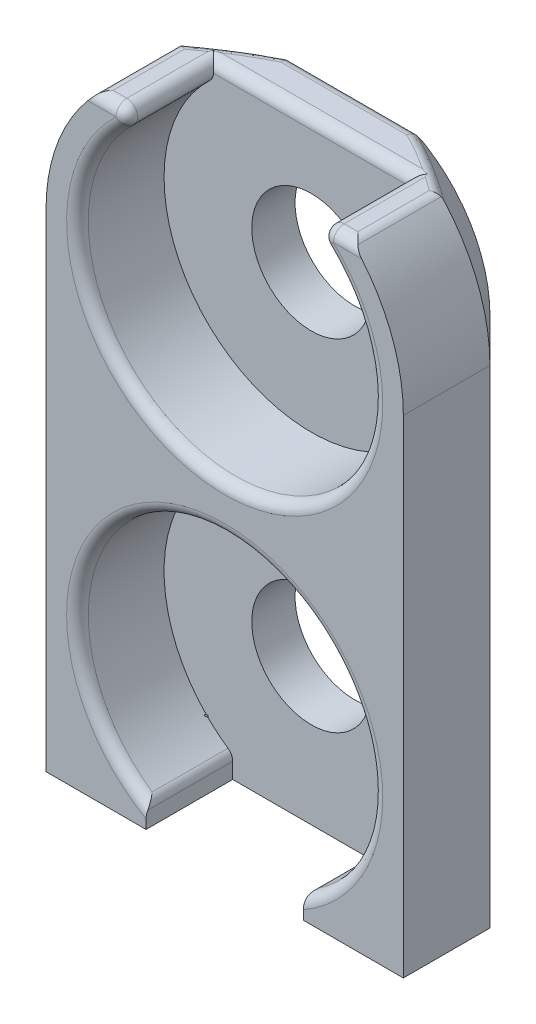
ISO-10303-21;
HEADER;
FILE_DESCRIPTION(('STEP AP214'),'2;1');
FILE_NAME('part.step','',(''),(''),'','','');
FILE_SCHEMA(('AUTOMOTIVE_DESIGN { 1 0 10303 214 1 1 1 1 }'));
ENDSEC;
DATA;
#1=APPLICATION_CONTEXT('core data for automotive mechanical design processes');
#2=APPLICATION_PROTOCOL_DEFINITION('international standard','automotive_design',2000,#1);
#3=PRODUCT_CONTEXT('',#1,'mechanical');
#4=PRODUCT('Part','Part','',(#3));
#5=PRODUCT_RELATED_PRODUCT_CATEGORY('part','',(#4));
#6=PRODUCT_DEFINITION_FORMATION('','',#4);
#7=PRODUCT_DEFINITION_CONTEXT('part definition',#1,'design');
#8=PRODUCT_DEFINITION('design','',#6,#7);
#9=PRODUCT_DEFINITION_SHAPE('','',#8);
#10=(LENGTH_UNIT() NAMED_UNIT(*) SI_UNIT(.MILLI.,.METRE.));
#11=(NAMED_UNIT(*) PLANE_ANGLE_UNIT() SI_UNIT($,.RADIAN.));
#12=(NAMED_UNIT(*) SI_UNIT($,.STERADIAN.) SOLID_ANGLE_UNIT());
#13=UNCERTAINTY_MEASURE_WITH_UNIT(LENGTH_MEASURE(1.E-05),#10,'distance_accuracy_value','');
#14=(GEOMETRIC_REPRESENTATION_CONTEXT(3) GLOBAL_UNCERTAINTY_ASSIGNED_CONTEXT((#13)) GLOBAL_UNIT_ASSIGNED_CONTEXT((#10,
#11,#12)) REPRESENTATION_CONTEXT('',''));
#15=CARTESIAN_POINT('',(0.,0.,0.));
#16=DIRECTION('',(0.,0.,1.));
#17=DIRECTION('',(1.,0.,0.));
#18=AXIS2_PLACEMENT_3D('',#15,#16,#17);
#19=CARTESIAN_POINT('',(-11.7341382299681,56.6,0.));
#20=DIRECTION('',(0.,-1.,0.));
#21=DIRECTION('',(0.,0.,-1.));
#22=AXIS2_PLACEMENT_3D('',#19,#20,#21);
#23=PLANE('',#22);
#24=DIRECTION('',(0.,0.,-1.));
#25=VECTOR('',#24,1.);
#26=CARTESIAN_POINT('',(11.3088460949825,56.6,0.));
#27=LINE('',#26,#25);
#28=CARTESIAN_POINT('',(11.3088460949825,56.6,11.));
#29=VERTEX_POINT('',#28);
#30=CARTESIAN_POINT('',(11.3088460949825,56.6,4.41421356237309));
#31=VERTEX_POINT('',#30);
#32=EDGE_CURVE('E470',#29,#31,#27,.T.);
#33=ORIENTED_EDGE('',*,*,#32,.T.);
#34=CARTESIAN_POINT('',(21.049014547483,55.9257626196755,11.2156762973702));
#35=CARTESIAN_POINT('',(20.8948030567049,56.6,11.3894245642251));
#36=CARTESIAN_POINT('',(20.4214169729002,56.6,11.9227830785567));
#37=CARTESIAN_POINT('',(20.5512717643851,55.9319789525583,10.7768533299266));
#38=CARTESIAN_POINT('',(20.3967591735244,56.6,10.9540993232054));
#39=CARTESIAN_POINT('',(19.9269088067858,56.6,11.4839601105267));
#40=CARTESIAN_POINT('',(20.0516468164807,55.9385189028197,10.3398272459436));
#41=CARTESIAN_POINT('',(19.8958873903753,56.6,10.5197800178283));
#42=CARTESIAN_POINT('',(19.4307884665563,56.6,11.0469340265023));
#43=CARTESIAN_POINT('',(19.0475235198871,55.9523586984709,9.47039081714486));
#44=CARTESIAN_POINT('',(18.8890521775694,56.6,9.6557566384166));
#45=CARTESIAN_POINT('',(18.4344093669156,56.6,10.1774975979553));
#46=CARTESIAN_POINT('',(18.5430245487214,55.9596586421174,9.03798107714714));
#47=CARTESIAN_POINT('',(18.3833760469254,56.6,9.22625429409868));
#48=CARTESIAN_POINT('',(17.9341500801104,56.6,9.74508785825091));
#49=CARTESIAN_POINT('',(17.5260543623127,55.9751618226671,8.17712051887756));
#50=CARTESIAN_POINT('',(17.363928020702,56.6,8.37125656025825));
#51=CARTESIAN_POINT('',(16.9266081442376,56.6,8.88422730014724));
#52=CARTESIAN_POINT('',(17.013558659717,55.9833687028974,7.74869376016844));
#53=CARTESIAN_POINT('',(16.8504542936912,56.6,7.94599503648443));
#54=CARTESIAN_POINT('',(16.4193048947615,56.6,8.45580054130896));
#55=CARTESIAN_POINT('',(15.9812213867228,56.0007905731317,6.89924148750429));
#56=CARTESIAN_POINT('',(15.8160877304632,56.6,7.10289174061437));
#57=CARTESIAN_POINT('',(15.3985748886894,56.6,7.60634826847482));
#58=CARTESIAN_POINT('',(15.4613802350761,56.0100055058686,6.47821555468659));
#59=CARTESIAN_POINT('',(15.2955841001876,56.6,6.68528271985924));
#60=CARTESIAN_POINT('',(14.8851484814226,56.6,7.18532233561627));
#61=CARTESIAN_POINT('',(14.4242798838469,56.0293574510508,5.65514076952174));
#62=CARTESIAN_POINT('',(14.257148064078,56.6,5.86892095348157));
#63=CARTESIAN_POINT('',(13.8623245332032,56.6,6.36224755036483));
#64=CARTESIAN_POINT('',(13.9072294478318,56.0394688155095,5.25287808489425));
#65=CARTESIAN_POINT('',(13.7399260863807,56.6,5.47024051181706));
#66=CARTESIAN_POINT('',(13.3530996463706,56.6,5.95998486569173));
#67=CARTESIAN_POINT('',(12.8618465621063,56.0608974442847,4.46037038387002));
#68=CARTESIAN_POINT('',(12.6944645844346,56.6,4.68492603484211));
#69=CARTESIAN_POINT('',(12.3254074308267,56.6,5.16747716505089));
#70=CARTESIAN_POINT('',(12.3335148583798,56.0722146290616,4.07012457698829));
#71=CARTESIAN_POINT('',(12.1666964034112,56.6,4.29849571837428));
#72=CARTESIAN_POINT('',(11.806940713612,56.6,4.77723135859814));
#73=CARTESIAN_POINT('',(11.2629602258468,56.0961076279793,3.30622711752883));
#74=CARTESIAN_POINT('',(11.0978452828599,56.6,3.5422425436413));
#75=CARTESIAN_POINT('',(10.7588297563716,56.6,4.01333389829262));
#76=CARTESIAN_POINT('',(10.7207559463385,56.1086818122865,2.93255486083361));
#77=CARTESIAN_POINT('',(10.5572995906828,56.6,3.17255925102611));
#78=CARTESIAN_POINT('',(10.2292006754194,56.6,3.63966164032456));
#79=CARTESIAN_POINT('',(9.89343326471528,56.1284337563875,2.38889294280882));
#80=CARTESIAN_POINT('',(9.73152173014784,56.6,2.63376183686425));
#81=CARTESIAN_POINT('',(9.42348481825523,56.6,3.09599972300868));
#82=CARTESIAN_POINT('',(9.61535839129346,56.1351652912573,2.21050115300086));
#83=CARTESIAN_POINT('',(9.45479474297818,56.6,2.45739663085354));
#84=CARTESIAN_POINT('',(9.15306843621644,56.6,2.91760793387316));
#85=CARTESIAN_POINT('',(9.0538508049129,56.1488874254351,1.86041863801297));
#86=CARTESIAN_POINT('',(8.89642147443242,56.6,2.11139273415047));
#87=CARTESIAN_POINT('',(8.60793940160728,56.6,2.56752541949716));
#88=CARTESIAN_POINT('',(8.77041827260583,56.1558780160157,1.68872768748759));
#89=CARTESIAN_POINT('',(8.61483570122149,56.6,1.94174791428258));
#90=CARTESIAN_POINT('',(8.33322689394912,56.6,2.39583446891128));
#91=CARTESIAN_POINT('',(8.07616059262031,56.1730640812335,1.28231228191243));
#92=CARTESIAN_POINT('',(7.92636434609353,56.6,1.54068493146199));
#93=CARTESIAN_POINT('',(7.66158032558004,56.6,1.98941906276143));
#94=CARTESIAN_POINT('',(7.66220768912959,56.1833633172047,1.05167807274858));
#95=CARTESIAN_POINT('',(7.51609457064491,56.6,1.31292660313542));
#96=CARTESIAN_POINT('',(7.26214471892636,56.6,1.75878485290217));
#97=CARTESIAN_POINT('',(6.82014429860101,56.2040558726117,0.611687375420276));
#98=CARTESIAN_POINT('',(6.68280547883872,56.6,0.878689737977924));
#99=CARTESIAN_POINT('',(6.45206947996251,56.6,1.31879415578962));
#100=CARTESIAN_POINT('',(6.3920458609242,56.2144491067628,0.402313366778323));
#101=CARTESIAN_POINT('',(6.25988374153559,56.6,0.672059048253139));
#102=CARTESIAN_POINT('',(6.04143943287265,56.6,1.1094201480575));
#103=CARTESIAN_POINT('',(5.51592972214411,56.2348852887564,0.00974066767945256));
#104=CARTESIAN_POINT('',(5.39600959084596,56.6,0.284962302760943));
#105=CARTESIAN_POINT('',(5.20384196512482,56.6,0.716847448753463));
#106=CARTESIAN_POINT('',(5.06778721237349,56.2449250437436,-0.173251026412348));
#107=CARTESIAN_POINT('',(4.95487940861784,56.6,0.104455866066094));
#108=CARTESIAN_POINT('',(4.77677549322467,56.6,0.53385575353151));
#109=CARTESIAN_POINT('',(4.38161365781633,56.2590358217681,-0.420314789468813));
#110=CARTESIAN_POINT('',(4.27999730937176,56.6,-0.139302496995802));
#111=CARTESIAN_POINT('',(4.12504863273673,56.6,0.28679199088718));
#112=CARTESIAN_POINT('',(4.15019944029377,56.2635874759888,-0.498196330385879));
#113=CARTESIAN_POINT('',(4.0529084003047,56.6,-0.216043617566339));
#114=CARTESIAN_POINT('',(3.90560915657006,56.6,0.20891045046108));
#115=CARTESIAN_POINT('',(3.68287729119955,56.2722332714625,-0.643465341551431));
#116=CARTESIAN_POINT('',(3.59483059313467,56.6,-0.359114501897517));
#117=CARTESIAN_POINT('',(3.46315848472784,56.6,0.0636414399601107));
#118=CARTESIAN_POINT('',(3.44696693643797,56.2763271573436,-0.710846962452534));
#119=CARTESIAN_POINT('',(3.36378368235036,56.6,-0.425486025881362));
#120=CARTESIAN_POINT('',(3.24014537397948,56.6,-0.00374018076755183));
#121=CARTESIAN_POINT('',(3.20891385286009,56.28012228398,-0.772328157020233));
#122=CARTESIAN_POINT('',(3.13059300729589,56.6,-0.48608763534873));
#123=CARTESIAN_POINT('',(3.01543600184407,56.6,-0.0652213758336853));
#124=(BOUNDED_SURFACE() B_SPLINE_SURFACE(3,2,((#34,#35,#36),(#37,#38,#39),(#40,#41,#42),(#43,
#44,#45),(#46,#47,#48),(#49,#50,#51),(#52,#53,#54),(#55,#56,#57),(#58,#59,#60),(#61,#62,#63),
(#64,#65,#66),(#67,#68,#69),(#70,#71,#72),(#73,#74,#75),(#76,#77,#78),(#79,#80,#81),(#82,#83,
#84),(#85,#86,#87),(#88,#89,#90),(#91,#92,#93),(#94,#95,#96),(#97,#98,#99),(#100,#101,#102),
(#103,#104,#105),(#106,#107,#108),(#109,#110,#111),(#112,#113,#114),(#115,#116,#117),(#118,#119,
#120),(#121,#122,#123)),.UNSPECIFIED.,.F.,.F.,.F.) B_SPLINE_SURFACE_WITH_KNOTS((4,2,2,2,2,2,2,2,
2,2,2,2,2,2,4),(3,3),(0.,1.9834303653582,3.967117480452,5.9590848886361,7.95093919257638,
9.89762534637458,11.8441831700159,13.7882490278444,14.7600406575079,15.7317995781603,
17.1150013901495,18.4970538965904,19.8894201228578,20.5877331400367,21.2864337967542),(0.,1.),
.UNSPECIFIED.) GEOMETRIC_REPRESENTATION_ITEM() RATIONAL_B_SPLINE_SURFACE(((1.,0.814175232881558,
1.),(1.,0.816083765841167,1.),(1.,0.818085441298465,1.),(1.,0.822304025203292,1.),(1.,
0.824520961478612,1.),(1.,0.829208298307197,1.),(1.,0.831679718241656,1.),(1.,0.836900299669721,
1.),(1.,0.839649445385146,1.),(1.,0.845391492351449,1.),(1.,0.848377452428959,1.),(1.,
0.854668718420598,1.),(1.,0.857974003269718,1.),(1.,0.864907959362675,1.),(1.,0.868536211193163,
1.),(1.,0.874197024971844,1.),(1.,0.876120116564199,1.),(1.,0.880027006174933,1.),(1.,
0.882010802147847,1.),(1.,0.886870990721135,1.),(1.,0.889769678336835,1.),(1.,0.895564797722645,
1.),(1.,0.898461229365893,1.),(1.,0.904129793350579,1.),(1.,0.906900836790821,1.),(1.,
0.910779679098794,1.),(1.,0.912028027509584,1.),(1.,0.914394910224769,1.),(1.,0.915513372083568,
1.),(1.,0.916548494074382,1.))) REPRESENTATION_ITEM('') SURFACE());
#125=CARTESIAN_POINT('',(20.4214169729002,56.6,11.9227830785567));
#126=CARTESIAN_POINT('',(19.9269088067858,56.6,11.4839601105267));
#127=CARTESIAN_POINT('',(19.4307884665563,56.6,11.0469340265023));
#128=CARTESIAN_POINT('',(18.4344093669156,56.6,10.1774975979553));
#129=CARTESIAN_POINT('',(17.9341500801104,56.6,9.74508785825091));
#130=CARTESIAN_POINT('',(16.9266081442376,56.6,8.88422730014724));
#131=CARTESIAN_POINT('',(16.4193048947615,56.6,8.45580054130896));
#132=CARTESIAN_POINT('',(15.3985748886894,56.6,7.60634826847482));
#133=CARTESIAN_POINT('',(14.8851484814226,56.6,7.18532233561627));
#134=CARTESIAN_POINT('',(13.8623245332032,56.6,6.36224755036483));
#135=CARTESIAN_POINT('',(13.3530996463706,56.6,5.95998486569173));
#136=CARTESIAN_POINT('',(12.3254074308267,56.6,5.16747716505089));
#137=CARTESIAN_POINT('',(11.806940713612,56.6,4.77723135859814));
#138=CARTESIAN_POINT('',(10.7588297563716,56.6,4.01333389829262));
#139=CARTESIAN_POINT('',(10.2292006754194,56.6,3.63966164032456));
#140=CARTESIAN_POINT('',(9.42348481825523,56.6,3.09599972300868));
#141=CARTESIAN_POINT('',(9.15306843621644,56.6,2.91760793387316));
#142=CARTESIAN_POINT('',(8.60793940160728,56.6,2.56752541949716));
#143=CARTESIAN_POINT('',(8.33322689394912,56.6,2.39583446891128));
#144=CARTESIAN_POINT('',(7.66158032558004,56.6,1.98941906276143));
#145=CARTESIAN_POINT('',(7.26214471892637,56.6,1.75878485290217));
#146=CARTESIAN_POINT('',(6.45206947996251,56.6,1.31879415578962));
#147=CARTESIAN_POINT('',(6.04143943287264,56.6,1.1094201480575));
#148=CARTESIAN_POINT('',(5.20384196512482,56.6,0.716847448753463));
#149=CARTESIAN_POINT('',(4.77677549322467,56.6,0.533855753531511));
#150=CARTESIAN_POINT('',(4.12504863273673,56.6,0.28679199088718));
#151=CARTESIAN_POINT('',(3.90560915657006,56.6,0.20891045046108));
#152=CARTESIAN_POINT('',(3.46315848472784,56.6,0.0636414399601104));
#153=CARTESIAN_POINT('',(3.24014537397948,56.6,-0.00374018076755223));
#154=CARTESIAN_POINT('',(3.01543600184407,56.6,-0.0652213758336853));
#155=B_SPLINE_CURVE_WITH_KNOTS('',3,(#125,#126,#127,#128,#129,#130,#131,#132,#133,#134,#135,
#136,#137,#138,#139,#140,#141,#142,#143,#144,#145,#146,#147,#148,#149,#150,#151,#152,#153,#154),
.UNSPECIFIED.,.F.,.F.,(4,2,2,2,2,2,2,2,2,2,2,2,2,2,4),(0.,1.9834303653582,3.967117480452,
5.9590848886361,7.95093919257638,9.89762534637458,11.8441831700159,13.7882490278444,
14.7600406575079,15.7317995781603,17.1150013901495,18.4970538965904,19.8894201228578,
20.5877331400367,21.2864337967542),.UNSPECIFIED.);
#156=CARTESIAN_POINT('',(10.0399203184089,56.6,3.51421356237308));
#157=VERTEX_POINT('',#156);
#158=EDGE_CURVE('E336',#31,#157,#155,.T.);
#159=ORIENTED_EDGE('',*,*,#158,.T.);
#160=DIRECTION('',(0.,0.,1.));
#161=VECTOR('',#160,1.);
#162=CARTESIAN_POINT('',(10.0399203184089,56.6,0.));
#163=LINE('',#162,#161);
#164=CARTESIAN_POINT('',(10.0399203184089,56.6,11.));
#165=VERTEX_POINT('',#164);
#166=EDGE_CURVE('E874',#157,#165,#163,.T.);
#167=ORIENTED_EDGE('',*,*,#166,.T.);
#168=DIRECTION('',(1.,0.,0.));
#169=VECTOR('',#168,1.);
#170=CARTESIAN_POINT('',(-11.7341382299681,56.6,11.));
#171=LINE('',#170,#169);
#172=EDGE_CURVE('E475',#165,#29,#171,.T.);
#173=ORIENTED_EDGE('',*,*,#172,.T.);
#174=EDGE_LOOP('',(#33,#159,#167,#173));
#175=FACE_BOUND('',#174,.T.);
#176=ADVANCED_FACE('F43',(#175),#23,.F.);
#177=DIRECTION('',(1.,0.,0.));
#178=VECTOR('',#177,1.);
#179=CARTESIAN_POINT('',(-11.7341382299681,56.6,11.));
#180=LINE('',#179,#178);
#181=CARTESIAN_POINT('',(-11.3088460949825,56.6,11.));
#182=VERTEX_POINT('',#181);
#183=CARTESIAN_POINT('',(-10.0399203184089,56.6,11.));
#184=VERTEX_POINT('',#183);
#185=EDGE_CURVE('E925',#182,#184,#180,.T.);
#186=ORIENTED_EDGE('',*,*,#185,.T.);
#187=DIRECTION('',(0.,0.,1.));
#188=VECTOR('',#187,1.);
#189=CARTESIAN_POINT('',(-10.0399203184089,56.6,0.));
#190=LINE('',#189,#188);
#191=CARTESIAN_POINT('',(-10.0399203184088,56.6,3.51421356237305));
#192=VERTEX_POINT('',#191);
#193=EDGE_CURVE('E919',#184,#192,#190,.F.);
#194=ORIENTED_EDGE('',*,*,#193,.T.);
#195=CARTESIAN_POINT('',(-20.4214169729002,56.6,11.9227830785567));
#196=CARTESIAN_POINT('',(-20.8948030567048,56.6,11.3894245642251));
#197=CARTESIAN_POINT('',(-21.049014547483,55.9257626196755,11.2156762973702));
#198=CARTESIAN_POINT('',(-19.9269088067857,56.6,11.4839601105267));
#199=CARTESIAN_POINT('',(-20.3967591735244,56.6,10.9540993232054));
#200=CARTESIAN_POINT('',(-20.5512717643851,55.9319789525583,10.7768533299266));
#201=CARTESIAN_POINT('',(-19.4307884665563,56.6,11.0469340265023));
#202=CARTESIAN_POINT('',(-19.8958873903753,56.6,10.5197800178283));
#203=CARTESIAN_POINT('',(-20.0516468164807,55.9385189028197,10.3398272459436));
#204=CARTESIAN_POINT('',(-18.4344093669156,56.6,10.1774975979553));
#205=CARTESIAN_POINT('',(-18.8890521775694,56.6,9.65575663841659));
#206=CARTESIAN_POINT('',(-19.0475235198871,55.9523586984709,9.47039081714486));
#207=CARTESIAN_POINT('',(-17.9341500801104,56.6,9.7450878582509));
#208=CARTESIAN_POINT('',(-18.3833760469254,56.6,9.22625429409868));
#209=CARTESIAN_POINT('',(-18.5430245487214,55.9596586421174,9.03798107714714));
#210=CARTESIAN_POINT('',(-16.9266081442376,56.6,8.88422730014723));
#211=CARTESIAN_POINT('',(-17.363928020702,56.6,8.37125656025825));
#212=CARTESIAN_POINT('',(-17.5260543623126,55.9751618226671,8.17712051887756));
#213=CARTESIAN_POINT('',(-16.4193048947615,56.6,8.45580054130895));
#214=CARTESIAN_POINT('',(-16.8504542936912,56.6,7.94599503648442));
#215=CARTESIAN_POINT('',(-17.013558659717,55.9833687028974,7.74869376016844));
#216=CARTESIAN_POINT('',(-15.3985748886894,56.6,7.60634826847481));
#217=CARTESIAN_POINT('',(-15.8160877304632,56.6,7.10289174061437));
#218=CARTESIAN_POINT('',(-15.9812213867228,56.0007905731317,6.89924148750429));
#219=CARTESIAN_POINT('',(-14.8851484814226,56.6,7.18532233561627));
#220=CARTESIAN_POINT('',(-15.2955841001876,56.6,6.68528271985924));
#221=CARTESIAN_POINT('',(-15.4613802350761,56.0100055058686,6.47821555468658));
#222=CARTESIAN_POINT('',(-13.8623245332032,56.6,6.36224755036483));
#223=CARTESIAN_POINT('',(-14.2571480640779,56.6,5.86892095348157));
#224=CARTESIAN_POINT('',(-14.4242798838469,56.0293574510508,5.65514076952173));
#225=CARTESIAN_POINT('',(-13.3530996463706,56.6,5.95998486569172));
#226=CARTESIAN_POINT('',(-13.7399260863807,56.6,5.47024051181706));
#227=CARTESIAN_POINT('',(-13.9072294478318,56.0394688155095,5.25287808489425));
#228=CARTESIAN_POINT('',(-12.3254074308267,56.6,5.16747716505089));
#229=CARTESIAN_POINT('',(-12.6944645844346,56.6,4.68492603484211));
#230=CARTESIAN_POINT('',(-12.8618465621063,56.0608974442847,4.46037038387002));
#231=CARTESIAN_POINT('',(-11.806940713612,56.6,4.77723135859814));
#232=CARTESIAN_POINT('',(-12.1666964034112,56.6,4.29849571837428));
#233=CARTESIAN_POINT('',(-12.3335148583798,56.0722146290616,4.07012457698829));
#234=CARTESIAN_POINT('',(-10.7588297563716,56.6,4.01333389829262));
#235=CARTESIAN_POINT('',(-11.0978452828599,56.6,3.5422425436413));
#236=CARTESIAN_POINT('',(-11.2629602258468,56.0961076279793,3.30622711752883));
#237=CARTESIAN_POINT('',(-10.2292006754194,56.6,3.63966164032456));
#238=CARTESIAN_POINT('',(-10.5572995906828,56.6,3.17255925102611));
#239=CARTESIAN_POINT('',(-10.7207559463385,56.1086818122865,2.93255486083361));
#240=CARTESIAN_POINT('',(-9.42348481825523,56.6,3.09599972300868));
#241=CARTESIAN_POINT('',(-9.73152173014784,56.6,2.63376183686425));
#242=CARTESIAN_POINT('',(-9.89343326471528,56.1284337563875,2.38889294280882));
#243=CARTESIAN_POINT('',(-9.15306843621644,56.6,2.91760793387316));
#244=CARTESIAN_POINT('',(-9.45479474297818,56.6,2.45739663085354));
#245=CARTESIAN_POINT('',(-9.61535839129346,56.1351652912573,2.21050115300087));
#246=CARTESIAN_POINT('',(-8.60793940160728,56.6,2.56752541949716));
#247=CARTESIAN_POINT('',(-8.89642147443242,56.6,2.11139273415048));
#248=CARTESIAN_POINT('',(-9.0538508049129,56.1488874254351,1.86041863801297));
#249=CARTESIAN_POINT('',(-8.33322689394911,56.6,2.39583446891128));
#250=CARTESIAN_POINT('',(-8.61483570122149,56.6,1.94174791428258));
#251=CARTESIAN_POINT('',(-8.77041827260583,56.1558780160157,1.68872768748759));
#252=CARTESIAN_POINT('',(-7.66158032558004,56.6,1.98941906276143));
#253=CARTESIAN_POINT('',(-7.92636434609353,56.6,1.54068493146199));
#254=CARTESIAN_POINT('',(-8.07616059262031,56.1730640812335,1.28231228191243));
#255=CARTESIAN_POINT('',(-7.26214471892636,56.6,1.75878485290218));
#256=CARTESIAN_POINT('',(-7.5160945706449,56.6,1.31292660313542));
#257=CARTESIAN_POINT('',(-7.66220768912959,56.1833633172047,1.05167807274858));
#258=CARTESIAN_POINT('',(-6.4520694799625,56.6,1.31879415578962));
#259=CARTESIAN_POINT('',(-6.68280547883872,56.6,0.878689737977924));
#260=CARTESIAN_POINT('',(-6.82014429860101,56.2040558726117,0.611687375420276));
#261=CARTESIAN_POINT('',(-6.04143943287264,56.6,1.1094201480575));
#262=CARTESIAN_POINT('',(-6.25988374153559,56.6,0.672059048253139));
#263=CARTESIAN_POINT('',(-6.39204586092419,56.2144491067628,0.402313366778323));
#264=CARTESIAN_POINT('',(-5.20384196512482,56.6,0.716847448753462));
#265=CARTESIAN_POINT('',(-5.39600959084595,56.6,0.284962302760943));
#266=CARTESIAN_POINT('',(-5.51592972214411,56.2348852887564,0.00974066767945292));
#267=CARTESIAN_POINT('',(-4.77677549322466,56.6,0.53385575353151));
#268=CARTESIAN_POINT('',(-4.95487940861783,56.6,0.104455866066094));
#269=CARTESIAN_POINT('',(-5.06778721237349,56.2449250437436,-0.173251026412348));
#270=CARTESIAN_POINT('',(-4.12504863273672,56.6,0.28679199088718));
#271=CARTESIAN_POINT('',(-4.27999730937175,56.6,-0.139302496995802));
#272=CARTESIAN_POINT('',(-4.38161365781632,56.2590358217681,-0.420314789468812));
#273=CARTESIAN_POINT('',(-3.90560915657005,56.6,0.20891045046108));
#274=CARTESIAN_POINT('',(-4.05290840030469,56.6,-0.216043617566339));
#275=CARTESIAN_POINT('',(-4.15019944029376,56.2635874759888,-0.498196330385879));
#276=CARTESIAN_POINT('',(-3.46315848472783,56.6,0.0636414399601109));
#277=CARTESIAN_POINT('',(-3.59483059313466,56.6,-0.359114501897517));
#278=CARTESIAN_POINT('',(-3.68287729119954,56.2722332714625,-0.643465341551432));
#279=CARTESIAN_POINT('',(-3.24014537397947,56.6,-0.00374018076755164));
#280=CARTESIAN_POINT('',(-3.36378368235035,56.6,-0.425486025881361));
#281=CARTESIAN_POINT('',(-3.44696693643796,56.2763271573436,-0.710846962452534));
#282=CARTESIAN_POINT('',(-3.01543600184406,56.6,-0.0652213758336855));
#283=CARTESIAN_POINT('',(-3.13059300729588,56.6,-0.48608763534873));
#284=CARTESIAN_POINT('',(-3.20891385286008,56.28012228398,-0.772328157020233));
#285=(BOUNDED_SURFACE() B_SPLINE_SURFACE(3,2,((#195,#196,#197),(#198,#199,#200),(#201,#202,
#203),(#204,#205,#206),(#207,#208,#209),(#210,#211,#212),(#213,#214,#215),(#216,#217,#218),
(#219,#220,#221),(#222,#223,#224),(#225,#226,#227),(#228,#229,#230),(#231,#232,#233),(#234,#235,
#236),(#237,#238,#239),(#240,#241,#242),(#243,#244,#245),(#246,#247,#248),(#249,#250,#251),
(#252,#253,#254),(#255,#256,#257),(#258,#259,#260),(#261,#262,#263),(#264,#265,#266),(#267,#268,
#269),(#270,#271,#272),(#273,#274,#275),(#276,#277,#278),(#279,#280,#281),(#282,#283,#284)),
.UNSPECIFIED.,.F.,.F.,.F.) B_SPLINE_SURFACE_WITH_KNOTS((4,2,2,2,2,2,2,2,2,2,2,2,2,2,4),(3,3),
(0.,1.9834303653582,3.96711748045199,5.9590848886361,7.95093919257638,9.89762534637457,
11.8441831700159,13.7882490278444,14.7600406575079,15.7317995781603,17.1150013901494,
18.4970538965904,19.8894201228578,20.5877331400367,21.2864337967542),(0.,1.),
.UNSPECIFIED.) GEOMETRIC_REPRESENTATION_ITEM() RATIONAL_B_SPLINE_SURFACE(((1.,0.814175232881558,
1.),(1.,0.816083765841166,1.),(1.,0.818085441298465,1.),(1.,0.822304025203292,1.),(1.,
0.824520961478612,1.),(1.,0.829208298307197,1.),(1.,0.831679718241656,1.),(1.,0.836900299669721,
1.),(1.,0.839649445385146,1.),(1.,0.845391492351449,1.),(1.,0.848377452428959,1.),(1.,
0.854668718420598,1.),(1.,0.857974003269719,1.),(1.,0.864907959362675,1.),(1.,0.868536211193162,
1.),(1.,0.874197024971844,1.),(1.,0.876120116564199,1.),(1.,0.880027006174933,1.),(1.,
0.882010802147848,1.),(1.,0.886870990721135,1.),(1.,0.889769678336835,1.),(1.,0.895564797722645,
1.),(1.,0.898461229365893,1.),(1.,0.90412979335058,1.),(1.,0.906900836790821,1.),(1.,
0.910779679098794,1.),(1.,0.912028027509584,1.),(1.,0.914394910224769,1.),(1.,0.915513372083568,
1.),(1.,0.916548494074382,1.))) REPRESENTATION_ITEM('') SURFACE());
#286=CARTESIAN_POINT('',(-3.01543600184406,56.6,-0.0652213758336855));
#287=CARTESIAN_POINT('',(-3.24014537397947,56.6,-0.00374018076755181));
#288=CARTESIAN_POINT('',(-3.46315848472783,56.6,0.0636414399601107));
#289=CARTESIAN_POINT('',(-3.90560915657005,56.6,0.20891045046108));
#290=CARTESIAN_POINT('',(-4.12504863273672,56.6,0.28679199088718));
#291=CARTESIAN_POINT('',(-4.77677549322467,56.6,0.53385575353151));
#292=CARTESIAN_POINT('',(-5.20384196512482,56.6,0.716847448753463));
#293=CARTESIAN_POINT('',(-6.04143943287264,56.6,1.1094201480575));
#294=CARTESIAN_POINT('',(-6.4520694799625,56.6,1.31879415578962));
#295=CARTESIAN_POINT('',(-7.26214471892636,56.6,1.75878485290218));
#296=CARTESIAN_POINT('',(-7.66158032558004,56.6,1.98941906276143));
#297=CARTESIAN_POINT('',(-8.33322689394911,56.6,2.39583446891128));
#298=CARTESIAN_POINT('',(-8.60793940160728,56.6,2.56752541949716));
#299=CARTESIAN_POINT('',(-9.15306843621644,56.6,2.91760793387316));
#300=CARTESIAN_POINT('',(-9.42348481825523,56.6,3.09599972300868));
#301=CARTESIAN_POINT('',(-10.2292006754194,56.6,3.63966164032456));
#302=CARTESIAN_POINT('',(-10.7588297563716,56.6,4.01333389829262));
#303=CARTESIAN_POINT('',(-11.806940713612,56.6,4.77723135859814));
#304=CARTESIAN_POINT('',(-12.3254074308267,56.6,5.16747716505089));
#305=CARTESIAN_POINT('',(-13.3530996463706,56.6,5.95998486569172));
#306=CARTESIAN_POINT('',(-13.8623245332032,56.6,6.36224755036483));
#307=CARTESIAN_POINT('',(-14.8851484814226,56.6,7.18532233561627));
#308=CARTESIAN_POINT('',(-15.3985748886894,56.6,7.60634826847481));
#309=CARTESIAN_POINT('',(-16.4193048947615,56.6,8.45580054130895));
#310=CARTESIAN_POINT('',(-16.9266081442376,56.6,8.88422730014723));
#311=CARTESIAN_POINT('',(-17.9341500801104,56.6,9.7450878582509));
#312=CARTESIAN_POINT('',(-18.4344093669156,56.6,10.1774975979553));
#313=CARTESIAN_POINT('',(-19.4307884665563,56.6,11.0469340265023));
#314=CARTESIAN_POINT('',(-19.9269088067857,56.6,11.4839601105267));
#315=CARTESIAN_POINT('',(-20.4214169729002,56.6,11.9227830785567));
#316=B_SPLINE_CURVE_WITH_KNOTS('',3,(#286,#287,#288,#289,#290,#291,#292,#293,#294,#295,#296,
#297,#298,#299,#300,#301,#302,#303,#304,#305,#306,#307,#308,#309,#310,#311,#312,#313,#314,#315),
.UNSPECIFIED.,.F.,.F.,(4,2,2,2,2,2,2,2,2,2,2,2,2,2,4),(0.,0.698700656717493,1.3970136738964,
2.78937990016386,4.17143240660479,5.55463421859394,6.52639313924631,7.49818476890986,
9.44225062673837,11.3888084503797,13.3354946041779,15.3273489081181,17.3193163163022,
19.303003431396,21.2864337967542),.UNSPECIFIED.);
#317=CARTESIAN_POINT('',(-11.3088460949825,56.6,4.41421356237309));
#318=VERTEX_POINT('',#317);
#319=EDGE_CURVE('E397',#192,#318,#316,.T.);
#320=ORIENTED_EDGE('',*,*,#319,.T.);
#321=DIRECTION('',(0.,0.,-1.));
#322=VECTOR('',#321,1.);
#323=CARTESIAN_POINT('',(-11.3088460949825,56.6,0.));
#324=LINE('',#323,#322);
#325=EDGE_CURVE('E916',#318,#182,#324,.F.);
#326=ORIENTED_EDGE('',*,*,#325,.T.);
#327=EDGE_LOOP('',(#186,#194,#320,#326));
#328=FACE_BOUND('',#327,.T.);
#329=ADVANCED_FACE('F329',(#328),#23,.F.);
#330=CARTESIAN_POINT('',(0.,45.,12.));
#331=DIRECTION('',(0.,0.,-1.));
#332=DIRECTION('',(-1.,0.,0.));
#333=AXIS2_PLACEMENT_3D('',#330,#331,#332);
#334=CYLINDRICAL_SURFACE('',#333,16.5);
#335=CARTESIAN_POINT('',(0.,45.,12.));
#336=DIRECTION('',(0.,0.,1.));
#337=DIRECTION('',(-1.,0.,0.));
#338=AXIS2_PLACEMENT_3D('',#335,#336,#337);
#339=CIRCLE('',#338,16.5);
#340=CARTESIAN_POINT('',(-12.6447617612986,55.6,12.));
#341=VERTEX_POINT('',#340);
#342=CARTESIAN_POINT('',(-16.5,45.,12.));
#343=VERTEX_POINT('',#342);
#344=EDGE_CURVE('E694',#341,#343,#339,.T.);
#345=ORIENTED_EDGE('',*,*,#344,.F.);
#346=CARTESIAN_POINT('',(-12.6447617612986,55.6,12.));
#347=CARTESIAN_POINT('',(-12.617282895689,55.6327807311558,11.9999949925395));
#348=CARTESIAN_POINT('',(-12.5896869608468,55.6654396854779,11.9983883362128));
#349=CARTESIAN_POINT('',(-12.5343960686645,55.7303648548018,11.9920037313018));
#350=CARTESIAN_POINT('',(-12.5067011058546,55.7626310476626,11.9872256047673));
#351=CARTESIAN_POINT('',(-12.424955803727,55.8571305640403,11.9684760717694));
#352=CARTESIAN_POINT('',(-12.3709606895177,55.9185953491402,11.9500829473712));
#353=CARTESIAN_POINT('',(-12.2694670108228,56.0324724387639,11.9035440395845));
#354=CARTESIAN_POINT('',(-12.2218308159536,56.0851953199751,11.8764626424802));
#355=CARTESIAN_POINT('',(-12.1518411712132,56.1617198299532,11.8278941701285));
#356=CARTESIAN_POINT('',(-12.1285238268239,56.1870477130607,11.8101555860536));
#357=CARTESIAN_POINT('',(-12.0827669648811,56.2364533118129,11.7719459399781));
#358=CARTESIAN_POINT('',(-12.0603282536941,56.2605298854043,11.7514724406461));
#359=CARTESIAN_POINT('',(-12.0384490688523,56.2838709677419,11.7296029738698));
#360=B_SPLINE_CURVE_WITH_KNOTS('',3,(#346,#347,#348,#349,#350,#351,#352,#353,#354,#355,#356,
#357,#358,#359),.UNSPECIFIED.,.F.,.F.,(4,2,2,2,2,2,4),(0.,0.128258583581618,0.256524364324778,
0.507119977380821,0.73444241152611,0.850512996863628,0.966687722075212),.UNSPECIFIED.);
#361=CARTESIAN_POINT('',(-12.0384490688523,56.2838709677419,11.7296029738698));
#362=VERTEX_POINT('',#361);
#363=EDGE_CURVE('E619',#341,#362,#360,.T.);
#364=ORIENTED_EDGE('',*,*,#363,.T.);
#365=DIRECTION('',(0.,0.,-1.));
#366=VECTOR('',#365,1.);
#367=CARTESIAN_POINT('',(-12.0384490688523,56.2838709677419,12.));
#368=LINE('',#367,#366);
#369=CARTESIAN_POINT('',(-12.0384490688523,56.2838709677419,4.04470110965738));
#370=VERTEX_POINT('',#369);
#371=EDGE_CURVE('E627',#362,#370,#368,.T.);
#372=ORIENTED_EDGE('',*,*,#371,.T.);
#373=CARTESIAN_POINT('',(-12.0384490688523,56.2838709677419,4.04470110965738));
#374=CARTESIAN_POINT('',(-12.0541012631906,56.267173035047,4.03679870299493));
#375=CARTESIAN_POINT('',(-12.0699743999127,56.2501678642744,4.03004658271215));
#376=CARTESIAN_POINT('',(-12.1018918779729,56.2158260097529,4.0187232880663));
#377=CARTESIAN_POINT('',(-12.1179343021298,56.1984923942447,4.01413749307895));
#378=CARTESIAN_POINT('',(-12.1501334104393,56.1635488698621,4.00692453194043));
#379=CARTESIAN_POINT('',(-12.1662900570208,56.1459390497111,4.00429674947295));
#380=CARTESIAN_POINT('',(-12.1987268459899,56.1104297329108,4.00082741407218));
#381=CARTESIAN_POINT('',(-12.2150070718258,56.0925290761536,3.99999830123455));
#382=CARTESIAN_POINT('',(-12.2312386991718,56.0746015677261,3.99999999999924));
#383=B_SPLINE_CURVE_WITH_KNOTS('',3,(#373,#374,#375,#376,#377,#378,#379,#380,#381,#382),
.UNSPECIFIED.,.F.,.F.,(4,2,2,2,4),(0.,0.0725786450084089,0.144660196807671,0.216719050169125,
0.289274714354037),.UNSPECIFIED.);
#384=CARTESIAN_POINT('',(-12.231238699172,56.0746015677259,3.99999999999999));
#385=VERTEX_POINT('',#384);
#386=EDGE_CURVE('E653',#370,#385,#383,.T.);
#387=ORIENTED_EDGE('',*,*,#386,.T.);
#388=CARTESIAN_POINT('',(0.,45.,3.99999999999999));
#389=DIRECTION('',(0.,0.,-1.));
#390=DIRECTION('',(-1.,0.,0.));
#391=AXIS2_PLACEMENT_3D('',#388,#389,#390);
#392=CIRCLE('',#391,16.5);
#393=CARTESIAN_POINT('',(-16.5,45.,3.99999999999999));
#394=VERTEX_POINT('',#393);
#395=EDGE_CURVE('E838',#385,#394,#392,.F.);
#396=ORIENTED_EDGE('',*,*,#395,.T.);
#397=DIRECTION('',(0.,0.,-1.));
#398=VECTOR('',#397,1.);
#399=CARTESIAN_POINT('',(-16.5,45.,12.));
#400=LINE('',#399,#398);
#401=EDGE_CURVE('E984',#343,#394,#400,.T.);
#402=ORIENTED_EDGE('',*,*,#401,.F.);
#403=EDGE_LOOP('',(#345,#364,#372,#387,#396,#402));
#404=FACE_BOUND('',#403,.T.);
#405=ADVANCED_FACE('F466',(#404),#334,.T.);
#406=CARTESIAN_POINT('',(0.,45.,12.));
#407=DIRECTION('',(0.,0.,-1.));
#408=DIRECTION('',(-1.,0.,0.));
#409=AXIS2_PLACEMENT_3D('',#406,#407,#408);
#410=CYLINDRICAL_SURFACE('',#409,5.5);
#411=CARTESIAN_POINT('',(0.,45.,0.));
#412=DIRECTION('',(0.,0.,1.));
#413=DIRECTION('',(1.,0.,0.));
#414=AXIS2_PLACEMENT_3D('',#411,#412,#413);
#415=CIRCLE('',#414,5.5);
#416=CARTESIAN_POINT('',(5.5,45.,0.));
#417=VERTEX_POINT('',#416);
#418=EDGE_CURVE('E1000',#417,#417,#415,.T.);
#419=ORIENTED_EDGE('',*,*,#418,.F.);
#420=EDGE_LOOP('',(#419));
#421=FACE_BOUND('',#420,.T.);
#422=CARTESIAN_POINT('',(0.,45.,4.));
#423=DIRECTION('',(0.,0.,1.));
#424=DIRECTION('',(1.,0.,0.));
#425=AXIS2_PLACEMENT_3D('',#422,#423,#424);
#426=CIRCLE('',#425,5.5);
#427=CARTESIAN_POINT('',(5.5,45.,4.));
#428=VERTEX_POINT('',#427);
#429=EDGE_CURVE('E794',#428,#428,#426,.T.);
#430=ORIENTED_EDGE('',*,*,#429,.T.);
#431=EDGE_LOOP('',(#430));
#432=FACE_BOUND('',#431,.T.);
#433=ADVANCED_FACE('F1220',(#421,#432),#410,.F.);
#434=CARTESIAN_POINT('',(0.,13.5,12.));
#435=DIRECTION('',(0.,0.,-1.));
#436=DIRECTION('',(-1.,0.,0.));
#437=AXIS2_PLACEMENT_3D('',#434,#435,#436);
#438=CYLINDRICAL_SURFACE('',#437,5.5);
#439=CARTESIAN_POINT('',(0.,13.5,0.));
#440=DIRECTION('',(0.,0.,1.));
#441=DIRECTION('',(1.,0.,0.));
#442=AXIS2_PLACEMENT_3D('',#439,#440,#441);
#443=CIRCLE('',#442,5.5);
#444=CARTESIAN_POINT('',(5.5,13.5,0.));
#445=VERTEX_POINT('',#444);
#446=EDGE_CURVE('E806',#445,#445,#443,.T.);
#447=ORIENTED_EDGE('',*,*,#446,.F.);
#448=EDGE_LOOP('',(#447));
#449=FACE_BOUND('',#448,.T.);
#450=CARTESIAN_POINT('',(0.,13.5,4.));
#451=DIRECTION('',(0.,0.,1.));
#452=DIRECTION('',(1.,0.,0.));
#453=AXIS2_PLACEMENT_3D('',#450,#451,#452);
#454=CIRCLE('',#453,5.5);
#455=CARTESIAN_POINT('',(5.5,13.5,4.));
#456=VERTEX_POINT('',#455);
#457=EDGE_CURVE('E785',#456,#456,#454,.T.);
#458=ORIENTED_EDGE('',*,*,#457,.T.);
#459=EDGE_LOOP('',(#458));
#460=FACE_BOUND('',#459,.T.);
#461=ADVANCED_FACE('F1314',(#449,#460),#438,.F.);
#462=CARTESIAN_POINT('',(0.,45.,12.));
#463=DIRECTION('',(0.,0.,-1.));
#464=DIRECTION('',(-1.,0.,0.));
#465=AXIS2_PLACEMENT_3D('',#462,#463,#464);
#466=PLANE('',#465);
#467=DIRECTION('',(1.,0.,0.));
#468=VECTOR('',#467,1.);
#469=CARTESIAN_POINT('',(0.,55.6,12.));
#470=LINE('',#469,#468);
#471=CARTESIAN_POINT('',(12.6447617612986,55.6,12.));
#472=VERTEX_POINT('',#471);
#473=CARTESIAN_POINT('',(10.0399203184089,55.6,12.));
#474=VERTEX_POINT('',#473);
#475=EDGE_CURVE('E670',#472,#474,#470,.F.);
#476=ORIENTED_EDGE('',*,*,#475,.T.);
#477=CARTESIAN_POINT('',(0.,45.,12.));
#478=DIRECTION('',(0.,0.,-1.));
#479=DIRECTION('',(-1.,0.,0.));
#480=AXIS2_PLACEMENT_3D('',#477,#478,#479);
#481=CIRCLE('',#480,14.6);
#482=CARTESIAN_POINT('',(-10.0399203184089,55.6,12.));
#483=VERTEX_POINT('',#482);
#484=EDGE_CURVE('E714',#474,#483,#481,.T.);
#485=ORIENTED_EDGE('',*,*,#484,.T.);
#486=DIRECTION('',(1.,0.,0.));
#487=VECTOR('',#486,1.);
#488=CARTESIAN_POINT('',(0.,55.6,12.));
#489=LINE('',#488,#487);
#490=EDGE_CURVE('E673',#483,#341,#489,.F.);
#491=ORIENTED_EDGE('',*,*,#490,.T.);
#492=ORIENTED_EDGE('',*,*,#344,.T.);
#493=DIRECTION('',(0.,-1.,0.));
#494=VECTOR('',#493,1.);
#495=CARTESIAN_POINT('',(-16.5,0.,12.));
#496=LINE('',#495,#494);
#497=CARTESIAN_POINT('',(-16.5,0.,12.));
#498=VERTEX_POINT('',#497);
#499=EDGE_CURVE('E693',#343,#498,#496,.T.);
#500=ORIENTED_EDGE('',*,*,#499,.T.);
#501=DIRECTION('',(1.,0.,0.));
#502=VECTOR('',#501,1.);
#503=CARTESIAN_POINT('',(-16.5,0.,12.));
#504=LINE('',#503,#502);
#505=CARTESIAN_POINT('',(-7.26016528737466,0.,12.));
#506=VERTEX_POINT('',#505);
#507=EDGE_CURVE('E988',#498,#506,#504,.T.);
#508=ORIENTED_EDGE('',*,*,#507,.T.);
#509=DIRECTION('',(0.,-1.,0.));
#510=VECTOR('',#509,1.);
#511=CARTESIAN_POINT('',(-7.26016528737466,0.,12.));
#512=LINE('',#511,#510);
#513=CARTESIAN_POINT('',(-7.26016528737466,0.833114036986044,12.));
#514=VERTEX_POINT('',#513);
#515=EDGE_CURVE('E1070',#514,#506,#512,.T.);
#516=ORIENTED_EDGE('',*,*,#515,.F.);
#517=CARTESIAN_POINT('',(0.,13.5,12.));
#518=DIRECTION('',(0.,0.,-1.));
#519=DIRECTION('',(-1.,0.,0.));
#520=AXIS2_PLACEMENT_3D('',#517,#518,#519);
#521=CIRCLE('',#520,14.6);
#522=CARTESIAN_POINT('',(7.26016528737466,0.833114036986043,12.));
#523=VERTEX_POINT('',#522);
#524=EDGE_CURVE('E706',#514,#523,#521,.T.);
#525=ORIENTED_EDGE('',*,*,#524,.T.);
#526=DIRECTION('',(0.,1.,0.));
#527=VECTOR('',#526,1.);
#528=CARTESIAN_POINT('',(7.26016528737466,0.,12.));
#529=LINE('',#528,#527);
#530=CARTESIAN_POINT('',(7.26016528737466,0.,12.));
#531=VERTEX_POINT('',#530);
#532=EDGE_CURVE('E1061',#531,#523,#529,.T.);
#533=ORIENTED_EDGE('',*,*,#532,.F.);
#534=CARTESIAN_POINT('',(16.5,0.,12.));
#535=VERTEX_POINT('',#534);
#536=EDGE_CURVE('E999',#531,#535,#504,.T.);
#537=ORIENTED_EDGE('',*,*,#536,.T.);
#538=DIRECTION('',(0.,1.,0.));
#539=VECTOR('',#538,1.);
#540=CARTESIAN_POINT('',(16.5,45.,12.));
#541=LINE('',#540,#539);
#542=CARTESIAN_POINT('',(16.5,45.,12.));
#543=VERTEX_POINT('',#542);
#544=EDGE_CURVE('E690',#535,#543,#541,.T.);
#545=ORIENTED_EDGE('',*,*,#544,.T.);
#546=EDGE_CURVE('E685',#543,#472,#339,.T.);
#547=ORIENTED_EDGE('',*,*,#546,.T.);
#548=EDGE_LOOP('',(#476,#485,#491,#492,#500,#508,#516,#525,#533,#537,#545,#547));
#549=FACE_BOUND('',#548,.T.);
#550=ADVANCED_FACE('F687',(#549),#466,.F.);
#551=CARTESIAN_POINT('',(0.,45.,0.));
#552=DIRECTION('',(0.,0.,-1.));
#553=DIRECTION('',(-1.,0.,0.));
#554=AXIS2_PLACEMENT_3D('',#551,#552,#553);
#555=PLANE('',#554);
#556=CARTESIAN_POINT('',(0.,45.,0.));
#557=DIRECTION('',(0.,0.,-1.));
#558=DIRECTION('',(-1.,0.,0.));
#559=AXIS2_PLACEMENT_3D('',#556,#557,#558);
#560=CIRCLE('',#559,12.5);
#561=CARTESIAN_POINT('',(-12.5,45.,0.));
#562=VERTEX_POINT('',#561);
#563=CARTESIAN_POINT('',(-6.62495283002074,55.6,0.));
#564=VERTEX_POINT('',#563);
#565=EDGE_CURVE('E831',#562,#564,#560,.T.);
#566=ORIENTED_EDGE('',*,*,#565,.T.);
#567=DIRECTION('',(1.,0.,0.));
#568=VECTOR('',#567,1.);
#569=CARTESIAN_POINT('',(4.657252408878,55.6,0.));
#570=LINE('',#569,#568);
#571=CARTESIAN_POINT('',(6.62495283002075,55.6,0.));
#572=VERTEX_POINT('',#571);
#573=EDGE_CURVE('E948',#564,#572,#570,.T.);
#574=ORIENTED_EDGE('',*,*,#573,.T.);
#575=CARTESIAN_POINT('',(0.,45.,0.));
#576=DIRECTION('',(0.,0.,-1.));
#577=DIRECTION('',(-1.,0.,0.));
#578=AXIS2_PLACEMENT_3D('',#575,#576,#577);
#579=CIRCLE('',#578,12.5);
#580=CARTESIAN_POINT('',(12.5,45.,0.));
#581=VERTEX_POINT('',#580);
#582=EDGE_CURVE('E501',#572,#581,#579,.T.);
#583=ORIENTED_EDGE('',*,*,#582,.T.);
#584=DIRECTION('',(0.,-1.,0.));
#585=VECTOR('',#584,1.);
#586=CARTESIAN_POINT('',(12.5,0.,0.));
#587=LINE('',#586,#585);
#588=CARTESIAN_POINT('',(12.5,0.,0.));
#589=VERTEX_POINT('',#588);
#590=EDGE_CURVE('E826',#581,#589,#587,.T.);
#591=ORIENTED_EDGE('',*,*,#590,.T.);
#592=DIRECTION('',(1.,0.,0.));
#593=VECTOR('',#592,1.);
#594=CARTESIAN_POINT('',(-16.5,0.,0.));
#595=LINE('',#594,#593);
#596=CARTESIAN_POINT('',(-12.5,0.,0.));
#597=VERTEX_POINT('',#596);
#598=EDGE_CURVE('E995',#597,#589,#595,.T.);
#599=ORIENTED_EDGE('',*,*,#598,.F.);
#600=DIRECTION('',(0.,1.,0.));
#601=VECTOR('',#600,1.);
#602=CARTESIAN_POINT('',(-12.5,45.,0.));
#603=LINE('',#602,#601);
#604=EDGE_CURVE('E835',#597,#562,#603,.T.);
#605=ORIENTED_EDGE('',*,*,#604,.T.);
#606=EDGE_LOOP('',(#566,#574,#583,#591,#599,#605));
#607=FACE_BOUND('',#606,.T.);
#608=ORIENTED_EDGE('',*,*,#418,.T.);
#609=EDGE_LOOP('',(#608));
#610=FACE_BOUND('',#609,.T.);
#611=ORIENTED_EDGE('',*,*,#446,.T.);
#612=EDGE_LOOP('',(#611));
#613=FACE_BOUND('',#612,.T.);
#614=ADVANCED_FACE('F1018',(#607,#610,#613),#555,.T.);
#615=CARTESIAN_POINT('',(-16.5,0.,12.));
#616=DIRECTION('',(0.,1.,0.));
#617=DIRECTION('',(0.,0.,1.));
#618=AXIS2_PLACEMENT_3D('',#615,#616,#617);
#619=PLANE('',#618);
#620=CARTESIAN_POINT('',(-11.,0.,3.));
#621=DIRECTION('',(0.,-1.,0.));
#622=DIRECTION('',(0.,0.,-1.));
#623=AXIS2_PLACEMENT_3D('',#620,#621,#622);
#624=CIRCLE('',#623,1.75);
#625=CARTESIAN_POINT('',(-11.,0.,1.25));
#626=VERTEX_POINT('',#625);
#627=EDGE_CURVE('E851',#626,#626,#624,.T.);
#628=ORIENTED_EDGE('',*,*,#627,.F.);
#629=EDGE_LOOP('',(#628));
#630=FACE_BOUND('',#629,.T.);
#631=CARTESIAN_POINT('',(-14.,0.,9.));
#632=DIRECTION('',(0.,-1.,0.));
#633=DIRECTION('',(0.,0.,-1.));
#634=AXIS2_PLACEMENT_3D('',#631,#632,#633);
#635=CIRCLE('',#634,1.75);
#636=CARTESIAN_POINT('',(-14.,0.,7.25));
#637=VERTEX_POINT('',#636);
#638=EDGE_CURVE('E1123',#637,#637,#635,.T.);
#639=ORIENTED_EDGE('',*,*,#638,.F.);
#640=EDGE_LOOP('',(#639));
#641=FACE_BOUND('',#640,.T.);
#642=CARTESIAN_POINT('',(14.,0.,9.));
#643=DIRECTION('',(0.,-1.,0.));
#644=DIRECTION('',(0.,0.,-1.));
#645=AXIS2_PLACEMENT_3D('',#642,#643,#644);
#646=CIRCLE('',#645,1.75);
#647=CARTESIAN_POINT('',(14.,0.,7.25));
#648=VERTEX_POINT('',#647);
#649=EDGE_CURVE('E1135',#648,#648,#646,.T.);
#650=ORIENTED_EDGE('',*,*,#649,.F.);
#651=EDGE_LOOP('',(#650));
#652=FACE_BOUND('',#651,.T.);
#653=CARTESIAN_POINT('',(11.,0.,3.));
#654=DIRECTION('',(0.,-1.,0.));
#655=DIRECTION('',(0.,0.,-1.));
#656=AXIS2_PLACEMENT_3D('',#653,#654,#655);
#657=CIRCLE('',#656,1.75);
#658=CARTESIAN_POINT('',(11.,0.,1.25));
#659=VERTEX_POINT('',#658);
#660=EDGE_CURVE('E296',#659,#659,#657,.T.);
#661=ORIENTED_EDGE('',*,*,#660,.F.);
#662=EDGE_LOOP('',(#661));
#663=FACE_BOUND('',#662,.T.);
#664=DIRECTION('',(0.,0.,-1.));
#665=VECTOR('',#664,1.);
#666=CARTESIAN_POINT('',(-16.5,0.,12.));
#667=LINE('',#666,#665);
#668=CARTESIAN_POINT('',(-16.5,0.,3.99999999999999));
#669=VERTEX_POINT('',#668);
#670=EDGE_CURVE('E994',#498,#669,#667,.T.);
#671=ORIENTED_EDGE('',*,*,#670,.T.);
#672=DIRECTION('',(0.707106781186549,0.,-0.707106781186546));
#673=VECTOR('',#672,1.);
#674=CARTESIAN_POINT('',(-16.5,0.,3.99999999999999));
#675=LINE('',#674,#673);
#676=EDGE_CURVE('E823',#669,#597,#675,.T.);
#677=ORIENTED_EDGE('',*,*,#676,.T.);
#678=ORIENTED_EDGE('',*,*,#598,.T.);
#679=DIRECTION('',(0.707106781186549,0.,0.707106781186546));
#680=VECTOR('',#679,1.);
#681=CARTESIAN_POINT('',(16.5,0.,3.99999999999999));
#682=LINE('',#681,#680);
#683=CARTESIAN_POINT('',(16.5,0.,3.99999999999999));
#684=VERTEX_POINT('',#683);
#685=EDGE_CURVE('E820',#589,#684,#682,.T.);
#686=ORIENTED_EDGE('',*,*,#685,.T.);
#687=DIRECTION('',(0.,0.,-1.));
#688=VECTOR('',#687,1.);
#689=CARTESIAN_POINT('',(16.5,0.,12.));
#690=LINE('',#689,#688);
#691=EDGE_CURVE('E801',#535,#684,#690,.T.);
#692=ORIENTED_EDGE('',*,*,#691,.F.);
#693=ORIENTED_EDGE('',*,*,#536,.F.);
#694=DIRECTION('',(0.,0.,1.));
#695=VECTOR('',#694,1.);
#696=CARTESIAN_POINT('',(7.26016528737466,0.,-10.6574213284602));
#697=LINE('',#696,#695);
#698=CARTESIAN_POINT('',(7.26016528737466,0.,4.));
#699=VERTEX_POINT('',#698);
#700=EDGE_CURVE('E1073',#699,#531,#697,.T.);
#701=ORIENTED_EDGE('',*,*,#700,.F.);
#702=DIRECTION('',(1.,0.,0.));
#703=VECTOR('',#702,1.);
#704=CARTESIAN_POINT('',(-16.5,0.,4.));
#705=LINE('',#704,#703);
#706=CARTESIAN_POINT('',(-7.26016528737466,0.,4.));
#707=VERTEX_POINT('',#706);
#708=EDGE_CURVE('E788',#707,#699,#705,.T.);
#709=ORIENTED_EDGE('',*,*,#708,.F.);
#710=DIRECTION('',(0.,0.,1.));
#711=VECTOR('',#710,1.);
#712=CARTESIAN_POINT('',(-7.26016528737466,0.,-10.6574213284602));
#713=LINE('',#712,#711);
#714=EDGE_CURVE('E1067',#707,#506,#713,.T.);
#715=ORIENTED_EDGE('',*,*,#714,.T.);
#716=ORIENTED_EDGE('',*,*,#507,.F.);
#717=EDGE_LOOP('',(#671,#677,#678,#686,#692,#693,#701,#709,#715,#716));
#718=FACE_BOUND('',#717,.T.);
#719=ADVANCED_FACE('F1021',(#630,#641,#652,#663,#718),#619,.F.);
#720=CARTESIAN_POINT('',(16.5,45.,12.));
#721=DIRECTION('',(-1.,0.,0.));
#722=DIRECTION('',(0.,-1.,0.));
#723=AXIS2_PLACEMENT_3D('',#720,#721,#722);
#724=PLANE('',#723);
#725=ORIENTED_EDGE('',*,*,#691,.T.);
#726=DIRECTION('',(0.,1.,0.));
#727=VECTOR('',#726,1.);
#728=CARTESIAN_POINT('',(16.5,45.,3.99999999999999));
#729=LINE('',#728,#727);
#730=CARTESIAN_POINT('',(16.5,45.,3.99999999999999));
#731=VERTEX_POINT('',#730);
#732=EDGE_CURVE('E844',#684,#731,#729,.T.);
#733=ORIENTED_EDGE('',*,*,#732,.T.);
#734=DIRECTION('',(0.,0.,-1.));
#735=VECTOR('',#734,1.);
#736=CARTESIAN_POINT('',(16.5,45.,12.));
#737=LINE('',#736,#735);
#738=EDGE_CURVE('E1005',#543,#731,#737,.T.);
#739=ORIENTED_EDGE('',*,*,#738,.F.);
#740=ORIENTED_EDGE('',*,*,#544,.F.);
#741=EDGE_LOOP('',(#725,#733,#739,#740));
#742=FACE_BOUND('',#741,.T.);
#743=ADVANCED_FACE('F640',(#742),#724,.F.);
#744=CARTESIAN_POINT('',(0.,45.,3.99999999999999));
#745=DIRECTION('',(0.,0.,-1.));
#746=DIRECTION('',(-1.,0.,0.));
#747=AXIS2_PLACEMENT_3D('',#744,#745,#746);
#748=CIRCLE('',#747,16.5);
#749=CARTESIAN_POINT('',(12.231238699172,56.0746015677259,3.99999999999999));
#750=VERTEX_POINT('',#749);
#751=EDGE_CURVE('E841',#731,#750,#748,.F.);
#752=ORIENTED_EDGE('',*,*,#751,.T.);
#753=CARTESIAN_POINT('',(12.231238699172,56.0746015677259,3.99999999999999));
#754=CARTESIAN_POINT('',(12.2150070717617,56.0925290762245,3.99999830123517));
#755=CARTESIAN_POINT('',(12.1987268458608,56.1104297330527,4.00082741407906));
#756=CARTESIAN_POINT('',(12.1662900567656,56.1459390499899,4.00429674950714));
#757=CARTESIAN_POINT('',(12.1501334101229,56.1635488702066,4.00692453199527));
#758=CARTESIAN_POINT('',(12.1179343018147,56.1984923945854,4.01413749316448));
#759=CARTESIAN_POINT('',(12.1018918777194,56.2158260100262,4.01872328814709));
#760=CARTESIAN_POINT('',(12.0699743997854,56.2501678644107,4.03004658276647));
#761=CARTESIAN_POINT('',(12.0541012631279,56.267173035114,4.0367987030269));
#762=CARTESIAN_POINT('',(12.0384490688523,56.2838709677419,4.04470110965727));
#763=B_SPLINE_CURVE_WITH_KNOTS('',3,(#753,#754,#755,#756,#757,#758,#759,#760,#761,#762),
.UNSPECIFIED.,.F.,.F.,(4,2,2,2,4),(0.,0.0725556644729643,0.144614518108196,0.216696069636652,
0.289274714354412),.UNSPECIFIED.);
#764=CARTESIAN_POINT('',(12.0384490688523,56.2838709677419,4.04470110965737));
#765=VERTEX_POINT('',#764);
#766=EDGE_CURVE('E508',#750,#765,#763,.T.);
#767=ORIENTED_EDGE('',*,*,#766,.T.);
#768=DIRECTION('',(0.,0.,-1.));
#769=VECTOR('',#768,1.);
#770=CARTESIAN_POINT('',(12.0384490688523,56.2838709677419,12.));
#771=LINE('',#770,#769);
#772=CARTESIAN_POINT('',(12.0384490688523,56.2838709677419,11.7296029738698));
#773=VERTEX_POINT('',#772);
#774=EDGE_CURVE('E484',#765,#773,#771,.F.);
#775=ORIENTED_EDGE('',*,*,#774,.T.);
#776=CARTESIAN_POINT('',(12.0384490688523,56.2838709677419,11.7296029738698));
#777=CARTESIAN_POINT('',(12.0627474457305,56.257949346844,11.7538859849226));
#778=CARTESIAN_POINT('',(12.0877288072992,56.2311278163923,11.7764475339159));
#779=CARTESIAN_POINT('',(12.1387440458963,56.1759695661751,11.8182047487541));
#780=CARTESIAN_POINT('',(12.1647768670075,56.147634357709,11.837403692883));
#781=CARTESIAN_POINT('',(12.2428480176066,56.0620308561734,11.8893338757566));
#782=CARTESIAN_POINT('',(12.2959968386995,56.0029549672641,11.9174959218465));
#783=CARTESIAN_POINT('',(12.3980425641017,55.8877846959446,11.9594490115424));
#784=CARTESIAN_POINT('',(12.4468200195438,55.8320010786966,11.974413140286));
#785=CARTESIAN_POINT('',(12.5205315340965,55.7465226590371,11.9896420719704));
#786=CARTESIAN_POINT('',(12.5454495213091,55.717423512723,11.9935166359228));
#787=CARTESIAN_POINT('',(12.595198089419,55.6589147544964,11.9986944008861));
#788=CARTESIAN_POINT('',(12.6200286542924,55.6295050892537,11.9999971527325));
#789=CARTESIAN_POINT('',(12.6447617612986,55.6,12.));
#790=B_SPLINE_CURVE_WITH_KNOTS('',3,(#776,#777,#778,#779,#780,#781,#782,#783,#784,#785,#786,
#787,#788,#789),.UNSPECIFIED.,.F.,.F.,(4,2,2,2,2,2,4),(0.,0.128983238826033,0.257840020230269,
0.509658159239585,0.735783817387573,0.851222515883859,0.966681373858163),.UNSPECIFIED.);
#791=EDGE_CURVE('E420',#773,#472,#790,.T.);
#792=ORIENTED_EDGE('',*,*,#791,.T.);
#793=ORIENTED_EDGE('',*,*,#546,.F.);
#794=ORIENTED_EDGE('',*,*,#738,.T.);
#795=EDGE_LOOP('',(#752,#767,#775,#792,#793,#794));
#796=FACE_BOUND('',#795,.T.);
#797=ADVANCED_FACE('F634',(#796),#334,.T.);
#798=CARTESIAN_POINT('',(-16.5,0.,12.));
#799=DIRECTION('',(1.,0.,0.));
#800=DIRECTION('',(0.,0.,-1.));
#801=AXIS2_PLACEMENT_3D('',#798,#799,#800);
#802=PLANE('',#801);
#803=ORIENTED_EDGE('',*,*,#401,.T.);
#804=DIRECTION('',(0.,-1.,0.));
#805=VECTOR('',#804,1.);
#806=CARTESIAN_POINT('',(-16.5,0.,3.99999999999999));
#807=LINE('',#806,#805);
#808=EDGE_CURVE('E816',#394,#669,#807,.T.);
#809=ORIENTED_EDGE('',*,*,#808,.T.);
#810=ORIENTED_EDGE('',*,*,#670,.F.);
#811=ORIENTED_EDGE('',*,*,#499,.F.);
#812=EDGE_LOOP('',(#803,#809,#810,#811));
#813=FACE_BOUND('',#812,.T.);
#814=ADVANCED_FACE('F639',(#813),#802,.F.);
#815=CARTESIAN_POINT('',(0.,13.5,4.));
#816=DIRECTION('',(0.,0.,1.));
#817=DIRECTION('',(1.,0.,0.));
#818=AXIS2_PLACEMENT_3D('',#815,#816,#817);
#819=CYLINDRICAL_SURFACE('',#818,13.6);
#820=CARTESIAN_POINT('',(0.,13.5,4.));
#821=DIRECTION('',(0.,0.,1.));
#822=DIRECTION('',(1.,0.,0.));
#823=AXIS2_PLACEMENT_3D('',#820,#821,#822);
#824=CIRCLE('',#823,13.6);
#825=CARTESIAN_POINT('',(7.69440054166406,2.28589279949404,4.));
#826=VERTEX_POINT('',#825);
#827=CARTESIAN_POINT('',(9.56385933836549,3.83084313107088,4.));
#828=VERTEX_POINT('',#827);
#829=EDGE_CURVE('E797',#826,#828,#824,.T.);
#830=ORIENTED_EDGE('',*,*,#829,.F.);
#831=DIRECTION('',(0.,0.,1.));
#832=VECTOR('',#831,1.);
#833=CARTESIAN_POINT('',(7.69440054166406,2.28589279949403,4.));
#834=LINE('',#833,#832);
#835=CARTESIAN_POINT('',(7.69440054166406,2.28589279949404,11.));
#836=VERTEX_POINT('',#835);
#837=EDGE_CURVE('E724',#826,#836,#834,.T.);
#838=ORIENTED_EDGE('',*,*,#837,.T.);
#839=CARTESIAN_POINT('',(0.,13.5,11.));
#840=DIRECTION('',(0.,0.,-1.));
#841=DIRECTION('',(-1.,0.,0.));
#842=AXIS2_PLACEMENT_3D('',#839,#840,#841);
#843=CIRCLE('',#842,13.6);
#844=CARTESIAN_POINT('',(-7.69440054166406,2.28589279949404,11.));
#845=VERTEX_POINT('',#844);
#846=EDGE_CURVE('E720',#836,#845,#843,.F.);
#847=ORIENTED_EDGE('',*,*,#846,.T.);
#848=DIRECTION('',(0.,0.,1.));
#849=VECTOR('',#848,1.);
#850=CARTESIAN_POINT('',(-7.69440054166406,2.28589279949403,4.));
#851=LINE('',#850,#849);
#852=CARTESIAN_POINT('',(-7.69440054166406,2.28589279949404,4.));
#853=VERTEX_POINT('',#852);
#854=EDGE_CURVE('E717',#845,#853,#851,.F.);
#855=ORIENTED_EDGE('',*,*,#854,.T.);
#856=CARTESIAN_POINT('',(-9.56385933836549,3.83084313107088,4.));
#857=VERTEX_POINT('',#856);
#858=EDGE_CURVE('E1080',#857,#853,#824,.T.);
#859=ORIENTED_EDGE('',*,*,#858,.F.);
#860=CARTESIAN_POINT('',(-9.56385933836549,3.83084313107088,4.));
#861=CARTESIAN_POINT('',(-9.57694823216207,3.84378932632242,4.01879756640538));
#862=CARTESIAN_POINT('',(-9.59030296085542,3.85705135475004,4.03718980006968));
#863=CARTESIAN_POINT('',(-9.61747010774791,3.88414666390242,4.07313452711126));
#864=CARTESIAN_POINT('',(-9.63128173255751,3.89797896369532,4.09068835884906));
#865=CARTESIAN_POINT('',(-9.65933187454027,3.92619702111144,4.12498882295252));
#866=CARTESIAN_POINT('',(-9.67357037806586,3.94058276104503,4.14173548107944));
#867=CARTESIAN_POINT('',(-9.70245180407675,3.96989748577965,4.17445544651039));
#868=CARTESIAN_POINT('',(-9.71709535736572,3.98482733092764,4.19042742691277));
#869=CARTESIAN_POINT('',(-9.73190628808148,4.,4.20600096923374));
#870=B_SPLINE_CURVE_WITH_KNOTS('',3,(#860,#861,#862,#863,#864,#865,#866,#867,#868,#869),
.UNSPECIFIED.,.F.,.F.,(4,2,2,2,4),(0.,0.0789240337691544,0.157717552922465,0.236508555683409,
0.315430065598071),.UNSPECIFIED.);
#871=CARTESIAN_POINT('',(-9.73190628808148,4.,4.20600096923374));
#872=VERTEX_POINT('',#871);
#873=EDGE_CURVE('E1053',#857,#872,#870,.T.);
#874=ORIENTED_EDGE('',*,*,#873,.T.);
#875=DIRECTION('',(0.,0.,1.));
#876=VECTOR('',#875,1.);
#877=CARTESIAN_POINT('',(-9.73190628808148,4.,4.));
#878=LINE('',#877,#876);
#879=CARTESIAN_POINT('',(-9.73190628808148,4.,4.));
#880=VERTEX_POINT('',#879);
#881=EDGE_CURVE('E288',#880,#872,#878,.T.);
#882=ORIENTED_EDGE('',*,*,#881,.F.);
#883=CARTESIAN_POINT('',(9.73190628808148,4.,4.));
#884=VERTEX_POINT('',#883);
#885=EDGE_CURVE('E302',#884,#880,#824,.T.);
#886=ORIENTED_EDGE('',*,*,#885,.F.);
#887=DIRECTION('',(0.,0.,1.));
#888=VECTOR('',#887,1.);
#889=CARTESIAN_POINT('',(9.73190628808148,4.,4.));
#890=LINE('',#889,#888);
#891=CARTESIAN_POINT('',(9.73190628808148,4.,4.20600096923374));
#892=VERTEX_POINT('',#891);
#893=EDGE_CURVE('E289',#892,#884,#890,.F.);
#894=ORIENTED_EDGE('',*,*,#893,.F.);
#895=CARTESIAN_POINT('',(9.73190628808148,4.,4.20600096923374));
#896=CARTESIAN_POINT('',(9.71709535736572,3.98482733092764,4.19042742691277));
#897=CARTESIAN_POINT('',(9.70245180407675,3.96989748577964,4.17445544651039));
#898=CARTESIAN_POINT('',(9.67357037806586,3.94058276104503,4.14173548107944));
#899=CARTESIAN_POINT('',(9.65933187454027,3.92619702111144,4.12498882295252));
#900=CARTESIAN_POINT('',(9.63128173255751,3.89797896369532,4.09068835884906));
#901=CARTESIAN_POINT('',(9.6174701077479,3.88414666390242,4.07313452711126));
#902=CARTESIAN_POINT('',(9.59030296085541,3.85705135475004,4.03718980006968));
#903=CARTESIAN_POINT('',(9.57694823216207,3.84378932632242,4.01879756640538));
#904=CARTESIAN_POINT('',(9.56385933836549,3.83084313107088,4.));
#905=B_SPLINE_CURVE_WITH_KNOTS('',3,(#895,#896,#897,#898,#899,#900,#901,#902,#903,#904),
.UNSPECIFIED.,.F.,.F.,(4,2,2,2,4),(0.,0.0789215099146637,0.157712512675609,0.236506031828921,
0.315430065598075),.UNSPECIFIED.);
#906=EDGE_CURVE('E278',#892,#828,#905,.T.);
#907=ORIENTED_EDGE('',*,*,#906,.T.);
#908=EDGE_LOOP('',(#830,#838,#847,#855,#859,#874,#882,#886,#894,#907));
#909=FACE_BOUND('',#908,.T.);
#910=ADVANCED_FACE('F299',(#909),#819,.F.);
#911=CARTESIAN_POINT('',(0.,13.5,4.));
#912=DIRECTION('',(0.,0.,1.));
#913=DIRECTION('',(1.,0.,0.));
#914=AXIS2_PLACEMENT_3D('',#911,#912,#913);
#915=PLANE('',#914);
#916=DIRECTION('',(0.,-1.,0.));
#917=VECTOR('',#916,1.);
#918=CARTESIAN_POINT('',(-9.56385933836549,4.,4.));
#919=LINE('',#918,#917);
#920=CARTESIAN_POINT('',(-9.56385933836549,4.,4.));
#921=VERTEX_POINT('',#920);
#922=EDGE_CURVE('E781',#857,#921,#919,.F.);
#923=ORIENTED_EDGE('',*,*,#922,.F.);
#924=ORIENTED_EDGE('',*,*,#858,.T.);
#925=CARTESIAN_POINT('',(-8.26016528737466,1.46132609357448,4.));
#926=DIRECTION('',(0.,0.,1.));
#927=DIRECTION('',(1.,0.,0.));
#928=AXIS2_PLACEMENT_3D('',#925,#926,#927);
#929=CIRCLE('',#928,1.);
#930=CARTESIAN_POINT('',(-7.26016528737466,1.46132609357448,4.));
#931=VERTEX_POINT('',#930);
#932=EDGE_CURVE('E11',#853,#931,#929,.F.);
#933=ORIENTED_EDGE('',*,*,#932,.T.);
#934=DIRECTION('',(0.,1.,0.));
#935=VECTOR('',#934,1.);
#936=CARTESIAN_POINT('',(-7.26016528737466,0.,4.));
#937=LINE('',#936,#935);
#938=EDGE_CURVE('E1062',#707,#931,#937,.T.);
#939=ORIENTED_EDGE('',*,*,#938,.F.);
#940=ORIENTED_EDGE('',*,*,#708,.T.);
#941=DIRECTION('',(0.,-1.,0.));
#942=VECTOR('',#941,1.);
#943=CARTESIAN_POINT('',(7.26016528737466,0.,4.));
#944=LINE('',#943,#942);
#945=CARTESIAN_POINT('',(7.26016528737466,1.46132609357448,4.));
#946=VERTEX_POINT('',#945);
#947=EDGE_CURVE('E1066',#946,#699,#944,.T.);
#948=ORIENTED_EDGE('',*,*,#947,.F.);
#949=CARTESIAN_POINT('',(8.26016528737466,1.46132609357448,4.));
#950=DIRECTION('',(0.,0.,1.));
#951=DIRECTION('',(1.,0.,0.));
#952=AXIS2_PLACEMENT_3D('',#949,#950,#951);
#953=CIRCLE('',#952,1.);
#954=EDGE_CURVE('E59',#946,#826,#953,.F.);
#955=ORIENTED_EDGE('',*,*,#954,.T.);
#956=ORIENTED_EDGE('',*,*,#829,.T.);
#957=DIRECTION('',(0.,-1.,0.));
#958=VECTOR('',#957,1.);
#959=CARTESIAN_POINT('',(9.56385933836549,4.,4.));
#960=LINE('',#959,#958);
#961=CARTESIAN_POINT('',(9.56385933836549,4.,4.));
#962=VERTEX_POINT('',#961);
#963=EDGE_CURVE('E283',#962,#828,#960,.T.);
#964=ORIENTED_EDGE('',*,*,#963,.F.);
#965=DIRECTION('',(1.,0.,0.));
#966=VECTOR('',#965,1.);
#967=CARTESIAN_POINT('',(0.,4.,4.));
#968=LINE('',#967,#966);
#969=EDGE_CURVE('E294',#962,#884,#968,.T.);
#970=ORIENTED_EDGE('',*,*,#969,.T.);
#971=ORIENTED_EDGE('',*,*,#885,.T.);
#972=DIRECTION('',(1.,0.,0.));
#973=VECTOR('',#972,1.);
#974=CARTESIAN_POINT('',(0.,4.,4.));
#975=LINE('',#974,#973);
#976=EDGE_CURVE('E811',#880,#921,#975,.T.);
#977=ORIENTED_EDGE('',*,*,#976,.T.);
#978=EDGE_LOOP('',(#923,#924,#933,#939,#940,#948,#955,#956,#964,#970,#971,#977));
#979=FACE_BOUND('',#978,.T.);
#980=ORIENTED_EDGE('',*,*,#457,.F.);
#981=EDGE_LOOP('',(#980));
#982=FACE_BOUND('',#981,.T.);
#983=ADVANCED_FACE('F769',(#979,#982),#915,.T.);
#984=CARTESIAN_POINT('',(0.,45.,4.));
#985=DIRECTION('',(0.,0.,1.));
#986=DIRECTION('',(1.,0.,0.));
#987=AXIS2_PLACEMENT_3D('',#984,#985,#986);
#988=CYLINDRICAL_SURFACE('',#987,13.6);
#989=DIRECTION('',(0.,0.,1.));
#990=VECTOR('',#989,1.);
#991=CARTESIAN_POINT('',(-9.35225454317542,54.8739726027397,4.));
#992=LINE('',#991,#990);
#993=CARTESIAN_POINT('',(-9.35225454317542,54.8739726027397,4.));
#994=VERTEX_POINT('',#993);
#995=CARTESIAN_POINT('',(-9.35225454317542,54.8739726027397,11.));
#996=VERTEX_POINT('',#995);
#997=EDGE_CURVE('E666',#994,#996,#992,.T.);
#998=ORIENTED_EDGE('',*,*,#997,.T.);
#999=CARTESIAN_POINT('',(0.,45.,11.));
#1000=DIRECTION('',(0.,0.,-1.));
#1001=DIRECTION('',(-1.,0.,0.));
#1002=AXIS2_PLACEMENT_3D('',#999,#1000,#1001);
#1003=CIRCLE('',#1002,13.6);
#1004=CARTESIAN_POINT('',(9.35225454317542,54.8739726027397,11.));
#1005=VERTEX_POINT('',#1004);
#1006=EDGE_CURVE('E701',#996,#1005,#1003,.F.);
#1007=ORIENTED_EDGE('',*,*,#1006,.T.);
#1008=DIRECTION('',(0.,0.,1.));
#1009=VECTOR('',#1008,1.);
#1010=CARTESIAN_POINT('',(9.35225454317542,54.8739726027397,4.));
#1011=LINE('',#1010,#1009);
#1012=CARTESIAN_POINT('',(9.35225454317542,54.8739726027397,4.));
#1013=VERTEX_POINT('',#1012);
#1014=EDGE_CURVE('E663',#1005,#1013,#1011,.F.);
#1015=ORIENTED_EDGE('',*,*,#1014,.T.);
#1016=CARTESIAN_POINT('',(0.,45.,4.));
#1017=DIRECTION('',(0.,0.,1.));
#1018=DIRECTION('',(1.,0.,0.));
#1019=AXIS2_PLACEMENT_3D('',#1016,#1017,#1018);
#1020=CIRCLE('',#1019,13.6);
#1021=EDGE_CURVE('E789',#994,#1013,#1020,.T.);
#1022=ORIENTED_EDGE('',*,*,#1021,.F.);
#1023=EDGE_LOOP('',(#998,#1007,#1015,#1022));
#1024=FACE_BOUND('',#1023,.T.);
#1025=ADVANCED_FACE('F766',(#1024),#988,.F.);
#1026=CARTESIAN_POINT('',(0.,45.,4.));
#1027=DIRECTION('',(0.,0.,1.));
#1028=DIRECTION('',(1.,0.,0.));
#1029=AXIS2_PLACEMENT_3D('',#1026,#1027,#1028);
#1030=PLANE('',#1029);
#1031=CARTESIAN_POINT('',(10.0399203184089,55.6,4.));
#1032=DIRECTION('',(0.,0.,1.));
#1033=DIRECTION('',(1.,0.,0.));
#1034=AXIS2_PLACEMENT_3D('',#1031,#1032,#1033);
#1035=CIRCLE('',#1034,1.);
#1036=CARTESIAN_POINT('',(9.03992031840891,55.6,4.));
#1037=VERTEX_POINT('',#1036);
#1038=EDGE_CURVE('E956',#1013,#1037,#1035,.F.);
#1039=ORIENTED_EDGE('',*,*,#1038,.T.);
#1040=DIRECTION('',(1.,0.,0.));
#1041=VECTOR('',#1040,1.);
#1042=CARTESIAN_POINT('',(-7.09929573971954,55.6,4.));
#1043=LINE('',#1042,#1041);
#1044=CARTESIAN_POINT('',(8.52056336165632,55.6,4.));
#1045=VERTEX_POINT('',#1044);
#1046=EDGE_CURVE('E867',#1037,#1045,#1043,.F.);
#1047=ORIENTED_EDGE('',*,*,#1046,.T.);
#1048=DIRECTION('',(1.,0.,0.));
#1049=VECTOR('',#1048,1.);
#1050=CARTESIAN_POINT('',(-7.09929573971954,55.6,4.));
#1051=LINE('',#1050,#1049);
#1052=CARTESIAN_POINT('',(-8.52056336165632,55.6,4.));
#1053=VERTEX_POINT('',#1052);
#1054=EDGE_CURVE('E660',#1045,#1053,#1051,.F.);
#1055=ORIENTED_EDGE('',*,*,#1054,.T.);
#1056=DIRECTION('',(1.,0.,0.));
#1057=VECTOR('',#1056,1.);
#1058=CARTESIAN_POINT('',(-7.09929573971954,55.6,4.));
#1059=LINE('',#1058,#1057);
#1060=CARTESIAN_POINT('',(-9.03992031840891,55.6,4.));
#1061=VERTEX_POINT('',#1060);
#1062=EDGE_CURVE('E966',#1053,#1061,#1059,.F.);
#1063=ORIENTED_EDGE('',*,*,#1062,.T.);
#1064=CARTESIAN_POINT('',(-10.0399203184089,55.6,4.));
#1065=DIRECTION('',(0.,0.,1.));
#1066=DIRECTION('',(1.,0.,0.));
#1067=AXIS2_PLACEMENT_3D('',#1064,#1065,#1066);
#1068=CIRCLE('',#1067,1.);
#1069=EDGE_CURVE('E527',#1061,#994,#1068,.F.);
#1070=ORIENTED_EDGE('',*,*,#1069,.T.);
#1071=ORIENTED_EDGE('',*,*,#1021,.T.);
#1072=EDGE_LOOP('',(#1039,#1047,#1055,#1063,#1070,#1071));
#1073=FACE_BOUND('',#1072,.T.);
#1074=ORIENTED_EDGE('',*,*,#429,.F.);
#1075=EDGE_LOOP('',(#1074));
#1076=FACE_BOUND('',#1075,.T.);
#1077=ADVANCED_FACE('F763',(#1073,#1076),#1030,.T.);
#1078=CARTESIAN_POINT('',(-7.26016528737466,0.,-10.6574213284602));
#1079=DIRECTION('',(-1.,0.,0.));
#1080=DIRECTION('',(0.,0.,1.));
#1081=AXIS2_PLACEMENT_3D('',#1078,#1079,#1080);
#1082=PLANE('',#1081);
#1083=DIRECTION('',(0.,0.,1.));
#1084=VECTOR('',#1083,1.);
#1085=CARTESIAN_POINT('',(-7.26016528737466,1.46132609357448,-10.6574213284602));
#1086=LINE('',#1085,#1084);
#1087=CARTESIAN_POINT('',(-7.26016528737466,1.46132609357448,11.8406605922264));
#1088=VERTEX_POINT('',#1087);
#1089=EDGE_CURVE('E727',#931,#1088,#1086,.T.);
#1090=ORIENTED_EDGE('',*,*,#1089,.T.);
#1091=CARTESIAN_POINT('',(-7.26016528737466,1.46132609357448,11.8406605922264));
#1092=CARTESIAN_POINT('',(-7.26016528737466,1.38544831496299,11.8825373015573));
#1093=CARTESIAN_POINT('',(-7.26016528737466,1.30515085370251,11.9162774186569));
#1094=CARTESIAN_POINT('',(-7.26016528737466,1.14140949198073,11.9665993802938));
#1095=CARTESIAN_POINT('',(-7.26016528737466,1.05808507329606,11.9835684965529));
#1096=CARTESIAN_POINT('',(-7.26016528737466,0.950729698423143,11.9950004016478));
#1097=CARTESIAN_POINT('',(-7.26016528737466,0.927342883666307,11.9968664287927));
#1098=CARTESIAN_POINT('',(-7.26016528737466,0.880346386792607,11.9993695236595));
#1099=CARTESIAN_POINT('',(-7.26016528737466,0.85673626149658,11.9999982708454));
#1100=CARTESIAN_POINT('',(-7.26016528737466,0.833114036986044,12.));
#1101=B_SPLINE_CURVE_WITH_KNOTS('',3,(#1091,#1092,#1093,#1094,#1095,#1096,#1097,#1098,#1099,
#1100),.UNSPECIFIED.,.F.,.F.,(4,2,2,2,4),(0.,0.259520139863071,0.512896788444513,
0.583259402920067,0.654093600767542),.UNSPECIFIED.);
#1102=EDGE_CURVE('E730',#1088,#514,#1101,.T.);
#1103=ORIENTED_EDGE('',*,*,#1102,.T.);
#1104=ORIENTED_EDGE('',*,*,#515,.T.);
#1105=ORIENTED_EDGE('',*,*,#714,.F.);
#1106=ORIENTED_EDGE('',*,*,#938,.T.);
#1107=EDGE_LOOP('',(#1090,#1103,#1104,#1105,#1106));
#1108=FACE_BOUND('',#1107,.T.);
#1109=ADVANCED_FACE('F330',(#1108),#1082,.F.);
#1110=CARTESIAN_POINT('',(7.26016528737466,0.,-10.6574213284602));
#1111=DIRECTION('',(1.,0.,0.));
#1112=DIRECTION('',(0.,0.,-1.));
#1113=AXIS2_PLACEMENT_3D('',#1110,#1111,#1112);
#1114=PLANE('',#1113);
#1115=ORIENTED_EDGE('',*,*,#532,.T.);
#1116=CARTESIAN_POINT('',(7.26016528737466,0.833114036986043,12.));
#1117=CARTESIAN_POINT('',(7.26016528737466,0.9194904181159,12.0000457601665));
#1118=CARTESIAN_POINT('',(7.26016528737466,1.00607353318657,11.9915725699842));
#1119=CARTESIAN_POINT('',(7.26016528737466,1.17385765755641,11.9583962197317));
#1120=CARTESIAN_POINT('',(7.26016528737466,1.25513842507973,11.9340938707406));
#1121=CARTESIAN_POINT('',(7.26016528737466,1.35497052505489,11.8930778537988));
#1122=CARTESIAN_POINT('',(7.26016528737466,1.37656733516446,11.8834904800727));
#1123=CARTESIAN_POINT('',(7.26016528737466,1.41932926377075,11.8630323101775));
#1124=CARTESIAN_POINT('',(7.26016528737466,1.44049032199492,11.8521530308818));
#1125=CARTESIAN_POINT('',(7.26016528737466,1.4613260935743,11.840660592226));
#1126=B_SPLINE_CURVE_WITH_KNOTS('',3,(#1116,#1117,#1118,#1119,#1120,#1121,#1122,#1123,#1124,
#1125),.UNSPECIFIED.,.F.,.F.,(4,2,2,2,4),(0.,0.259117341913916,0.511916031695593,
0.582775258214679,0.65412858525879),.UNSPECIFIED.);
#1127=CARTESIAN_POINT('',(7.26016528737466,1.46132609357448,11.8406605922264));
#1128=VERTEX_POINT('',#1127);
#1129=EDGE_CURVE('E67',#523,#1128,#1126,.T.);
#1130=ORIENTED_EDGE('',*,*,#1129,.T.);
#1131=DIRECTION('',(0.,0.,1.));
#1132=VECTOR('',#1131,1.);
#1133=CARTESIAN_POINT('',(7.26016528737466,1.46132609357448,-10.6574213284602));
#1134=LINE('',#1133,#1132);
#1135=EDGE_CURVE('E71',#1128,#946,#1134,.F.);
#1136=ORIENTED_EDGE('',*,*,#1135,.T.);
#1137=ORIENTED_EDGE('',*,*,#947,.T.);
#1138=ORIENTED_EDGE('',*,*,#700,.T.);
#1139=EDGE_LOOP('',(#1115,#1130,#1136,#1137,#1138));
#1140=FACE_BOUND('',#1139,.T.);
#1141=ADVANCED_FACE('F327',(#1140),#1114,.F.);
#1142=DIRECTION('',(1.,0.,0.));
#1143=VECTOR('',#1142,1.);
#1144=CARTESIAN_POINT('',(7.09929573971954,56.6,3.));
#1145=LINE('',#1144,#1143);
#1146=CARTESIAN_POINT('',(-9.27628048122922,56.6,3.));
#1147=VERTEX_POINT('',#1146);
#1148=CARTESIAN_POINT('',(9.27628048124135,56.6,3.));
#1149=VERTEX_POINT('',#1148);
#1150=EDGE_CURVE('E398',#1147,#1149,#1145,.T.);
#1151=ORIENTED_EDGE('',*,*,#1150,.T.);
#1152=CARTESIAN_POINT('',(20.4214169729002,56.6,11.9227830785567));
#1153=CARTESIAN_POINT('',(19.9269088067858,56.6,11.4839601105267));
#1154=CARTESIAN_POINT('',(19.4307884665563,56.6,11.0469340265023));
#1155=CARTESIAN_POINT('',(18.4344093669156,56.6,10.1774975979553));
#1156=CARTESIAN_POINT('',(17.9341500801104,56.6,9.74508785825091));
#1157=CARTESIAN_POINT('',(16.9266081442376,56.6,8.88422730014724));
#1158=CARTESIAN_POINT('',(16.4193048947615,56.6,8.45580054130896));
#1159=CARTESIAN_POINT('',(15.3985748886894,56.6,7.60634826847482));
#1160=CARTESIAN_POINT('',(14.8851484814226,56.6,7.18532233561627));
#1161=CARTESIAN_POINT('',(13.8623245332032,56.6,6.36224755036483));
#1162=CARTESIAN_POINT('',(13.3530996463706,56.6,5.95998486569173));
#1163=CARTESIAN_POINT('',(12.3254074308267,56.6,5.16747716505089));
#1164=CARTESIAN_POINT('',(11.806940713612,56.6,4.77723135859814));
#1165=CARTESIAN_POINT('',(10.7588297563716,56.6,4.01333389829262));
#1166=CARTESIAN_POINT('',(10.2292006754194,56.6,3.63966164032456));
#1167=CARTESIAN_POINT('',(9.42348481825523,56.6,3.09599972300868));
#1168=CARTESIAN_POINT('',(9.15306843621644,56.6,2.91760793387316));
#1169=CARTESIAN_POINT('',(8.60793940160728,56.6,2.56752541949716));
#1170=CARTESIAN_POINT('',(8.33322689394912,56.6,2.39583446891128));
#1171=CARTESIAN_POINT('',(7.66158032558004,56.6,1.98941906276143));
#1172=CARTESIAN_POINT('',(7.26214471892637,56.6,1.75878485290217));
#1173=CARTESIAN_POINT('',(6.45206947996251,56.6,1.31879415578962));
#1174=CARTESIAN_POINT('',(6.04143943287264,56.6,1.1094201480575));
#1175=CARTESIAN_POINT('',(5.20384196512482,56.6,0.716847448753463));
#1176=CARTESIAN_POINT('',(4.77677549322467,56.6,0.533855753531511));
#1177=CARTESIAN_POINT('',(4.12504863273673,56.6,0.28679199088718));
#1178=CARTESIAN_POINT('',(3.90560915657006,56.6,0.20891045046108));
#1179=CARTESIAN_POINT('',(3.46315848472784,56.6,0.0636414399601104));
#1180=CARTESIAN_POINT('',(3.24014537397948,56.6,-0.00374018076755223));
#1181=CARTESIAN_POINT('',(3.01543600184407,56.6,-0.0652213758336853));
#1182=B_SPLINE_CURVE_WITH_KNOTS('',3,(#1152,#1153,#1154,#1155,#1156,#1157,#1158,#1159,#1160,
#1161,#1162,#1163,#1164,#1165,#1166,#1167,#1168,#1169,#1170,#1171,#1172,#1173,#1174,#1175,#1176,
#1177,#1178,#1179,#1180,#1181),.UNSPECIFIED.,.F.,.F.,(4,2,2,2,2,2,2,2,2,2,2,2,2,2,4),(0.,
1.9834303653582,3.967117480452,5.9590848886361,7.95093919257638,9.89762534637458,
11.8441831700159,13.7882490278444,14.7600406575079,15.7317995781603,17.1150013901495,
18.4970538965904,19.8894201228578,20.5877331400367,21.2864337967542),.UNSPECIFIED.);
#1183=CARTESIAN_POINT('',(5.80570700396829,56.6,1.));
#1184=VERTEX_POINT('',#1183);
#1185=EDGE_CURVE('E390',#1149,#1184,#1182,.T.);
#1186=ORIENTED_EDGE('',*,*,#1185,.T.);
#1187=DIRECTION('',(1.,0.,0.));
#1188=VECTOR('',#1187,1.);
#1189=CARTESIAN_POINT('',(-4.65725240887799,56.6,1.));
#1190=LINE('',#1189,#1188);
#1191=CARTESIAN_POINT('',(-5.80570700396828,56.6,1.));
#1192=VERTEX_POINT('',#1191);
#1193=EDGE_CURVE('E511',#1184,#1192,#1190,.F.);
#1194=ORIENTED_EDGE('',*,*,#1193,.T.);
#1195=CARTESIAN_POINT('',(-3.01543600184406,56.6,-0.0652213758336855));
#1196=CARTESIAN_POINT('',(-3.24014537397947,56.6,-0.00374018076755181));
#1197=CARTESIAN_POINT('',(-3.46315848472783,56.6,0.0636414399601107));
#1198=CARTESIAN_POINT('',(-3.90560915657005,56.6,0.20891045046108));
#1199=CARTESIAN_POINT('',(-4.12504863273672,56.6,0.28679199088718));
#1200=CARTESIAN_POINT('',(-4.77677549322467,56.6,0.53385575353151));
#1201=CARTESIAN_POINT('',(-5.20384196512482,56.6,0.716847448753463));
#1202=CARTESIAN_POINT('',(-6.04143943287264,56.6,1.1094201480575));
#1203=CARTESIAN_POINT('',(-6.4520694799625,56.6,1.31879415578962));
#1204=CARTESIAN_POINT('',(-7.26214471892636,56.6,1.75878485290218));
#1205=CARTESIAN_POINT('',(-7.66158032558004,56.6,1.98941906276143));
#1206=CARTESIAN_POINT('',(-8.33322689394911,56.6,2.39583446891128));
#1207=CARTESIAN_POINT('',(-8.60793940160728,56.6,2.56752541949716));
#1208=CARTESIAN_POINT('',(-9.15306843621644,56.6,2.91760793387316));
#1209=CARTESIAN_POINT('',(-9.42348481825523,56.6,3.09599972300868));
#1210=CARTESIAN_POINT('',(-10.2292006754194,56.6,3.63966164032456));
#1211=CARTESIAN_POINT('',(-10.7588297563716,56.6,4.01333389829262));
#1212=CARTESIAN_POINT('',(-11.806940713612,56.6,4.77723135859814));
#1213=CARTESIAN_POINT('',(-12.3254074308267,56.6,5.16747716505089));
#1214=CARTESIAN_POINT('',(-13.3530996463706,56.6,5.95998486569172));
#1215=CARTESIAN_POINT('',(-13.8623245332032,56.6,6.36224755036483));
#1216=CARTESIAN_POINT('',(-14.8851484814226,56.6,7.18532233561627));
#1217=CARTESIAN_POINT('',(-15.3985748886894,56.6,7.60634826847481));
#1218=CARTESIAN_POINT('',(-16.4193048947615,56.6,8.45580054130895));
#1219=CARTESIAN_POINT('',(-16.9266081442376,56.6,8.88422730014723));
#1220=CARTESIAN_POINT('',(-17.9341500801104,56.6,9.7450878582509));
#1221=CARTESIAN_POINT('',(-18.4344093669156,56.6,10.1774975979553));
#1222=CARTESIAN_POINT('',(-19.4307884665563,56.6,11.0469340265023));
#1223=CARTESIAN_POINT('',(-19.9269088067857,56.6,11.4839601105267));
#1224=CARTESIAN_POINT('',(-20.4214169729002,56.6,11.9227830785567));
#1225=B_SPLINE_CURVE_WITH_KNOTS('',3,(#1195,#1196,#1197,#1198,#1199,#1200,#1201,#1202,#1203,
#1204,#1205,#1206,#1207,#1208,#1209,#1210,#1211,#1212,#1213,#1214,#1215,#1216,#1217,#1218,#1219,
#1220,#1221,#1222,#1223,#1224),.UNSPECIFIED.,.F.,.F.,(4,2,2,2,2,2,2,2,2,2,2,2,2,2,4),(0.,
0.698700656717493,1.3970136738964,2.78937990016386,4.17143240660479,5.55463421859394,
6.52639313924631,7.49818476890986,9.44225062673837,11.3888084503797,13.3354946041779,
15.3273489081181,17.3193163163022,19.303003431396,21.2864337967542),.UNSPECIFIED.);
#1226=EDGE_CURVE('E381',#1192,#1147,#1225,.T.);
#1227=ORIENTED_EDGE('',*,*,#1226,.T.);
#1228=EDGE_LOOP('',(#1151,#1186,#1194,#1227));
#1229=FACE_BOUND('',#1228,.T.);
#1230=ADVANCED_FACE('F321',(#1229),#23,.F.);
#1231=CARTESIAN_POINT('',(11.,4.,3.));
#1232=DIRECTION('',(0.,-1.,0.));
#1233=DIRECTION('',(0.,0.,-1.));
#1234=AXIS2_PLACEMENT_3D('',#1231,#1232,#1233);
#1235=CYLINDRICAL_SURFACE('',#1234,1.75);
#1236=ORIENTED_EDGE('',*,*,#660,.T.);
#1237=EDGE_LOOP('',(#1236));
#1238=FACE_BOUND('',#1237,.T.);
#1239=CARTESIAN_POINT('',(11.,4.,3.));
#1240=DIRECTION('',(0.,-1.,0.));
#1241=DIRECTION('',(0.,0.,-1.));
#1242=AXIS2_PLACEMENT_3D('',#1239,#1240,#1241);
#1243=CIRCLE('',#1242,1.75);
#1244=EDGE_CURVE('E281',#962,#892,#1243,.T.);
#1245=ORIENTED_EDGE('',*,*,#1244,.F.);
#1246=ORIENTED_EDGE('',*,*,#963,.T.);
#1247=ORIENTED_EDGE('',*,*,#906,.F.);
#1248=EDGE_LOOP('',(#1245,#1246,#1247));
#1249=FACE_BOUND('',#1248,.T.);
#1250=ADVANCED_FACE('F280',(#1238,#1249),#1235,.F.);
#1251=CARTESIAN_POINT('',(11.,4.,3.));
#1252=DIRECTION('',(0.,-1.,0.));
#1253=DIRECTION('',(0.,0.,-1.));
#1254=AXIS2_PLACEMENT_3D('',#1251,#1252,#1253);
#1255=PLANE('',#1254);
#1256=ORIENTED_EDGE('',*,*,#893,.T.);
#1257=ORIENTED_EDGE('',*,*,#969,.F.);
#1258=ORIENTED_EDGE('',*,*,#1244,.T.);
#1259=EDGE_LOOP('',(#1256,#1257,#1258));
#1260=FACE_BOUND('',#1259,.T.);
#1261=ADVANCED_FACE('F292',(#1260),#1255,.T.);
#1262=CARTESIAN_POINT('',(-11.,4.,3.));
#1263=DIRECTION('',(0.,-1.,0.));
#1264=DIRECTION('',(0.,0.,-1.));
#1265=AXIS2_PLACEMENT_3D('',#1262,#1263,#1264);
#1266=CYLINDRICAL_SURFACE('',#1265,1.75);
#1267=ORIENTED_EDGE('',*,*,#627,.T.);
#1268=EDGE_LOOP('',(#1267));
#1269=FACE_BOUND('',#1268,.T.);
#1270=ORIENTED_EDGE('',*,*,#922,.T.);
#1271=CARTESIAN_POINT('',(-11.,4.,3.));
#1272=DIRECTION('',(0.,-1.,0.));
#1273=DIRECTION('',(0.,0.,-1.));
#1274=AXIS2_PLACEMENT_3D('',#1271,#1272,#1273);
#1275=CIRCLE('',#1274,1.75);
#1276=EDGE_CURVE('E1121',#872,#921,#1275,.T.);
#1277=ORIENTED_EDGE('',*,*,#1276,.F.);
#1278=ORIENTED_EDGE('',*,*,#873,.F.);
#1279=EDGE_LOOP('',(#1270,#1277,#1278));
#1280=FACE_BOUND('',#1279,.T.);
#1281=ADVANCED_FACE('F1048',(#1269,#1280),#1266,.F.);
#1282=CARTESIAN_POINT('',(-11.,4.,3.));
#1283=DIRECTION('',(0.,-1.,0.));
#1284=DIRECTION('',(0.,0.,-1.));
#1285=AXIS2_PLACEMENT_3D('',#1282,#1283,#1284);
#1286=PLANE('',#1285);
#1287=ORIENTED_EDGE('',*,*,#881,.T.);
#1288=ORIENTED_EDGE('',*,*,#1276,.T.);
#1289=ORIENTED_EDGE('',*,*,#976,.F.);
#1290=EDGE_LOOP('',(#1287,#1288,#1289));
#1291=FACE_BOUND('',#1290,.T.);
#1292=ADVANCED_FACE('F1046',(#1291),#1286,.T.);
#1293=CARTESIAN_POINT('',(14.,4.,9.));
#1294=DIRECTION('',(0.,-1.,0.));
#1295=DIRECTION('',(0.,0.,-1.));
#1296=AXIS2_PLACEMENT_3D('',#1293,#1294,#1295);
#1297=CYLINDRICAL_SURFACE('',#1296,1.75);
#1298=CARTESIAN_POINT('',(14.,4.,9.));
#1299=DIRECTION('',(0.,-1.,0.));
#1300=DIRECTION('',(0.,0.,-1.));
#1301=AXIS2_PLACEMENT_3D('',#1298,#1299,#1300);
#1302=CIRCLE('',#1301,1.75);
#1303=CARTESIAN_POINT('',(14.,4.,7.25));
#1304=VERTEX_POINT('',#1303);
#1305=EDGE_CURVE('E1139',#1304,#1304,#1302,.T.);
#1306=ORIENTED_EDGE('',*,*,#1305,.F.);
#1307=EDGE_LOOP('',(#1306));
#1308=FACE_BOUND('',#1307,.T.);
#1309=ORIENTED_EDGE('',*,*,#649,.T.);
#1310=EDGE_LOOP('',(#1309));
#1311=FACE_BOUND('',#1310,.T.);
#1312=ADVANCED_FACE('F1043',(#1308,#1311),#1297,.F.);
#1313=CARTESIAN_POINT('',(14.,4.,9.));
#1314=DIRECTION('',(0.,-1.,0.));
#1315=DIRECTION('',(0.,0.,-1.));
#1316=AXIS2_PLACEMENT_3D('',#1313,#1314,#1315);
#1317=PLANE('',#1316);
#1318=ORIENTED_EDGE('',*,*,#1305,.T.);
#1319=EDGE_LOOP('',(#1318));
#1320=FACE_BOUND('',#1319,.T.);
#1321=ADVANCED_FACE('F1038',(#1320),#1317,.T.);
#1322=CARTESIAN_POINT('',(-14.,4.,9.));
#1323=DIRECTION('',(0.,-1.,0.));
#1324=DIRECTION('',(0.,0.,-1.));
#1325=AXIS2_PLACEMENT_3D('',#1322,#1323,#1324);
#1326=CYLINDRICAL_SURFACE('',#1325,1.75);
#1327=CARTESIAN_POINT('',(-14.,4.,9.));
#1328=DIRECTION('',(0.,-1.,0.));
#1329=DIRECTION('',(0.,0.,-1.));
#1330=AXIS2_PLACEMENT_3D('',#1327,#1328,#1329);
#1331=CIRCLE('',#1330,1.75);
#1332=CARTESIAN_POINT('',(-14.,4.,7.25));
#1333=VERTEX_POINT('',#1332);
#1334=EDGE_CURVE('E1128',#1333,#1333,#1331,.T.);
#1335=ORIENTED_EDGE('',*,*,#1334,.F.);
#1336=EDGE_LOOP('',(#1335));
#1337=FACE_BOUND('',#1336,.T.);
#1338=ORIENTED_EDGE('',*,*,#638,.T.);
#1339=EDGE_LOOP('',(#1338));
#1340=FACE_BOUND('',#1339,.T.);
#1341=ADVANCED_FACE('F1032',(#1337,#1340),#1326,.F.);
#1342=CARTESIAN_POINT('',(-14.,4.,9.));
#1343=DIRECTION('',(0.,-1.,0.));
#1344=DIRECTION('',(0.,0.,-1.));
#1345=AXIS2_PLACEMENT_3D('',#1342,#1343,#1344);
#1346=PLANE('',#1345);
#1347=ORIENTED_EDGE('',*,*,#1334,.T.);
#1348=EDGE_LOOP('',(#1347));
#1349=FACE_BOUND('',#1348,.T.);
#1350=ADVANCED_FACE('F1028',(#1349),#1346,.T.);
#1351=CARTESIAN_POINT('',(0.,45.,3.99999999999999));
#1352=DIRECTION('',(0.,0.,1.));
#1353=DIRECTION('',(1.,0.,0.));
#1354=AXIS2_PLACEMENT_3D('',#1351,#1352,#1353);
#1355=CONICAL_SURFACE('',#1354,16.5,0.78539816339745);
#1356=ORIENTED_EDGE('',*,*,#395,.F.);
#1357=CARTESIAN_POINT('',(-21.049014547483,55.9257626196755,11.2156762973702));
#1358=CARTESIAN_POINT('',(-20.5512717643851,55.9319789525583,10.7768533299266));
#1359=CARTESIAN_POINT('',(-20.0516468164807,55.9385189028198,10.3398272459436));
#1360=CARTESIAN_POINT('',(-19.0475235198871,55.9523586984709,9.47039081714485));
#1361=CARTESIAN_POINT('',(-18.5430245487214,55.9596586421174,9.03798107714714));
#1362=CARTESIAN_POINT('',(-17.5260543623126,55.9751618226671,8.17712051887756));
#1363=CARTESIAN_POINT('',(-17.013558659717,55.9833687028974,7.74869376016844));
#1364=CARTESIAN_POINT('',(-15.9812213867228,56.0007905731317,6.89924148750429));
#1365=CARTESIAN_POINT('',(-15.4613802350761,56.0100055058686,6.47821555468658));
#1366=CARTESIAN_POINT('',(-14.4242798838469,56.0293574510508,5.65514076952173));
#1367=CARTESIAN_POINT('',(-13.9072294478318,56.0394688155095,5.25287808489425));
#1368=CARTESIAN_POINT('',(-12.8618465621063,56.0608974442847,4.46037038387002));
#1369=CARTESIAN_POINT('',(-12.3335148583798,56.0722146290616,4.07012457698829));
#1370=CARTESIAN_POINT('',(-11.2629602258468,56.0961076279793,3.30622711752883));
#1371=CARTESIAN_POINT('',(-10.7207559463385,56.1086818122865,2.93255486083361));
#1372=CARTESIAN_POINT('',(-9.89343326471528,56.1284337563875,2.38889294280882));
#1373=CARTESIAN_POINT('',(-9.61535839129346,56.1351652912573,2.21050115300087));
#1374=CARTESIAN_POINT('',(-9.0538508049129,56.1488874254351,1.86041863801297));
#1375=CARTESIAN_POINT('',(-8.77041827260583,56.1558780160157,1.68872768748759));
#1376=CARTESIAN_POINT('',(-8.07616059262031,56.1730640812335,1.28231228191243));
#1377=CARTESIAN_POINT('',(-7.66220768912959,56.1833633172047,1.05167807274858));
#1378=CARTESIAN_POINT('',(-6.820144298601,56.2040558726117,0.611687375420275));
#1379=CARTESIAN_POINT('',(-6.39204586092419,56.2144491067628,0.402313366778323));
#1380=CARTESIAN_POINT('',(-5.51592972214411,56.2348852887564,0.00974066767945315));
#1381=CARTESIAN_POINT('',(-5.06778721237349,56.2449250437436,-0.173251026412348));
#1382=CARTESIAN_POINT('',(-4.38161365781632,56.2590358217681,-0.420314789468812));
#1383=CARTESIAN_POINT('',(-4.15019944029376,56.2635874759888,-0.498196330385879));
#1384=CARTESIAN_POINT('',(-3.68287729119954,56.2722332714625,-0.643465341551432));
#1385=CARTESIAN_POINT('',(-3.44696693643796,56.2763271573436,-0.710846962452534));
#1386=CARTESIAN_POINT('',(-3.20891385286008,56.28012228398,-0.772328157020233));
#1387=B_SPLINE_CURVE_WITH_KNOTS('',3,(#1357,#1358,#1359,#1360,#1361,#1362,#1363,#1364,#1365,
#1366,#1367,#1368,#1369,#1370,#1371,#1372,#1373,#1374,#1375,#1376,#1377,#1378,#1379,#1380,#1381,
#1382,#1383,#1384,#1385,#1386),.UNSPECIFIED.,.F.,.F.,(4,2,2,2,2,2,2,2,2,2,2,2,2,2,4),(0.,
1.9834303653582,3.96711748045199,5.9590848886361,7.95093919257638,9.89762534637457,
11.8441831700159,13.7882490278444,14.7600406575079,15.7317995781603,17.1150013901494,
18.4970538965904,19.8894201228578,20.5877331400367,21.2864337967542),.UNSPECIFIED.);
#1388=CARTESIAN_POINT('',(-5.98196964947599,56.2240140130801,0.218586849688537));
#1389=VERTEX_POINT('',#1388);
#1390=EDGE_CURVE('E952',#385,#1389,#1387,.T.);
#1391=ORIENTED_EDGE('',*,*,#1390,.T.);
#1392=CARTESIAN_POINT('',(-5.98196964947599,56.2240140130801,0.218586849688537));
#1393=CARTESIAN_POINT('',(-5.9854899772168,56.2040912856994,0.202659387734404));
#1394=CARTESIAN_POINT('',(-5.99171855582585,56.1840160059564,0.187892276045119));
#1395=CARTESIAN_POINT('',(-6.00828316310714,56.1444137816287,0.16085162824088));
#1396=CARTESIAN_POINT('',(-6.01854542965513,56.1248833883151,0.148538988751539));
#1397=CARTESIAN_POINT('',(-6.04705677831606,56.078360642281,0.121259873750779));
#1398=CARTESIAN_POINT('',(-6.06684761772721,56.051712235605,0.107378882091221));
#1399=CARTESIAN_POINT('',(-6.11031993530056,55.9997914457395,0.0829411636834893));
#1400=CARTESIAN_POINT('',(-6.13403643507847,55.9745344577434,0.0724171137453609));
#1401=CARTESIAN_POINT('',(-6.184218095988,55.925131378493,0.0539586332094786));
#1402=CARTESIAN_POINT('',(-6.21071782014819,55.9010064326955,0.0460635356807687));
#1403=CARTESIAN_POINT('',(-6.26537160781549,55.854020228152,0.0324928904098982));
#1404=CARTESIAN_POINT('',(-6.29352743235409,55.8311603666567,0.0268197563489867));
#1405=CARTESIAN_POINT('',(-6.37962776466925,55.7642283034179,0.0125172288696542));
#1406=CARTESIAN_POINT('',(-6.43926345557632,55.7217497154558,0.006586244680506));
#1407=CARTESIAN_POINT('',(-6.52064448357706,55.6670379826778,0.00215507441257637));
#1408=CARTESIAN_POINT('',(-6.54138756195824,55.6533671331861,0.00133441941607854));
#1409=CARTESIAN_POINT('',(-6.58303697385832,55.6264138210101,0.000257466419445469));
#1410=CARTESIAN_POINT('',(-6.60394248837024,55.6131301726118,-7.85009091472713E-07));
#1411=CARTESIAN_POINT('',(-6.6249528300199,55.5999999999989,-1.41596719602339E-12));
#1412=B_SPLINE_CURVE_WITH_KNOTS('',3,(#1392,#1393,#1394,#1395,#1396,#1397,#1398,#1399,#1400,
#1401,#1402,#1403,#1404,#1405,#1406,#1407,#1408,#1409,#1410,#1411),.UNSPECIFIED.,.F.,.F.,(4,2,2,
2,2,2,2,2,2,4),(0.,0.0767473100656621,0.152151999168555,0.25950108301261,0.367865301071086,
0.477784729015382,0.58782323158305,0.80765769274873,0.882226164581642,0.956535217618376),.UNSPECIFIED.);
#1413=EDGE_CURVE('E626',#1389,#564,#1412,.T.);
#1414=ORIENTED_EDGE('',*,*,#1413,.T.);
#1415=ORIENTED_EDGE('',*,*,#565,.F.);
#1416=DIRECTION('',(0.707106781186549,0.,-0.707106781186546));
#1417=VECTOR('',#1416,1.);
#1418=CARTESIAN_POINT('',(-16.5,45.,3.99999999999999));
#1419=LINE('',#1418,#1417);
#1420=EDGE_CURVE('E847',#394,#562,#1419,.T.);
#1421=ORIENTED_EDGE('',*,*,#1420,.F.);
#1422=EDGE_LOOP('',(#1356,#1391,#1414,#1415,#1421));
#1423=FACE_BOUND('',#1422,.T.);
#1424=ADVANCED_FACE('F445',(#1423),#1355,.T.);
#1425=CARTESIAN_POINT('',(-16.5,0.,3.99999999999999));
#1426=DIRECTION('',(-0.707106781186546,0.,-0.707106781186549));
#1427=DIRECTION('',(0.,1.,0.));
#1428=AXIS2_PLACEMENT_3D('',#1425,#1426,#1427);
#1429=PLANE('',#1428);
#1430=ORIENTED_EDGE('',*,*,#1420,.T.);
#1431=ORIENTED_EDGE('',*,*,#604,.F.);
#1432=ORIENTED_EDGE('',*,*,#676,.F.);
#1433=ORIENTED_EDGE('',*,*,#808,.F.);
#1434=EDGE_LOOP('',(#1430,#1431,#1432,#1433));
#1435=FACE_BOUND('',#1434,.T.);
#1436=ADVANCED_FACE('F454',(#1435),#1429,.T.);
#1437=CARTESIAN_POINT('',(16.5,45.,3.99999999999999));
#1438=DIRECTION('',(0.707106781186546,0.,-0.707106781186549));
#1439=DIRECTION('',(0.,-1.,0.));
#1440=AXIS2_PLACEMENT_3D('',#1437,#1438,#1439);
#1441=PLANE('',#1440);
#1442=ORIENTED_EDGE('',*,*,#685,.F.);
#1443=ORIENTED_EDGE('',*,*,#590,.F.);
#1444=DIRECTION('',(-0.707106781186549,0.,-0.707106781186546));
#1445=VECTOR('',#1444,1.);
#1446=CARTESIAN_POINT('',(16.5,45.,3.99999999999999));
#1447=LINE('',#1446,#1445);
#1448=EDGE_CURVE('E852',#731,#581,#1447,.T.);
#1449=ORIENTED_EDGE('',*,*,#1448,.F.);
#1450=ORIENTED_EDGE('',*,*,#732,.F.);
#1451=EDGE_LOOP('',(#1442,#1443,#1449,#1450));
#1452=FACE_BOUND('',#1451,.T.);
#1453=ADVANCED_FACE('F442',(#1452),#1441,.T.);
#1454=CARTESIAN_POINT('',(0.,45.,3.99999999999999));
#1455=DIRECTION('',(0.,0.,1.));
#1456=DIRECTION('',(1.,0.,0.));
#1457=AXIS2_PLACEMENT_3D('',#1454,#1455,#1456);
#1458=CONICAL_SURFACE('',#1457,16.5,0.78539816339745);
#1459=CARTESIAN_POINT('',(6.62495283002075,55.6,0.));
#1460=CARTESIAN_POINT('',(6.58752572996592,55.6234162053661,1.917747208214E-05));
#1461=CARTESIAN_POINT('',(6.55036635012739,55.6473119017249,0.000823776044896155));
#1462=CARTESIAN_POINT('',(6.47672215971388,55.6963859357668,0.00434513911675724));
#1463=CARTESIAN_POINT('',(6.44024187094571,55.7215703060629,0.00707184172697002));
#1464=CARTESIAN_POINT('',(6.36761293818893,55.7739392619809,0.0148800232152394));
#1465=CARTESIAN_POINT('',(6.33149431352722,55.8011577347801,0.0200175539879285));
#1466=CARTESIAN_POINT('',(6.26124560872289,55.8572901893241,0.033235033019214));
#1467=CARTESIAN_POINT('',(6.22711108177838,55.8862000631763,0.0413080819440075));
#1468=CARTESIAN_POINT('',(6.17095841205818,55.9378650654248,0.0585286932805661));
#1469=CARTESIAN_POINT('',(6.14819968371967,55.9601118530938,0.0667620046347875));
#1470=CARTESIAN_POINT('',(6.10513985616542,56.0058420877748,0.0857222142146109));
#1471=CARTESIAN_POINT('',(6.08483250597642,56.029322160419,0.0964425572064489));
#1472=CARTESIAN_POINT('',(6.05218182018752,56.0720252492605,0.118168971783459));
#1473=CARTESIAN_POINT('',(6.03908133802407,56.0909837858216,0.128541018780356));
#1474=CARTESIAN_POINT('',(6.01602431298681,56.1294861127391,0.151388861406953));
#1475=CARTESIAN_POINT('',(6.00605471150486,56.1490270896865,0.163855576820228));
#1476=CARTESIAN_POINT('',(5.99448985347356,56.1778705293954,0.18379433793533));
#1477=CARTESIAN_POINT('',(5.991255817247,56.1871143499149,0.190414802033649));
#1478=CARTESIAN_POINT('',(5.98581098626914,56.2055962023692,0.204143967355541));
#1479=CARTESIAN_POINT('',(5.98360411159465,56.214834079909,0.211254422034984));
#1480=CARTESIAN_POINT('',(5.98196964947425,56.2240140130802,0.218586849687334));
#1481=B_SPLINE_CURVE_WITH_KNOTS('',3,(#1459,#1460,#1461,#1462,#1463,#1464,#1465,#1466,#1467,
#1468,#1469,#1470,#1471,#1472,#1473,#1474,#1475,#1476,#1477,#1478,#1479,#1480),.UNSPECIFIED.,
.F.,.F.,(4,2,2,2,2,2,2,2,2,2,4),(0.,0.132477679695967,0.265645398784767,0.40207552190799,
0.538187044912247,0.636665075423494,0.734886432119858,0.810494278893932,0.885782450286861,
0.921196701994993,0.956745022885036),.UNSPECIFIED.);
#1482=CARTESIAN_POINT('',(5.981969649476,56.2240140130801,0.218586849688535));
#1483=VERTEX_POINT('',#1482);
#1484=EDGE_CURVE('E421',#572,#1483,#1481,.T.);
#1485=ORIENTED_EDGE('',*,*,#1484,.T.);
#1486=CARTESIAN_POINT('',(3.20891385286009,56.28012228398,-0.772328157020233));
#1487=CARTESIAN_POINT('',(3.44696693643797,56.2763271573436,-0.710846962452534));
#1488=CARTESIAN_POINT('',(3.68287729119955,56.2722332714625,-0.643465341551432));
#1489=CARTESIAN_POINT('',(4.15019944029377,56.2635874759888,-0.498196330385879));
#1490=CARTESIAN_POINT('',(4.38161365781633,56.2590358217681,-0.420314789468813));
#1491=CARTESIAN_POINT('',(5.0677872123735,56.2449250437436,-0.173251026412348));
#1492=CARTESIAN_POINT('',(5.51592972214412,56.2348852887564,0.00974066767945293));
#1493=CARTESIAN_POINT('',(6.3920458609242,56.2144491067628,0.402313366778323));
#1494=CARTESIAN_POINT('',(6.82014429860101,56.2040558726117,0.611687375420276));
#1495=CARTESIAN_POINT('',(7.66220768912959,56.1833633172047,1.05167807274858));
#1496=CARTESIAN_POINT('',(8.07616059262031,56.1730640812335,1.28231228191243));
#1497=CARTESIAN_POINT('',(8.77041827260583,56.1558780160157,1.68872768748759));
#1498=CARTESIAN_POINT('',(9.05385080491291,56.1488874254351,1.86041863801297));
#1499=CARTESIAN_POINT('',(9.61535839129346,56.1351652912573,2.21050115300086));
#1500=CARTESIAN_POINT('',(9.89343326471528,56.1284337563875,2.38889294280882));
#1501=CARTESIAN_POINT('',(10.7207559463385,56.1086818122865,2.93255486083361));
#1502=CARTESIAN_POINT('',(11.2629602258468,56.0961076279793,3.30622711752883));
#1503=CARTESIAN_POINT('',(12.3335148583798,56.0722146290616,4.07012457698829));
#1504=CARTESIAN_POINT('',(12.8618465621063,56.0608974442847,4.46037038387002));
#1505=CARTESIAN_POINT('',(13.9072294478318,56.0394688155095,5.25287808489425));
#1506=CARTESIAN_POINT('',(14.4242798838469,56.0293574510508,5.65514076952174));
#1507=CARTESIAN_POINT('',(15.4613802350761,56.0100055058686,6.47821555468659));
#1508=CARTESIAN_POINT('',(15.9812213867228,56.0007905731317,6.89924148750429));
#1509=CARTESIAN_POINT('',(17.013558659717,55.9833687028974,7.74869376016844));
#1510=CARTESIAN_POINT('',(17.5260543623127,55.9751618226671,8.17712051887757));
#1511=CARTESIAN_POINT('',(18.5430245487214,55.9596586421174,9.03798107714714));
#1512=CARTESIAN_POINT('',(19.0475235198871,55.9523586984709,9.47039081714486));
#1513=CARTESIAN_POINT('',(20.0516468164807,55.9385189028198,10.3398272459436));
#1514=CARTESIAN_POINT('',(20.5512717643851,55.9319789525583,10.7768533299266));
#1515=CARTESIAN_POINT('',(21.049014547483,55.9257626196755,11.2156762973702));
#1516=B_SPLINE_CURVE_WITH_KNOTS('',3,(#1486,#1487,#1488,#1489,#1490,#1491,#1492,#1493,#1494,
#1495,#1496,#1497,#1498,#1499,#1500,#1501,#1502,#1503,#1504,#1505,#1506,#1507,#1508,#1509,#1510,
#1511,#1512,#1513,#1514,#1515),.UNSPECIFIED.,.F.,.F.,(4,2,2,2,2,2,2,2,2,2,2,2,2,2,4),(0.,
0.698700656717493,1.39701367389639,2.78937990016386,4.17143240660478,5.55463421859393,
6.5263931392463,7.49818476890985,9.44225062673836,11.3888084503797,13.3354946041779,
15.3273489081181,17.3193163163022,19.303003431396,21.2864337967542),.UNSPECIFIED.);
#1517=EDGE_CURVE('E412',#1483,#750,#1516,.T.);
#1518=ORIENTED_EDGE('',*,*,#1517,.T.);
#1519=ORIENTED_EDGE('',*,*,#751,.F.);
#1520=ORIENTED_EDGE('',*,*,#1448,.T.);
#1521=ORIENTED_EDGE('',*,*,#582,.F.);
#1522=EDGE_LOOP('',(#1485,#1518,#1519,#1520,#1521));
#1523=FACE_BOUND('',#1522,.T.);
#1524=ADVANCED_FACE('F434',(#1523),#1458,.T.);
#1525=CARTESIAN_POINT('',(-11.7341382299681,55.6,11.));
#1526=DIRECTION('',(1.,0.,0.));
#1527=DIRECTION('',(0.,0.,-1.));
#1528=AXIS2_PLACEMENT_3D('',#1525,#1526,#1527);
#1529=CYLINDRICAL_SURFACE('',#1528,1.);
#1530=ORIENTED_EDGE('',*,*,#490,.F.);
#1531=CARTESIAN_POINT('',(-10.0399203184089,55.6,11.));
#1532=DIRECTION('',(1.,0.,0.));
#1533=DIRECTION('',(0.,0.,-1.));
#1534=AXIS2_PLACEMENT_3D('',#1531,#1532,#1533);
#1535=CIRCLE('',#1534,1.);
#1536=EDGE_CURVE('E708',#483,#184,#1535,.F.);
#1537=ORIENTED_EDGE('',*,*,#1536,.T.);
#1538=ORIENTED_EDGE('',*,*,#185,.F.);
#1539=CARTESIAN_POINT('',(-11.3088460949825,55.6,11.));
#1540=DIRECTION('',(-0.707106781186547,0.,-0.707106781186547));
#1541=DIRECTION('',(0.707106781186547,0.,-0.707106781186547));
#1542=AXIS2_PLACEMENT_3D('',#1539,#1540,#1541);
#1543=ELLIPSE('',#1542,1.41421356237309,1.);
#1544=EDGE_CURVE('E596',#362,#182,#1543,.T.);
#1545=ORIENTED_EDGE('',*,*,#1544,.F.);
#1546=ORIENTED_EDGE('',*,*,#363,.F.);
#1547=EDGE_LOOP('',(#1530,#1537,#1538,#1545,#1546));
#1548=FACE_BOUND('',#1547,.T.);
#1549=ADVANCED_FACE('F441',(#1548),#1529,.T.);
#1550=CARTESIAN_POINT('',(-11.3088460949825,55.6,12.));
#1551=DIRECTION('',(0.,0.,-1.));
#1552=DIRECTION('',(-1.,0.,0.));
#1553=AXIS2_PLACEMENT_3D('',#1550,#1551,#1552);
#1554=CYLINDRICAL_SURFACE('',#1553,1.);
#1555=ORIENTED_EDGE('',*,*,#1544,.T.);
#1556=ORIENTED_EDGE('',*,*,#325,.F.);
#1557=CARTESIAN_POINT('',(-12.0384490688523,56.2838709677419,4.04470110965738));
#1558=CARTESIAN_POINT('',(-11.9970144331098,56.3281111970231,4.06561122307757));
#1559=CARTESIAN_POINT('',(-11.9520471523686,56.3680030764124,4.0883182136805));
#1560=CARTESIAN_POINT('',(-11.8567903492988,56.4385998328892,4.13645483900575));
#1561=CARTESIAN_POINT('',(-11.8065093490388,56.4693191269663,4.16188011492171));
#1562=CARTESIAN_POINT('',(-11.7023297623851,56.5211716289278,4.21460137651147));
#1563=CARTESIAN_POINT('',(-11.6484385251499,56.542323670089,4.24189356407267));
#1564=CARTESIAN_POINT('',(-11.5384668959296,56.5749651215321,4.29763147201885));
#1565=CARTESIAN_POINT('',(-11.4823894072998,56.5864669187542,4.3260756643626));
#1566=CARTESIAN_POINT('',(-11.3890840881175,56.5974652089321,4.37344408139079));
#1567=CARTESIAN_POINT('',(-11.3520965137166,56.5997483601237,4.39223210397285));
#1568=CARTESIAN_POINT('',(-11.3130280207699,56.5999934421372,4.4120880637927));
#1569=CARTESIAN_POINT('',(-11.3109370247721,56.600000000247,4.41315081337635));
#1570=CARTESIAN_POINT('',(-11.3088460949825,56.6,4.41421356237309));
#1571=B_SPLINE_CURVE_WITH_KNOTS('',3,(#1557,#1558,#1559,#1560,#1561,#1562,#1563,#1564,#1565,
#1566,#1567,#1568,#1569,#1570),.UNSPECIFIED.,.F.,.F.,(4,2,2,2,2,2,4),(0.,0.191907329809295,
0.383511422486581,0.574736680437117,0.765716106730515,0.890152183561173,0.897188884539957),.UNSPECIFIED.);
#1572=EDGE_CURVE('E579',#370,#318,#1571,.T.);
#1573=ORIENTED_EDGE('',*,*,#1572,.F.);
#1574=ORIENTED_EDGE('',*,*,#371,.F.);
#1575=EDGE_LOOP('',(#1555,#1556,#1573,#1574));
#1576=FACE_BOUND('',#1575,.T.);
#1577=ADVANCED_FACE('F571',(#1576),#1554,.T.);
#1578=CARTESIAN_POINT('',(-11.7341382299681,55.6,11.));
#1579=DIRECTION('',(1.,0.,0.));
#1580=DIRECTION('',(0.,0.,-1.));
#1581=AXIS2_PLACEMENT_3D('',#1578,#1579,#1580);
#1582=CYLINDRICAL_SURFACE('',#1581,1.);
#1583=ORIENTED_EDGE('',*,*,#172,.F.);
#1584=CARTESIAN_POINT('',(10.0399203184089,55.6,11.));
#1585=DIRECTION('',(1.,0.,0.));
#1586=DIRECTION('',(0.,0.,-1.));
#1587=AXIS2_PLACEMENT_3D('',#1584,#1585,#1586);
#1588=CIRCLE('',#1587,1.);
#1589=EDGE_CURVE('E697',#165,#474,#1588,.T.);
#1590=ORIENTED_EDGE('',*,*,#1589,.T.);
#1591=ORIENTED_EDGE('',*,*,#475,.F.);
#1592=ORIENTED_EDGE('',*,*,#791,.F.);
#1593=CARTESIAN_POINT('',(11.3088460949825,55.6,11.));
#1594=DIRECTION('',(0.707106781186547,0.,-0.707106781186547));
#1595=DIRECTION('',(0.707106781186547,0.,0.707106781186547));
#1596=AXIS2_PLACEMENT_3D('',#1593,#1594,#1595);
#1597=ELLIPSE('',#1596,1.41421356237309,1.);
#1598=EDGE_CURVE('E589',#29,#773,#1597,.T.);
#1599=ORIENTED_EDGE('',*,*,#1598,.F.);
#1600=EDGE_LOOP('',(#1583,#1590,#1591,#1592,#1599));
#1601=FACE_BOUND('',#1600,.T.);
#1602=ADVANCED_FACE('F574',(#1601),#1582,.T.);
#1603=CARTESIAN_POINT('',(-10.0399203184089,55.6,4.));
#1604=DIRECTION('',(0.,0.,1.));
#1605=DIRECTION('',(1.,0.,0.));
#1606=AXIS2_PLACEMENT_3D('',#1603,#1604,#1605);
#1607=CYLINDRICAL_SURFACE('',#1606,1.);
#1608=ORIENTED_EDGE('',*,*,#193,.F.);
#1609=CARTESIAN_POINT('',(-10.0399203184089,55.6,11.));
#1610=DIRECTION('',(0.,0.,1.));
#1611=DIRECTION('',(1.,0.,0.));
#1612=AXIS2_PLACEMENT_3D('',#1609,#1610,#1611);
#1613=CIRCLE('',#1612,1.);
#1614=EDGE_CURVE('E969',#184,#996,#1613,.F.);
#1615=ORIENTED_EDGE('',*,*,#1614,.T.);
#1616=ORIENTED_EDGE('',*,*,#997,.F.);
#1617=ORIENTED_EDGE('',*,*,#1069,.F.);
#1618=CARTESIAN_POINT('',(-10.0399203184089,55.6,3.));
#1619=DIRECTION('',(-0.707106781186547,0.,0.707106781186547));
#1620=DIRECTION('',(-0.707106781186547,0.,-0.707106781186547));
#1621=AXIS2_PLACEMENT_3D('',#1618,#1619,#1620);
#1622=ELLIPSE('',#1621,1.41421356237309,1.);
#1623=CARTESIAN_POINT('',(-9.86219723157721,56.5840805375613,3.17772308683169));
#1624=VERTEX_POINT('',#1623);
#1625=EDGE_CURVE('E871',#1624,#1061,#1622,.F.);
#1626=ORIENTED_EDGE('',*,*,#1625,.F.);
#1627=CARTESIAN_POINT('',(-20.4214169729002,56.6,11.9227830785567));
#1628=CARTESIAN_POINT('',(-20.8948030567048,56.6,11.3894245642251));
#1629=CARTESIAN_POINT('',(-21.049014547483,55.9257626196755,11.2156762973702));
#1630=CARTESIAN_POINT('',(-19.9467737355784,56.6,11.5015779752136));
#1631=CARTESIAN_POINT('',(-20.4167272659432,56.6,10.9715399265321));
#1632=CARTESIAN_POINT('',(-20.5712677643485,55.9317290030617,10.7944711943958));
#1633=CARTESIAN_POINT('',(-19.4706396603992,56.6,11.082036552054));
#1634=CARTESIAN_POINT('',(-19.9360282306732,56.6,10.5545838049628));
#1635=CARTESIAN_POINT('',(-20.0917798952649,55.9379938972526,10.3749297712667));
#1636=CARTESIAN_POINT('',(-18.5145953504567,56.6,10.2471730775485));
#1637=CARTESIAN_POINT('',(-18.9699941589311,56.6,9.72489870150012));
#1638=CARTESIAN_POINT('',(-19.1283578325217,55.951219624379,9.5400662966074));
#1639=CARTESIAN_POINT('',(-18.0346847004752,56.6,9.83185150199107));
#1640=CARTESIAN_POINT('',(-18.4849117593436,56.6,9.31234743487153));
#1641=CARTESIAN_POINT('',(-18.6444231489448,55.9581805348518,9.12474472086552));
#1642=CARTESIAN_POINT('',(-17.0681996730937,56.6,9.00453206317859));
#1643=CARTESIAN_POINT('',(-17.507116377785,56.6,8.49062213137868));
#1644=CARTESIAN_POINT('',(-17.6690305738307,55.9729294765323,8.29742528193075));
#1645=CARTESIAN_POINT('',(-16.5816048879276,56.6,8.59255799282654));
#1646=CARTESIAN_POINT('',(-17.0146599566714,56.6,8.08165538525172));
#1647=CARTESIAN_POINT('',(-17.177548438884,55.9807211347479,7.88545121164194));
#1648=CARTESIAN_POINT('',(-15.6029116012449,56.6,7.77523993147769));
#1649=CARTESIAN_POINT('',(-16.0230858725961,56.6,7.27037738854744));
#1650=CARTESIAN_POINT('',(-16.1879883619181,55.9972191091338,7.06813315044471));
#1651=CARTESIAN_POINT('',(-15.1108133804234,56.6,7.36989560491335));
#1652=CARTESIAN_POINT('',(-15.5243068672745,56.6,6.86827115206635));
#1653=CARTESIAN_POINT('',(-15.6899107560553,56.005925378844,6.66278882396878));
#1654=CARTESIAN_POINT('',(-14.0902328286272,56.6,6.54371934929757));
#1655=CARTESIAN_POINT('',(-14.4887506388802,56.6,6.0489507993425));
#1656=CARTESIAN_POINT('',(-14.6555530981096,56.0249228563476,5.83661256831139));
#1657=CARTESIAN_POINT('',(-13.5613302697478,56.6,6.12340458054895));
#1658=CARTESIAN_POINT('',(-13.9517148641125,56.6,5.63233814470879));
#1659=CARTESIAN_POINT('',(-14.1187656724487,56.0352776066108,5.41629779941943));
#1660=CARTESIAN_POINT('',(-12.4936831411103,56.6,5.29525510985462));
#1661=CARTESIAN_POINT('',(-12.8659029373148,56.6,4.81161540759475));
#1662=CARTESIAN_POINT('',(-13.0332140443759,56.0572832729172,4.5881483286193));
#1663=CARTESIAN_POINT('',(-11.9549370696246,56.6,4.88742233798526));
#1664=CARTESIAN_POINT('',(-12.3176481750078,56.6,4.40774129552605));
#1665=CARTESIAN_POINT('',(-12.4844480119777,56.0689343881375,4.18031555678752));
#1666=CARTESIAN_POINT('',(-10.8659122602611,56.6,4.0895387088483));
#1667=CARTESIAN_POINT('',(-11.2073045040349,56.6,3.61777302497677));
#1668=CARTESIAN_POINT('',(-11.3725192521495,56.0935933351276,3.38243192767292));
#1669=CARTESIAN_POINT('',(-10.3156578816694,56.6,3.69945493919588));
#1670=CARTESIAN_POINT('',(-10.6458299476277,56.6,3.2318354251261));
#1671=CARTESIAN_POINT('',(-10.8093864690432,56.10659849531,2.99234815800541));
#1672=CARTESIAN_POINT('',(-9.47820344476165,56.6,3.13231807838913));
#1673=CARTESIAN_POINT('',(-9.78755868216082,56.6,2.66970225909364));
#1674=CARTESIAN_POINT('',(-9.94967953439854,56.1270770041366,2.42521129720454));
#1675=CARTESIAN_POINT('',(-9.19707718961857,56.6,2.94629362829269));
#1676=CARTESIAN_POINT('',(-9.49990326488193,56.6,2.485785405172));
#1677=CARTESIAN_POINT('',(-9.66064785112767,56.1340639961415,2.23918684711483));
#1678=CARTESIAN_POINT('',(-8.6302009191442,56.6,2.58144476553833));
#1679=CARTESIAN_POINT('',(-8.91929137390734,56.6,2.12517711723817));
#1680=CARTESIAN_POINT('',(-9.07681817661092,56.1483213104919,1.87433798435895));
#1681=CARTESIAN_POINT('',(-8.34445127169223,56.6,2.40261978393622));
#1682=CARTESIAN_POINT('',(-8.62640385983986,56.6,1.94847926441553));
#1683=CARTESIAN_POINT('',(-8.78202064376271,56.1555916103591,1.6955130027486));
#1684=CARTESIAN_POINT('',(-7.85722680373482,56.6,2.10780989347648));
#1685=CARTESIAN_POINT('',(-8.12613283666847,56.6,1.65706352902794));
#1686=CARTESIAN_POINT('',(-8.27839346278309,56.1680573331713,1.40070311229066));
#1687=CARTESIAN_POINT('',(-7.65712896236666,56.6,1.98955117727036));
#1688=CARTESIAN_POINT('',(-7.92070907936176,56.6,1.54027191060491));
#1689=CARTESIAN_POINT('',(-8.07128720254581,56.1731962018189,1.2824443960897));
#1690=CARTESIAN_POINT('',(-7.25422071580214,56.6,1.7577561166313));
#1691=CARTESIAN_POINT('',(-7.50679345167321,56.6,1.31141328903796));
#1692=CARTESIAN_POINT('',(-7.65367142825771,56.1835407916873,1.05064933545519));
#1693=CARTESIAN_POINT('',(-7.05141030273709,56.6,1.6442197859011));
#1694=CARTESIAN_POINT('',(-7.29831700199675,56.6,1.19933385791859));
#1695=CARTESIAN_POINT('',(-7.44316190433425,56.1887465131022,0.937113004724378));
#1696=CARTESIAN_POINT('',(-6.43843720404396,56.6,1.31160821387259));
#1697=CARTESIAN_POINT('',(-6.66879521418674,56.6,0.871608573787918));
#1698=CARTESIAN_POINT('',(-6.80595282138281,56.2044036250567,0.60450143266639));
#1699=CARTESIAN_POINT('',(-6.02382490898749,56.6,1.10058693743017));
#1700=CARTESIAN_POINT('',(-6.24175493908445,56.6,0.663353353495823));
#1701=CARTESIAN_POINT('',(-6.37366805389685,56.2148925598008,0.393480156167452));
#1702=CARTESIAN_POINT('',(-5.18480466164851,56.6,0.708527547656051));
#1703=CARTESIAN_POINT('',(-5.37634108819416,56.6,0.27675271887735));
#1704=CARTESIAN_POINT('',(-5.49596827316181,56.2353354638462,0.00142076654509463));
#1705=CARTESIAN_POINT('',(-4.76050964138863,56.6,0.527250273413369));
#1706=CARTESIAN_POINT('',(-4.93806716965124,56.6,0.0979414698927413));
#1707=CARTESIAN_POINT('',(-5.05069575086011,56.2452932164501,-0.179856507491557));
#1708=CARTESIAN_POINT('',(-3.89806689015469,56.6,0.201197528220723));
#1709=CARTESIAN_POINT('',(-4.046189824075,56.6,-0.223298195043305));
#1710=CARTESIAN_POINT('',(-4.14259979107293,56.2639338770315,-0.505909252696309));
#1711=CARTESIAN_POINT('',(-3.4599278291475,56.6,0.056399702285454));
#1712=CARTESIAN_POINT('',(-3.59232334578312,56.6,-0.366081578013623));
#1713=CARTESIAN_POINT('',(-3.67978730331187,56.2726175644,-0.650707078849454));
#1714=CARTESIAN_POINT('',(-2.70747850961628,56.6,-0.149484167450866));
#1715=CARTESIAN_POINT('',(-2.81189976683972,56.6,-0.568917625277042));
#1716=CARTESIAN_POINT('',(-2.88267836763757,56.2853217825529,-0.856590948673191));
#1717=CARTESIAN_POINT('',(-2.39647160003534,56.6,-0.222621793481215));
#1718=CARTESIAN_POINT('',(-2.48918937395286,56.6,-0.640969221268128));
#1719=CARTESIAN_POINT('',(-2.55257350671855,56.2899553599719,-0.929728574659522));
#1720=CARTESIAN_POINT('',(-1.76953039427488,56.6,-0.34349870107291));
#1721=CARTESIAN_POINT('',(-1.83854836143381,56.6,-0.759932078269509));
#1722=CARTESIAN_POINT('',(-1.88611967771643,56.2977187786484,-1.05060548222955));
#1723=CARTESIAN_POINT('',(-1.45359696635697,56.6,-0.39124240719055));
#1724=CARTESIAN_POINT('',(-1.51034035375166,56.6,-0.806958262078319));
#1725=CARTESIAN_POINT('',(-1.54977180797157,56.3008488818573,-1.09834918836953));
#1726=CARTESIAN_POINT('',(-0.819539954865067,56.6,-0.458811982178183));
#1727=CARTESIAN_POINT('',(-0.851756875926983,56.6,-0.873440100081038));
#1728=CARTESIAN_POINT('',(-0.874137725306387,56.3053046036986,-1.16591876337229));
#1729=CARTESIAN_POINT('',(-0.501424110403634,56.6,-0.478709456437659));
#1730=CARTESIAN_POINT('',(-0.521047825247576,56.6,-0.893037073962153));
#1731=CARTESIAN_POINT('',(-0.534861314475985,56.3066348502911,-1.18581623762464));
#1732=CARTESIAN_POINT('',(0.135320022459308,56.6,-0.489702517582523));
#1733=CARTESIAN_POINT('',(0.140567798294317,56.6,-0.903852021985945));
#1734=CARTESIAN_POINT('',(0.144338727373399,56.3073678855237,-1.19680929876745));
#1735=CARTESIAN_POINT('',(0.453948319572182,56.6,-0.480797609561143));
#1736=CARTESIAN_POINT('',(0.471847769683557,56.6,-0.895081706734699));
#1737=CARTESIAN_POINT('',(0.484262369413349,56.3067706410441,-1.18790439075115));
#1738=CARTESIAN_POINT('',(1.0884047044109,56.6,-0.434744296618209));
#1739=CARTESIAN_POINT('',(1.13097751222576,56.6,-0.84977254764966));
#1740=CARTESIAN_POINT('',(1.16070701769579,56.3037150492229,-1.14185107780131));
#1741=CARTESIAN_POINT('',(1.40423746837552,56.6,-0.397659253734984));
#1742=CARTESIAN_POINT('',(1.45919098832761,56.6,-0.813246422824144));
#1743=CARTESIAN_POINT('',(1.49723394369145,56.3012608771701,-1.10476603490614));
#1744=CARTESIAN_POINT('',(2.03167312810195,56.6,-0.297287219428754));
#1745=CARTESIAN_POINT('',(2.11059103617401,56.6,-0.714475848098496));
#1746=CARTESIAN_POINT('',(2.16492780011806,56.2947371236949,-1.00439400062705));
#1747=CARTESIAN_POINT('',(2.34327569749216,56.6,-0.233998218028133));
#1748=CARTESIAN_POINT('',(2.43407972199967,56.6,-0.652132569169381));
#1749=CARTESIAN_POINT('',(2.496094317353,56.2906674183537,-0.941104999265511));
#1750=CARTESIAN_POINT('',(2.96189649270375,56.6,-0.083859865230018));
#1751=CARTESIAN_POINT('',(3.07561976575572,56.6,-0.504339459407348));
#1752=CARTESIAN_POINT('',(3.15239005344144,56.2812424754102,-0.790966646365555));
#1753=CARTESIAN_POINT('',(3.26889360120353,56.6,0.0030754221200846));
#1754=CARTESIAN_POINT('',(3.39387230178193,56.6,-0.418684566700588));
#1755=CARTESIAN_POINT('',(3.47749253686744,56.2758825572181,-0.704031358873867));
#1756=CARTESIAN_POINT('',(3.87636793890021,56.6,0.197091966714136));
#1757=CARTESIAN_POINT('',(4.0229407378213,56.6,-0.227613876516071));
#1758=CARTESIAN_POINT('',(4.11945160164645,56.2642602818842,-0.510014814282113));
#1759=CARTESIAN_POINT('',(4.17684530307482,56.6,0.304172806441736));
#1760=CARTESIAN_POINT('',(4.33390726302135,56.6,-0.12207589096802));
#1761=CARTESIAN_POINT('',(4.43630835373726,56.2579979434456,-0.40293397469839));
#1762=CARTESIAN_POINT('',(4.87024143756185,56.6,0.573796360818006));
#1763=CARTESIAN_POINT('',(5.05121572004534,56.6,0.143762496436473));
#1764=CARTESIAN_POINT('',(5.1658743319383,56.2427327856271,-0.133310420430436));
#1765=CARTESIAN_POINT('',(5.26058684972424,56.6,0.742928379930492));
#1766=CARTESIAN_POINT('',(5.45433542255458,56.6,0.310581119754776));
#1767=CARTESIAN_POINT('',(5.57532723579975,56.2335122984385,0.0358215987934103));
#1768=CARTESIAN_POINT('',(6.03029784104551,56.6,1.1047426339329));
#1769=CARTESIAN_POINT('',(6.24817174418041,56.6,0.667360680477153));
#1770=CARTESIAN_POINT('',(6.38034616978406,56.2147088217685,0.39763585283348));
#1771=CARTESIAN_POINT('',(6.40965727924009,56.6,1.29743773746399));
#1772=CARTESIAN_POINT('',(6.63891499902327,56.6,0.857516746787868));
#1773=CARTESIAN_POINT('',(6.7759044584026,56.2051256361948,0.590330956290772));
#1774=CARTESIAN_POINT('',(7.15921535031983,56.6,1.70149403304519));
#1775=CARTESIAN_POINT('',(7.41007500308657,56.6,1.25626924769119));
#1776=CARTESIAN_POINT('',(7.55534000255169,56.1860037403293,0.994387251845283));
#1777=CARTESIAN_POINT('',(7.52939391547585,56.6,1.91289216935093));
#1778=CARTESIAN_POINT('',(7.79040296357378,56.6,1.46501182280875));
#1779=CARTESIAN_POINT('',(7.939192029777,56.1764651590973,1.20578538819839));
#1780=CARTESIAN_POINT('',(8.26107786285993,56.6,2.34996324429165));
#1781=CARTESIAN_POINT('',(8.54138733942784,56.6,1.89668859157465));
#1782=CARTESIAN_POINT('',(8.69605305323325,56.1577121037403,1.64285646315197));
#1783=CARTESIAN_POINT('',(8.62258476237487,56.6,2.57563366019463));
#1784=CARTESIAN_POINT('',(8.91193077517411,56.6,2.11967320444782));
#1785=CARTESIAN_POINT('',(9.06906394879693,56.1484975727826,1.86852687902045));
#1786=CARTESIAN_POINT('',(9.34324249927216,56.6,3.04147705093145));
#1787=CARTESIAN_POINT('',(9.64998503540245,56.6,2.58014302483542));
#1788=CARTESIAN_POINT('',(9.81107496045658,56.1304066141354,2.33437026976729));
#1789=CARTESIAN_POINT('',(9.70229073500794,56.6,3.28180801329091));
#1790=CARTESIAN_POINT('',(10.017207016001,56.6,2.81777705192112));
#1791=CARTESIAN_POINT('',(10.1799472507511,56.1215366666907,2.57470123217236));
#1792=CARTESIAN_POINT('',(10.4140197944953,56.6,3.77171020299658));
#1793=CARTESIAN_POINT('',(10.7445782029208,56.6,3.30237176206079));
#1794=CARTESIAN_POINT('',(10.9097993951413,56.1043396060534,3.06460342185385));
#1795=CARTESIAN_POINT('',(10.7667004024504,56.6,4.02128174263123));
#1796=CARTESIAN_POINT('',(11.1045730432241,56.6,3.54931031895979));
#1797=CARTESIAN_POINT('',(11.2707789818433,56.096012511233,3.31417496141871));
#1798=CARTESIAN_POINT('',(11.4662263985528,56.6,4.5275463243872));
#1799=CARTESIAN_POINT('',(11.8181264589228,56.6,4.05044101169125));
#1800=CARTESIAN_POINT('',(11.9856405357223,56.0799294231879,3.82043954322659));
#1801=CARTESIAN_POINT('',(11.8130785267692,56.6,4.78423007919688));
#1802=CARTESIAN_POINT('',(12.1715432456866,56.6,4.30458267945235));
#1803=CARTESIAN_POINT('',(12.3395308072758,56.0721727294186,4.07712329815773));
#1804=CARTESIAN_POINT('',(12.5021916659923,56.6,5.30365092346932));
#1805=CARTESIAN_POINT('',(12.8732843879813,56.6,4.81907500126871));
#1806=CARTESIAN_POINT('',(13.041690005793,56.0572083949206,4.59654414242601));
#1807=CARTESIAN_POINT('',(12.84445281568,56.6,5.56638782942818));
#1808=CARTESIAN_POINT('',(13.2214645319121,56.6,5.07937066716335));
#1809=CARTESIAN_POINT('',(13.3899591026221,56.050000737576,4.85928104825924));
#1810=CARTESIAN_POINT('',(13.8645443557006,56.6,6.36137149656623));
#1811=CARTESIAN_POINT('',(14.2611847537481,56.6,5.86918957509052));
#1812=CARTESIAN_POINT('',(14.4267937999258,56.0291804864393,5.6542647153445));
#1813=CARTESIAN_POINT('',(14.5365814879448,56.6,6.90105030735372));
#1814=CARTESIAN_POINT('',(14.9430202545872,56.6,6.40413077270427));
#1815=CARTESIAN_POINT('',(15.108304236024,56.0163499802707,6.19394352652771));
#1816=CARTESIAN_POINT('',(15.8692865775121,56.6,7.99430025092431));
#1817=CARTESIAN_POINT('',(16.2946034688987,56.6,7.48885407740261));
#1818=CARTESIAN_POINT('',(16.457638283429,55.9924931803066,7.2871934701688));
#1819=CARTESIAN_POINT('',(16.5299534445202,56.6,8.54787270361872));
#1820=CARTESIAN_POINT('',(16.9634421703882,56.6,8.03811920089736));
#1821=CARTESIAN_POINT('',(17.1254605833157,55.9814670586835,7.84076592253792));
#1822=CARTESIAN_POINT('',(17.8428327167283,56.6,9.66530932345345));
#1823=CARTESIAN_POINT('',(18.2921549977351,56.6,9.1478468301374));
#1824=CARTESIAN_POINT('',(18.4510090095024,55.9609251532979,8.95820254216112));
#1825=CARTESIAN_POINT('',(18.4950426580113,56.6,10.2291763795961));
#1826=CARTESIAN_POINT('',(18.9512726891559,56.6,9.70782395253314));
#1827=CARTESIAN_POINT('',(19.1087322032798,55.9514098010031,9.5220695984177));
#1828=CARTESIAN_POINT('',(19.7928044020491,56.6,11.3645250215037));
#1829=CARTESIAN_POINT('',(20.2624747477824,56.6,10.8362126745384));
#1830=CARTESIAN_POINT('',(20.4163330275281,55.933638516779,10.6574182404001));
#1831=CARTESIAN_POINT('',(20.4383560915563,56.6,11.9360067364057));
#1832=CARTESIAN_POINT('',(20.9139357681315,56.6,11.4041845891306));
#1833=CARTESIAN_POINT('',(21.0662105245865,55.9253826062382,11.228899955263));
#1834=CARTESIAN_POINT('',(21.7252767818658,56.6,13.0857667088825));
#1835=CARTESIAN_POINT('',(22.2124124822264,56.6,12.5476569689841));
#1836=CARTESIAN_POINT('',(22.3609136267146,55.9099045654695,12.3786599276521));
#1837=CARTESIAN_POINT('',(22.366637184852,56.6,13.6640545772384));
#1838=CARTESIAN_POINT('',(22.8588933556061,56.6,13.1227730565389));
#1839=CARTESIAN_POINT('',(23.0057291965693,55.9026841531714,12.9569477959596));
#1840=CARTESIAN_POINT('',(23.6451586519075,56.6,14.8252584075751));
#1841=CARTESIAN_POINT('',(24.1474238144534,56.6,14.2782669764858));
#1842=CARTESIAN_POINT('',(24.2904994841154,55.8891200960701,14.1181516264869));
#1843=CARTESIAN_POINT('',(24.2823196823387,56.6,15.4081744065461));
#1844=CARTESIAN_POINT('',(24.7890382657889,56.6,14.8583032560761));
#1845=CARTESIAN_POINT('',(24.930454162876,55.882776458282,14.701067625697));
#1846=CARTESIAN_POINT('',(26.1885123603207,56.6,17.1622056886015));
#1847=CARTESIAN_POINT('',(26.7129336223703,56.6,16.608706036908));
#1848=CARTESIAN_POINT('',(26.8442788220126,55.8648431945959,16.4550989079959));
#1849=CARTESIAN_POINT('',(27.4524874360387,56.6,18.3388145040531));
#1850=CARTESIAN_POINT('',(27.9833085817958,56.6,17.7795959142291));
#1851=CARTESIAN_POINT('',(28.1123445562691,55.8543485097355,17.6317077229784));
#1852=CARTESIAN_POINT('',(29.8473613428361,56.6,20.5855248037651));
#1853=CARTESIAN_POINT('',(30.3902805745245,56.6,20.01725824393));
#1854=CARTESIAN_POINT('',(30.5138495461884,55.8363751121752,19.8784180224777));
#1855=CARTESIAN_POINT('',(30.9791175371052,56.6,21.6547152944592));
#1856=CARTESIAN_POINT('',(31.5269351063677,56.6,21.082309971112));
#1857=CARTESIAN_POINT('',(31.6482590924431,55.8287012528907,20.9476085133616));
#1858=CARTESIAN_POINT('',(33.2371811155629,56.6,23.7989512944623));
#1859=CARTESIAN_POINT('',(33.7951387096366,56.6,23.2199013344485));
#1860=CARTESIAN_POINT('',(33.910963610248,55.8146439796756,23.0918445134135));
#1861=CARTESIAN_POINT('',(34.3634882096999,56.6,24.8739971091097));
#1862=CARTESIAN_POINT('',(34.9255078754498,56.6,24.2914008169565));
#1863=CARTESIAN_POINT('',(35.0392582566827,55.8082606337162,24.1668903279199));
#1864=CARTESIAN_POINT('',(36.6087135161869,56.6,27.0252975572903));
#1865=CARTESIAN_POINT('',(37.1791743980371,56.6,26.4369622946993));
#1866=CARTESIAN_POINT('',(37.2879951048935,55.7965048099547,26.3181907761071));
#1867=CARTESIAN_POINT('',(37.727643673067,56.6,28.1015397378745));
#1868=CARTESIAN_POINT('',(38.301589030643,56.6,27.5102025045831));
#1869=CARTESIAN_POINT('',(38.4084505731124,55.7911294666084,27.3944329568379));
#1870=CARTESIAN_POINT('',(39.9621892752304,56.6,30.2573173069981));
#1871=CARTESIAN_POINT('',(40.5431675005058,56.6,29.6608969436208));
#1872=CARTESIAN_POINT('',(40.6457115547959,55.7811686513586,29.5502105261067));
#1873=CARTESIAN_POINT('',(41.0778049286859,56.6,31.3368524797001));
#1874=CARTESIAN_POINT('',(41.6615997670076,56.6,30.7376797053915));
#1875=CARTESIAN_POINT('',(41.7625172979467,55.7765831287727,30.629745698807));
#1876=CARTESIAN_POINT('',(42.1922371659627,56.6,32.4176028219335));
#1877=CARTESIAN_POINT('',(42.7772404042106,56.6,31.8144202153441));
#1878=CARTESIAN_POINT('',(42.8780323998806,55.7722930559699,31.7104960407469));
#1879=(BOUNDED_SURFACE() B_SPLINE_SURFACE(3,2,((#1627,#1628,#1629),(#1630,#1631,#1632),(#1633,
#1634,#1635),(#1636,#1637,#1638),(#1639,#1640,#1641),(#1642,#1643,#1644),(#1645,#1646,#1647),
(#1648,#1649,#1650),(#1651,#1652,#1653),(#1654,#1655,#1656),(#1657,#1658,#1659),(#1660,#1661,
#1662),(#1663,#1664,#1665),(#1666,#1667,#1668),(#1669,#1670,#1671),(#1672,#1673,#1674),(#1675,
#1676,#1677),(#1678,#1679,#1680),(#1681,#1682,#1683),(#1684,#1685,#1686),(#1687,#1688,#1689),
(#1690,#1691,#1692),(#1693,#1694,#1695),(#1696,#1697,#1698),(#1699,#1700,#1701),(#1702,#1703,
#1704),(#1705,#1706,#1707),(#1708,#1709,#1710),(#1711,#1712,#1713),(#1714,#1715,#1716),(#1717,
#1718,#1719),(#1720,#1721,#1722),(#1723,#1724,#1725),(#1726,#1727,#1728),(#1729,#1730,#1731),
(#1732,#1733,#1734),(#1735,#1736,#1737),(#1738,#1739,#1740),(#1741,#1742,#1743),(#1744,#1745,
#1746),(#1747,#1748,#1749),(#1750,#1751,#1752),(#1753,#1754,#1755),(#1756,#1757,#1758),(#1759,
#1760,#1761),(#1762,#1763,#1764),(#1765,#1766,#1767),(#1768,#1769,#1770),(#1771,#1772,#1773),
(#1774,#1775,#1776),(#1777,#1778,#1779),(#1780,#1781,#1782),(#1783,#1784,#1785),(#1786,#1787,
#1788),(#1789,#1790,#1791),(#1792,#1793,#1794),(#1795,#1796,#1797),(#1798,#1799,#1800),(#1801,
#1802,#1803),(#1804,#1805,#1806),(#1807,#1808,#1809),(#1810,#1811,#1812),(#1813,#1814,#1815),
(#1816,#1817,#1818),(#1819,#1820,#1821),(#1822,#1823,#1824),(#1825,#1826,#1827),(#1828,#1829,
#1830),(#1831,#1832,#1833),(#1834,#1835,#1836),(#1837,#1838,#1839),(#1840,#1841,#1842),(#1843,
#1844,#1845),(#1846,#1847,#1848),(#1849,#1850,#1851),(#1852,#1853,#1854),(#1855,#1856,#1857),
(#1858,#1859,#1860),(#1861,#1862,#1863),(#1864,#1865,#1866),(#1867,#1868,#1869),(#1870,#1871,
#1872),(#1873,#1874,#1875),(#1876,#1877,#1878)),.UNSPECIFIED.,.F.,.F.,
.F.) B_SPLINE_SURFACE_WITH_KNOTS((4,2,2,2,2,2,2,2,2,2,2,2,2,2,2,2,2,2,2,2,2,2,2,2,2,2,2,2,2,2,2,
2,2,2,2,2,2,2,2,2,2,4),(3,3),(0.,1.90377144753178,3.80775521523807,5.72042134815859,
7.63299036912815,9.65957026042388,11.6864619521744,13.7094276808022,14.7206473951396,
15.7317870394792,16.4290208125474,17.126256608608,18.5210524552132,19.9040162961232,
21.2861305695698,22.243701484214,23.2011055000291,24.1560430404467,25.1109969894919,
26.063810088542,27.016696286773,27.9730928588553,28.9294696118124,30.204645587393,
31.4805211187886,32.7589757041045,34.0372049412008,35.3332021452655,36.6292431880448,
37.9236649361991,39.2180474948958,41.8034707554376,44.3891405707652,46.9755475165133,
49.5619983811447,52.1526918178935,54.7434059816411,59.9238909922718,64.5946689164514,
69.2656927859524,73.9232296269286,78.5804674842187),(0.,1.),
.UNSPECIFIED.) GEOMETRIC_REPRESENTATION_ITEM() RATIONAL_B_SPLINE_SURFACE(((1.,0.814175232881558,
1.),(1.,0.816007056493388,1.),(1.,0.817924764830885,1.),(1.,0.82195740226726,1.),(1.,
0.824072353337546,1.),(1.,0.828534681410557,1.),(1.,0.830883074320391,1.),(1.,0.83583233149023,
1.),(1.,0.838433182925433,1.),(1.,0.844079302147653,1.),(1.,0.847141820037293,1.),(1.,
0.853611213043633,1.),(1.,0.857018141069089,1.),(1.,0.864181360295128,1.),(1.,0.867936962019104,
1.),(1.,0.873809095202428,1.),(1.,0.87580598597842,1.),(1.,0.879866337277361,1.),(1.,
0.88192979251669,1.),(1.,0.88545510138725,1.),(1.,0.886904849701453,1.),(1.,0.88981600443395,
1.),(1.,0.891277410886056,1.),(1.,0.895661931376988,1.),(1.,0.898584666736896,1.),(1.,
0.904254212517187,1.),(1.,0.907002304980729,1.),(1.,0.912125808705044,1.),(1.,0.914501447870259,
1.),(1.,0.91796675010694,1.),(1.,0.91922727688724,1.),(1.,0.921336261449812,1.),(1.,
0.922184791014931,1.),(1.,0.923391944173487,1.),(1.,0.923751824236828,1.),(1.,0.923950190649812,
1.),(1.,0.923788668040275,1.),(1.,0.922961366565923,1.),(1.,0.922296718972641,1.),(1.,
0.92052665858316,1.),(1.,0.919421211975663,1.),(1.,0.916854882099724,1.),(1.,0.915392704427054,
1.),(1.,0.912213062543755,1.),(1.,0.910495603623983,1.),(1.,0.906295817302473,1.),(1.,
0.903749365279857,1.),(1.,0.898532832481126,1.),(1.,0.895862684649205,1.),(1.,0.890510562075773,
1.),(1.,0.887828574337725,1.),(1.,0.882532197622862,1.),(1.,0.879917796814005,1.),(1.,
0.874762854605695,1.),(1.,0.872223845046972,1.),(1.,0.867280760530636,1.),(1.,0.864876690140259,
1.),(1.,0.860215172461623,1.),(1.,0.857957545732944,1.),(1.,0.853585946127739,1.),(1.,
0.851471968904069,1.),(1.,0.845344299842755,1.),(1.,0.841538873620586,1.),(1.,0.834421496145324,
1.),(1.,0.831109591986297,1.),(1.,0.824907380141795,1.),(1.,0.82201719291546,1.),(1.,
0.816594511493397,1.),(1.,0.814062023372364,1.),(1.,0.809294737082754,1.),(1.,0.807060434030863,
1.),(1.,0.802847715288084,1.),(1.,0.800869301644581,1.),(1.,0.795258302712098,1.),(1.,
0.791949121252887,1.),(1.,0.786253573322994,1.),(1.,0.783808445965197,1.),(1.,0.779311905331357,
1.),(1.,0.777260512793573,1.),(1.,0.7734701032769,1.),(1.,0.771730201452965,1.),(1.,
0.768496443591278,1.),(1.,0.767002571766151,1.),(1.,0.765602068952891,1.))) REPRESENTATION_ITEM('') SURFACE());
#1880=CARTESIAN_POINT('',(-9.40074253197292,56.3690590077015,2.31766448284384));
#1881=CARTESIAN_POINT('',(-9.43040120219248,56.3936556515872,2.37228945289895));
#1882=CARTESIAN_POINT('',(-9.46044429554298,56.4157837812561,2.42775312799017));
#1883=CARTESIAN_POINT('',(-9.52104591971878,56.4556306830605,2.53989859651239));
#1884=CARTESIAN_POINT('',(-9.55160390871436,56.4733538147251,2.5965791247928));
#1885=CARTESIAN_POINT('',(-9.61296416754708,56.5049251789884,2.71066493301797));
#1886=CARTESIAN_POINT('',(-9.64376562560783,56.51878308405,2.76806802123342));
#1887=CARTESIAN_POINT('',(-9.70556529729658,56.543032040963,2.88350768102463));
#1888=CARTESIAN_POINT('',(-9.73656355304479,56.5534223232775,2.94154439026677));
#1889=CARTESIAN_POINT('',(-9.81241792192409,56.5748915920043,3.08389161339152));
#1890=CARTESIAN_POINT('',(-9.85732296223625,56.5842323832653,3.16843934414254));
#1891=CARTESIAN_POINT('',(-9.94708380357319,56.5967108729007,3.33799438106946));
#1892=CARTESIAN_POINT('',(-9.99193961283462,56.5998498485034,3.42300158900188));
#1893=CARTESIAN_POINT('',(-10.0377580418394,56.5999982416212,3.51010260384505));
#1894=CARTESIAN_POINT('',(-10.0388392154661,56.5999999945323,3.51215807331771));
#1895=CARTESIAN_POINT('',(-10.0399203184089,56.6,3.51421356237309));
#1896=B_SPLINE_CURVE_WITH_KNOTS('',3,(#1880,#1881,#1882,#1883,#1884,#1885,#1886,#1887,#1888,
#1889,#1890,#1891,#1892,#1893,#1894,#1895),.UNSPECIFIED.,.F.,.F.,(4,2,2,2,2,2,2,4),(0.,
0.200412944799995,0.400626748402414,0.600334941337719,0.800087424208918,1.08842890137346,
1.37671099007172,1.38367841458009),.UNSPECIFIED.);
#1897=EDGE_CURVE('E588',#192,#1624,#1896,.F.);
#1898=ORIENTED_EDGE('',*,*,#1897,.F.);
#1899=EDGE_LOOP('',(#1608,#1615,#1616,#1617,#1626,#1898));
#1900=FACE_BOUND('',#1899,.T.);
#1901=ADVANCED_FACE('F576',(#1900),#1607,.T.);
#1902=ORIENTED_EDGE('',*,*,#319,.F.);
#1903=ORIENTED_EDGE('',*,*,#1897,.T.);
#1904=CARTESIAN_POINT('',(-9.27628048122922,56.6,3.));
#1905=CARTESIAN_POINT('',(-9.27900348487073,56.5999999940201,3.00081608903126));
#1906=CARTESIAN_POINT('',(-9.28172645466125,56.5999989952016,3.00163231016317));
#1907=CARTESIAN_POINT('',(-9.41061392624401,56.5999046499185,3.04027357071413));
#1908=CARTESIAN_POINT('',(-9.53670404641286,56.5976775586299,3.07838110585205));
#1909=CARTESIAN_POINT('',(-9.78864844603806,56.588648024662,3.15509407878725));
#1910=CARTESIAN_POINT('',(-9.91450254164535,56.5818428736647,3.19369979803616));
#1911=CARTESIAN_POINT('',(-10.0401203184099,56.5725968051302,3.23249828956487));
#1912=B_SPLINE_CURVE_WITH_KNOTS('',3,(#1904,#1905,#1906,#1907,#1908,#1909,#1910,#1911),
.UNSPECIFIED.,.F.,.F.,(4,2,2,4),(0.,0.00852801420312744,0.403665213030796,0.799036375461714),.UNSPECIFIED.);
#1913=EDGE_CURVE('E549',#1147,#1624,#1912,.T.);
#1914=ORIENTED_EDGE('',*,*,#1913,.F.);
#1915=ORIENTED_EDGE('',*,*,#1226,.F.);
#1916=CARTESIAN_POINT('',(-5.98196964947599,56.2240140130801,0.218586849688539));
#1917=CARTESIAN_POINT('',(-5.97800603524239,56.2462293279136,0.236327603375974));
#1918=CARTESIAN_POINT('',(-5.97383457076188,56.2676533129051,0.254988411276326));
#1919=CARTESIAN_POINT('',(-5.96510366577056,56.3087952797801,0.294015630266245));
#1920=CARTESIAN_POINT('',(-5.96054428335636,56.3285135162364,0.31438178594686));
#1921=CARTESIAN_POINT('',(-5.9463388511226,56.384875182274,0.37777850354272));
#1922=CARTESIAN_POINT('',(-5.93615289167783,56.4187961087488,0.423163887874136));
#1923=CARTESIAN_POINT('',(-5.9146637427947,56.478402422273,0.518763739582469));
#1924=CARTESIAN_POINT('',(-5.90336062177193,56.5040883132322,0.568977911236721));
#1925=CARTESIAN_POINT('',(-5.87992934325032,56.5466211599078,0.672817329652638));
#1926=CARTESIAN_POINT('',(-5.86780186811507,56.5634753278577,0.726439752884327));
#1927=CARTESIAN_POINT('',(-5.84764704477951,56.5834575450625,0.815441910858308));
#1928=CARTESIAN_POINT('',(-5.83975613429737,56.5893551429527,0.850260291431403));
#1929=CARTESIAN_POINT('',(-5.82385777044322,56.5974366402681,0.920265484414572));
#1930=CARTESIAN_POINT('',(-5.81585050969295,56.5996260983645,0.955451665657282));
#1931=CARTESIAN_POINT('',(-5.80712962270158,56.5999853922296,0.993752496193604));
#1932=CARTESIAN_POINT('',(-5.80641830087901,56.6000000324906,0.99687636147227));
#1933=CARTESIAN_POINT('',(-5.80570700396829,56.6,1.00000000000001));
#1934=B_SPLINE_CURVE_WITH_KNOTS('',3,(#1916,#1917,#1918,#1919,#1920,#1921,#1922,#1923,#1924,
#1925,#1926,#1927,#1928,#1929,#1930,#1931,#1932,#1933),.UNSPECIFIED.,.F.,.F.,(4,2,2,2,2,2,2,2,
4),(0.,0.0860586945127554,0.172104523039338,0.343925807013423,0.515736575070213,
0.687406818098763,0.795798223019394,0.904026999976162,0.913638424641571),.UNSPECIFIED.);
#1935=EDGE_CURVE('E487',#1389,#1192,#1934,.T.);
#1936=ORIENTED_EDGE('',*,*,#1935,.F.);
#1937=ORIENTED_EDGE('',*,*,#1390,.F.);
#1938=ORIENTED_EDGE('',*,*,#386,.F.);
#1939=ORIENTED_EDGE('',*,*,#1572,.T.);
#1940=EDGE_LOOP('',(#1902,#1903,#1914,#1915,#1936,#1937,#1938,#1939));
#1941=FACE_BOUND('',#1940,.T.);
#1942=ADVANCED_FACE('F368',(#1941),#285,.T.);
#1943=CARTESIAN_POINT('',(11.3088460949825,55.6,12.));
#1944=DIRECTION('',(0.,0.,-1.));
#1945=DIRECTION('',(-1.,0.,0.));
#1946=AXIS2_PLACEMENT_3D('',#1943,#1944,#1945);
#1947=CYLINDRICAL_SURFACE('',#1946,1.);
#1948=ORIENTED_EDGE('',*,*,#1598,.T.);
#1949=ORIENTED_EDGE('',*,*,#774,.F.);
#1950=CARTESIAN_POINT('',(12.0384490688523,56.2838709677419,4.04470110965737));
#1951=CARTESIAN_POINT('',(11.9970144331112,56.328111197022,4.06561122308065));
#1952=CARTESIAN_POINT('',(11.9520471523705,56.3680030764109,4.0883182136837));
#1953=CARTESIAN_POINT('',(11.8567903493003,56.4385998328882,4.1364548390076));
#1954=CARTESIAN_POINT('',(11.8065093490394,56.4693191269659,4.16188011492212));
#1955=CARTESIAN_POINT('',(11.7023297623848,56.521171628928,4.21460137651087));
#1956=CARTESIAN_POINT('',(11.6484385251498,56.5423236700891,4.24189356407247));
#1957=CARTESIAN_POINT('',(11.5384668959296,56.5749651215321,4.29763147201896));
#1958=CARTESIAN_POINT('',(11.4823894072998,56.5864669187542,4.32607566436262));
#1959=CARTESIAN_POINT('',(11.3890840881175,56.5974652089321,4.37344408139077));
#1960=CARTESIAN_POINT('',(11.3520965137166,56.5997483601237,4.39223210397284));
#1961=CARTESIAN_POINT('',(11.3130280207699,56.5999934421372,4.41208806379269));
#1962=CARTESIAN_POINT('',(11.3109370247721,56.600000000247,4.41315081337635));
#1963=CARTESIAN_POINT('',(11.3088460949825,56.6,4.41421356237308));
#1964=B_SPLINE_CURVE_WITH_KNOTS('',3,(#1950,#1951,#1952,#1953,#1954,#1955,#1956,#1957,#1958,
#1959,#1960,#1961,#1962,#1963),.UNSPECIFIED.,.F.,.F.,(4,2,2,2,2,2,4),(0.,0.191907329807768,
0.383511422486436,0.574736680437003,0.765716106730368,0.890152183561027,0.897188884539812),.UNSPECIFIED.);
#1965=EDGE_CURVE('E482',#31,#765,#1964,.F.);
#1966=ORIENTED_EDGE('',*,*,#1965,.F.);
#1967=ORIENTED_EDGE('',*,*,#32,.F.);
#1968=EDGE_LOOP('',(#1948,#1949,#1966,#1967));
#1969=FACE_BOUND('',#1968,.T.);
#1970=ADVANCED_FACE('F483',(#1969),#1947,.T.);
#1971=CARTESIAN_POINT('',(10.0399203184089,55.6,4.));
#1972=DIRECTION('',(0.,0.,1.));
#1973=DIRECTION('',(1.,0.,0.));
#1974=AXIS2_PLACEMENT_3D('',#1971,#1972,#1973);
#1975=CYLINDRICAL_SURFACE('',#1974,1.);
#1976=ORIENTED_EDGE('',*,*,#1014,.F.);
#1977=CARTESIAN_POINT('',(10.0399203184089,55.6,11.));
#1978=DIRECTION('',(0.,0.,1.));
#1979=DIRECTION('',(1.,0.,0.));
#1980=AXIS2_PLACEMENT_3D('',#1977,#1978,#1979);
#1981=CIRCLE('',#1980,1.);
#1982=EDGE_CURVE('E702',#1005,#165,#1981,.F.);
#1983=ORIENTED_EDGE('',*,*,#1982,.T.);
#1984=ORIENTED_EDGE('',*,*,#166,.F.);
#1985=CARTESIAN_POINT('',(21.049014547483,55.9257626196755,11.2156762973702));
#1986=CARTESIAN_POINT('',(20.8948030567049,56.6,11.3894245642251));
#1987=CARTESIAN_POINT('',(20.4214169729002,56.6,11.9227830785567));
#1988=CARTESIAN_POINT('',(20.5712677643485,55.9317290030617,10.7944711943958));
#1989=CARTESIAN_POINT('',(20.4167272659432,56.6,10.9715399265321));
#1990=CARTESIAN_POINT('',(19.9467737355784,56.6,11.5015779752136));
#1991=CARTESIAN_POINT('',(20.0917798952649,55.9379938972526,10.3749297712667));
#1992=CARTESIAN_POINT('',(19.9360282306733,56.6,10.5545838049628));
#1993=CARTESIAN_POINT('',(19.4706396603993,56.6,11.082036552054));
#1994=CARTESIAN_POINT('',(19.1283578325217,55.951219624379,9.5400662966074));
#1995=CARTESIAN_POINT('',(18.9699941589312,56.6,9.72489870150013));
#1996=CARTESIAN_POINT('',(18.5145953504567,56.6,10.2471730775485));
#1997=CARTESIAN_POINT('',(18.6444231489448,55.9581805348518,9.12474472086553));
#1998=CARTESIAN_POINT('',(18.4849117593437,56.6,9.31234743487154));
#1999=CARTESIAN_POINT('',(18.0346847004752,56.6,9.83185150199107));
#2000=CARTESIAN_POINT('',(17.6690305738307,55.9729294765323,8.29742528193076));
#2001=CARTESIAN_POINT('',(17.507116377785,56.6,8.49062213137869));
#2002=CARTESIAN_POINT('',(17.0681996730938,56.6,9.00453206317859));
#2003=CARTESIAN_POINT('',(17.177548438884,55.9807211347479,7.88545121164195));
#2004=CARTESIAN_POINT('',(17.0146599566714,56.6,8.08165538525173));
#2005=CARTESIAN_POINT('',(16.5816048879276,56.6,8.59255799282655));
#2006=CARTESIAN_POINT('',(16.1879883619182,55.9972191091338,7.06813315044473));
#2007=CARTESIAN_POINT('',(16.0230858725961,56.6,7.27037738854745));
#2008=CARTESIAN_POINT('',(15.6029116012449,56.6,7.7752399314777));
#2009=CARTESIAN_POINT('',(15.6899107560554,56.005925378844,6.66278882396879));
#2010=CARTESIAN_POINT('',(15.5243068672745,56.6,6.86827115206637));
#2011=CARTESIAN_POINT('',(15.1108133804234,56.6,7.36989560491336));
#2012=CARTESIAN_POINT('',(14.6555530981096,56.0249228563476,5.8366125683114));
#2013=CARTESIAN_POINT('',(14.4887506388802,56.6,6.04895079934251));
#2014=CARTESIAN_POINT('',(14.0902328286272,56.6,6.54371934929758));
#2015=CARTESIAN_POINT('',(14.1187656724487,56.0352776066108,5.41629779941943));
#2016=CARTESIAN_POINT('',(13.9517148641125,56.6,5.6323381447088));
#2017=CARTESIAN_POINT('',(13.5613302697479,56.6,6.12340458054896));
#2018=CARTESIAN_POINT('',(13.0332140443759,56.0572832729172,4.5881483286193));
#2019=CARTESIAN_POINT('',(12.8659029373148,56.6,4.81161540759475));
#2020=CARTESIAN_POINT('',(12.4936831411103,56.6,5.29525510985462));
#2021=CARTESIAN_POINT('',(12.4844480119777,56.0689343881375,4.18031555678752));
#2022=CARTESIAN_POINT('',(12.3176481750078,56.6,4.40774129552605));
#2023=CARTESIAN_POINT('',(11.9549370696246,56.6,4.88742233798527));
#2024=CARTESIAN_POINT('',(11.3725192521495,56.0935933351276,3.38243192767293));
#2025=CARTESIAN_POINT('',(11.207304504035,56.6,3.61777302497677));
#2026=CARTESIAN_POINT('',(10.8659122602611,56.6,4.0895387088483));
#2027=CARTESIAN_POINT('',(10.8093864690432,56.10659849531,2.99234815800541));
#2028=CARTESIAN_POINT('',(10.6458299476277,56.6,3.23183542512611));
#2029=CARTESIAN_POINT('',(10.3156578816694,56.6,3.69945493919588));
#2030=CARTESIAN_POINT('',(9.94967953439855,56.1270770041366,2.42521129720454));
#2031=CARTESIAN_POINT('',(9.78755868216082,56.6,2.66970225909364));
#2032=CARTESIAN_POINT('',(9.47820344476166,56.6,3.13231807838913));
#2033=CARTESIAN_POINT('',(9.66064785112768,56.1340639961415,2.23918684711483));
#2034=CARTESIAN_POINT('',(9.49990326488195,56.6,2.485785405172));
#2035=CARTESIAN_POINT('',(9.19707718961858,56.6,2.9462936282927));
#2036=CARTESIAN_POINT('',(9.07681817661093,56.1483213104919,1.87433798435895));
#2037=CARTESIAN_POINT('',(8.91929137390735,56.6,2.12517711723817));
#2038=CARTESIAN_POINT('',(8.6302009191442,56.6,2.58144476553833));
#2039=CARTESIAN_POINT('',(8.78202064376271,56.1555916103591,1.6955130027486));
#2040=CARTESIAN_POINT('',(8.62640385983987,56.6,1.94847926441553));
#2041=CARTESIAN_POINT('',(8.34445127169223,56.6,2.40261978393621));
#2042=CARTESIAN_POINT('',(8.2783934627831,56.1680573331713,1.40070311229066));
#2043=CARTESIAN_POINT('',(8.12613283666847,56.6,1.65706352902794));
#2044=CARTESIAN_POINT('',(7.85722680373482,56.6,2.10780989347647));
#2045=CARTESIAN_POINT('',(8.07128720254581,56.1731962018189,1.2824443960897));
#2046=CARTESIAN_POINT('',(7.92070907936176,56.6,1.5402719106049));
#2047=CARTESIAN_POINT('',(7.65712896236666,56.6,1.98955117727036));
#2048=CARTESIAN_POINT('',(7.65367142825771,56.1835407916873,1.05064933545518));
#2049=CARTESIAN_POINT('',(7.50679345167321,56.6,1.31141328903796));
#2050=CARTESIAN_POINT('',(7.25422071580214,56.6,1.7577561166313));
#2051=CARTESIAN_POINT('',(7.44316190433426,56.1887465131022,0.937113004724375));
#2052=CARTESIAN_POINT('',(7.29831700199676,56.6,1.19933385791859));
#2053=CARTESIAN_POINT('',(7.05141030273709,56.6,1.6442197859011));
#2054=CARTESIAN_POINT('',(6.80595282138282,56.2044036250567,0.604501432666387));
#2055=CARTESIAN_POINT('',(6.66879521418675,56.6,0.871608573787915));
#2056=CARTESIAN_POINT('',(6.43843720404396,56.6,1.31160821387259));
#2057=CARTESIAN_POINT('',(6.37366805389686,56.2148925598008,0.393480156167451));
#2058=CARTESIAN_POINT('',(6.24175493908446,56.6,0.663353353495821));
#2059=CARTESIAN_POINT('',(6.0238249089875,56.6,1.10058693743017));
#2060=CARTESIAN_POINT('',(5.49596827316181,56.2353354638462,0.00142076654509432));
#2061=CARTESIAN_POINT('',(5.37634108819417,56.6,0.27675271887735));
#2062=CARTESIAN_POINT('',(5.18480466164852,56.6,0.70852754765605));
#2063=CARTESIAN_POINT('',(5.05069575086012,56.2452932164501,-0.179856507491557));
#2064=CARTESIAN_POINT('',(4.93806716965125,56.6,0.0979414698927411));
#2065=CARTESIAN_POINT('',(4.76050964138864,56.6,0.527250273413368));
#2066=CARTESIAN_POINT('',(4.14259979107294,56.2639338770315,-0.505909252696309));
#2067=CARTESIAN_POINT('',(4.04618982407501,56.6,-0.223298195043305));
#2068=CARTESIAN_POINT('',(3.89806689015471,56.6,0.201197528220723));
#2069=CARTESIAN_POINT('',(3.67978730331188,56.2726175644,-0.650707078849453));
#2070=CARTESIAN_POINT('',(3.59232334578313,56.6,-0.366081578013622));
#2071=CARTESIAN_POINT('',(3.45992782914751,56.6,0.0563997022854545));
#2072=CARTESIAN_POINT('',(2.88267836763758,56.2853217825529,-0.856590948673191));
#2073=CARTESIAN_POINT('',(2.81189976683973,56.6,-0.568917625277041));
#2074=CARTESIAN_POINT('',(2.70747850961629,56.6,-0.149484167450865));
#2075=CARTESIAN_POINT('',(2.55257350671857,56.2899553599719,-0.929728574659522));
#2076=CARTESIAN_POINT('',(2.48918937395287,56.6,-0.640969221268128));
#2077=CARTESIAN_POINT('',(2.39647160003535,56.6,-0.222621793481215));
#2078=CARTESIAN_POINT('',(1.88611967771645,56.2977187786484,-1.05060548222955));
#2079=CARTESIAN_POINT('',(1.83854836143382,56.6,-0.759932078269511));
#2080=CARTESIAN_POINT('',(1.76953039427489,56.6,-0.343498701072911));
#2081=CARTESIAN_POINT('',(1.54977180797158,56.3008488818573,-1.09834918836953));
#2082=CARTESIAN_POINT('',(1.51034035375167,56.6,-0.806958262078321));
#2083=CARTESIAN_POINT('',(1.45359696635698,56.6,-0.391242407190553));
#2084=CARTESIAN_POINT('',(0.874137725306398,56.3053046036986,-1.16591876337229));
#2085=CARTESIAN_POINT('',(0.851756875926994,56.6,-0.873440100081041));
#2086=CARTESIAN_POINT('',(0.819539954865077,56.6,-0.458811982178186));
#2087=CARTESIAN_POINT('',(0.534861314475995,56.3066348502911,-1.18581623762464));
#2088=CARTESIAN_POINT('',(0.521047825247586,56.6,-0.893037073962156));
#2089=CARTESIAN_POINT('',(0.501424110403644,56.6,-0.478709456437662));
#2090=CARTESIAN_POINT('',(-0.144338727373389,56.3073678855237,-1.19680929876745));
#2091=CARTESIAN_POINT('',(-0.140567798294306,56.6,-0.903852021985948));
#2092=CARTESIAN_POINT('',(-0.135320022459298,56.6,-0.489702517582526));
#2093=CARTESIAN_POINT('',(-0.484262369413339,56.3067706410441,-1.18790439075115));
#2094=CARTESIAN_POINT('',(-0.471847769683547,56.6,-0.895081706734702));
#2095=CARTESIAN_POINT('',(-0.453948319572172,56.6,-0.480797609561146));
#2096=CARTESIAN_POINT('',(-1.16070701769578,56.3037150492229,-1.14185107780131));
#2097=CARTESIAN_POINT('',(-1.13097751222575,56.6,-0.849772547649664));
#2098=CARTESIAN_POINT('',(-1.08840470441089,56.6,-0.434744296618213));
#2099=CARTESIAN_POINT('',(-1.49723394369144,56.3012608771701,-1.10476603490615));
#2100=CARTESIAN_POINT('',(-1.4591909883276,56.6,-0.813246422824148));
#2101=CARTESIAN_POINT('',(-1.40423746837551,56.6,-0.397659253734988));
#2102=CARTESIAN_POINT('',(-2.16492780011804,56.2947371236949,-1.00439400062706));
#2103=CARTESIAN_POINT('',(-2.110591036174,56.6,-0.7144758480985));
#2104=CARTESIAN_POINT('',(-2.03167312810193,56.6,-0.297287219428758));
#2105=CARTESIAN_POINT('',(-2.49609431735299,56.2906674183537,-0.941104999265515));
#2106=CARTESIAN_POINT('',(-2.43407972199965,56.6,-0.652132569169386));
#2107=CARTESIAN_POINT('',(-2.34327569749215,56.6,-0.233998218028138));
#2108=CARTESIAN_POINT('',(-3.15239005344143,56.2812424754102,-0.79096664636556));
#2109=CARTESIAN_POINT('',(-3.0756197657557,56.6,-0.504339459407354));
#2110=CARTESIAN_POINT('',(-2.96189649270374,56.6,-0.0838598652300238));
#2111=CARTESIAN_POINT('',(-3.47749253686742,56.2758825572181,-0.704031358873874));
#2112=CARTESIAN_POINT('',(-3.39387230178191,56.6,-0.418684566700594));
#2113=CARTESIAN_POINT('',(-3.26889360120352,56.6,0.00307542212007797));
#2114=CARTESIAN_POINT('',(-4.11945160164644,56.2642602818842,-0.510014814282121));
#2115=CARTESIAN_POINT('',(-4.02294073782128,56.6,-0.227613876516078));
#2116=CARTESIAN_POINT('',(-3.8763679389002,56.6,0.197091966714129));
#2117=CARTESIAN_POINT('',(-4.43630835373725,56.2579979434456,-0.402933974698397));
#2118=CARTESIAN_POINT('',(-4.33390726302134,56.6,-0.122075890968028));
#2119=CARTESIAN_POINT('',(-4.17684530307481,56.6,0.304172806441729));
#2120=CARTESIAN_POINT('',(-5.16587433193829,56.2427327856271,-0.133310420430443));
#2121=CARTESIAN_POINT('',(-5.05121572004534,56.6,0.143762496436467));
#2122=CARTESIAN_POINT('',(-4.87024143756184,56.6,0.573796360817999));
#2123=CARTESIAN_POINT('',(-5.57532723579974,56.2335122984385,0.0358215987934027));
#2124=CARTESIAN_POINT('',(-5.45433542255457,56.6,0.310581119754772));
#2125=CARTESIAN_POINT('',(-5.26058684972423,56.6,0.742928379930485));
#2126=CARTESIAN_POINT('',(-6.38034616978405,56.2147088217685,0.397635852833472));
#2127=CARTESIAN_POINT('',(-6.2481717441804,56.6,0.667360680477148));
#2128=CARTESIAN_POINT('',(-6.0302978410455,56.6,1.10474263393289));
#2129=CARTESIAN_POINT('',(-6.7759044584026,56.2051256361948,0.590330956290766));
#2130=CARTESIAN_POINT('',(-6.63891499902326,56.6,0.857516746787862));
#2131=CARTESIAN_POINT('',(-6.40965727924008,56.6,1.29743773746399));
#2132=CARTESIAN_POINT('',(-7.55534000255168,56.1860037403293,0.994387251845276));
#2133=CARTESIAN_POINT('',(-7.41007500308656,56.6,1.25626924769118));
#2134=CARTESIAN_POINT('',(-7.15921535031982,56.6,1.70149403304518));
#2135=CARTESIAN_POINT('',(-7.93919202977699,56.1764651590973,1.20578538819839));
#2136=CARTESIAN_POINT('',(-7.79040296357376,56.6,1.46501182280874));
#2137=CARTESIAN_POINT('',(-7.52939391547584,56.6,1.91289216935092));
#2138=CARTESIAN_POINT('',(-8.69605305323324,56.1577121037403,1.64285646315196));
#2139=CARTESIAN_POINT('',(-8.54138733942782,56.6,1.89668859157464));
#2140=CARTESIAN_POINT('',(-8.26107786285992,56.6,2.34996324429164));
#2141=CARTESIAN_POINT('',(-9.06906394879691,56.1484975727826,1.86852687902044));
#2142=CARTESIAN_POINT('',(-8.91193077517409,56.6,2.11967320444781));
#2143=CARTESIAN_POINT('',(-8.62258476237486,56.6,2.57563366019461));
#2144=CARTESIAN_POINT('',(-9.81107496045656,56.1304066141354,2.33437026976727));
#2145=CARTESIAN_POINT('',(-9.64998503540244,56.6,2.5801430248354));
#2146=CARTESIAN_POINT('',(-9.34324249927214,56.6,3.04147705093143));
#2147=CARTESIAN_POINT('',(-10.1799472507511,56.1215366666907,2.57470123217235));
#2148=CARTESIAN_POINT('',(-10.017207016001,56.6,2.81777705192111));
#2149=CARTESIAN_POINT('',(-9.70229073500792,56.6,3.28180801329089));
#2150=CARTESIAN_POINT('',(-10.9097993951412,56.1043396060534,3.06460342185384));
#2151=CARTESIAN_POINT('',(-10.7445782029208,56.6,3.30237176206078));
#2152=CARTESIAN_POINT('',(-10.4140197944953,56.6,3.77171020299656));
#2153=CARTESIAN_POINT('',(-11.2707789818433,56.096012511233,3.3141749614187));
#2154=CARTESIAN_POINT('',(-11.1045730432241,56.6,3.54931031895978));
#2155=CARTESIAN_POINT('',(-10.7667004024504,56.6,4.02128174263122));
#2156=CARTESIAN_POINT('',(-11.9856405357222,56.0799294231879,3.82043954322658));
#2157=CARTESIAN_POINT('',(-11.8181264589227,56.6,4.05044101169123));
#2158=CARTESIAN_POINT('',(-11.4662263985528,56.6,4.52754632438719));
#2159=CARTESIAN_POINT('',(-12.3395308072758,56.0721727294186,4.07712329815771));
#2160=CARTESIAN_POINT('',(-12.1715432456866,56.6,4.30458267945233));
#2161=CARTESIAN_POINT('',(-11.8130785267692,56.6,4.78423007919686));
#2162=CARTESIAN_POINT('',(-13.041690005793,56.0572083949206,4.59654414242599));
#2163=CARTESIAN_POINT('',(-12.8732843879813,56.6,4.81907500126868));
#2164=CARTESIAN_POINT('',(-12.5021916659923,56.6,5.3036509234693));
#2165=CARTESIAN_POINT('',(-13.3899591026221,56.050000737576,4.85928104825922));
#2166=CARTESIAN_POINT('',(-13.221464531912,56.6,5.07937066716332));
#2167=CARTESIAN_POINT('',(-12.84445281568,56.6,5.56638782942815));
#2168=CARTESIAN_POINT('',(-14.4267937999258,56.0291804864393,5.65426471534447));
#2169=CARTESIAN_POINT('',(-14.2611847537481,56.6,5.86918957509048));
#2170=CARTESIAN_POINT('',(-13.8645443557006,56.6,6.3613714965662));
#2171=CARTESIAN_POINT('',(-15.108304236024,56.0163499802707,6.19394352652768));
#2172=CARTESIAN_POINT('',(-14.9430202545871,56.6,6.40413077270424));
#2173=CARTESIAN_POINT('',(-14.5365814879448,56.6,6.90105030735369));
#2174=CARTESIAN_POINT('',(-16.4576382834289,55.9924931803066,7.28719347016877));
#2175=CARTESIAN_POINT('',(-16.2946034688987,56.6,7.48885407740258));
#2176=CARTESIAN_POINT('',(-15.8692865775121,56.6,7.99430025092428));
#2177=CARTESIAN_POINT('',(-17.1254605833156,55.9814670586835,7.84076592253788));
#2178=CARTESIAN_POINT('',(-16.9634421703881,56.6,8.03811920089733));
#2179=CARTESIAN_POINT('',(-16.5299534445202,56.6,8.54787270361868));
#2180=CARTESIAN_POINT('',(-18.4510090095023,55.9609251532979,8.95820254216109));
#2181=CARTESIAN_POINT('',(-18.2921549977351,56.6,9.14784683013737));
#2182=CARTESIAN_POINT('',(-17.8428327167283,56.6,9.66530932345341));
#2183=CARTESIAN_POINT('',(-19.1087322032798,55.9514098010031,9.52206959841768));
#2184=CARTESIAN_POINT('',(-18.9512726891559,56.6,9.70782395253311));
#2185=CARTESIAN_POINT('',(-18.4950426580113,56.6,10.2291763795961));
#2186=CARTESIAN_POINT('',(-20.4163330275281,55.933638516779,10.6574182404));
#2187=CARTESIAN_POINT('',(-20.2624747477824,56.6,10.8362126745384));
#2188=CARTESIAN_POINT('',(-19.7928044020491,56.6,11.3645250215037));
#2189=CARTESIAN_POINT('',(-21.0662105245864,55.9253826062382,11.2288999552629));
#2190=CARTESIAN_POINT('',(-20.9139357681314,56.6,11.4041845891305));
#2191=CARTESIAN_POINT('',(-20.4383560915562,56.6,11.9360067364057));
#2192=CARTESIAN_POINT('',(-22.3609136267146,55.9099045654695,12.3786599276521));
#2193=CARTESIAN_POINT('',(-22.2124124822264,56.6,12.547656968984));
#2194=CARTESIAN_POINT('',(-21.7252767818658,56.6,13.0857667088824));
#2195=CARTESIAN_POINT('',(-23.0057291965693,55.9026841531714,12.9569477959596));
#2196=CARTESIAN_POINT('',(-22.8588933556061,56.6,13.1227730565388));
#2197=CARTESIAN_POINT('',(-22.3666371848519,56.6,13.6640545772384));
#2198=CARTESIAN_POINT('',(-24.2904994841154,55.8891200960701,14.1181516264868));
#2199=CARTESIAN_POINT('',(-24.1474238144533,56.6,14.2782669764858));
#2200=CARTESIAN_POINT('',(-23.6451586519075,56.6,14.8252584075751));
#2201=CARTESIAN_POINT('',(-24.930454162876,55.882776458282,14.7010676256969));
#2202=CARTESIAN_POINT('',(-24.7890382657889,56.6,14.858303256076));
#2203=CARTESIAN_POINT('',(-24.2823196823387,56.6,15.408174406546));
#2204=CARTESIAN_POINT('',(-26.8442788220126,55.8648431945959,16.4550989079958));
#2205=CARTESIAN_POINT('',(-26.7129336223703,56.6,16.608706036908));
#2206=CARTESIAN_POINT('',(-26.1885123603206,56.6,17.1622056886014));
#2207=CARTESIAN_POINT('',(-28.1123445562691,55.8543485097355,17.6317077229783));
#2208=CARTESIAN_POINT('',(-27.9833085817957,56.6,17.7795959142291));
#2209=CARTESIAN_POINT('',(-27.4524874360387,56.6,18.3388145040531));
#2210=CARTESIAN_POINT('',(-30.5138495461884,55.8363751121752,19.8784180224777));
#2211=CARTESIAN_POINT('',(-30.3902805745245,56.6,20.01725824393));
#2212=CARTESIAN_POINT('',(-29.8473613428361,56.6,20.585524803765));
#2213=CARTESIAN_POINT('',(-31.6482590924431,55.8287012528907,20.9476085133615));
#2214=CARTESIAN_POINT('',(-31.5269351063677,56.6,21.082309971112));
#2215=CARTESIAN_POINT('',(-30.9791175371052,56.6,21.6547152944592));
#2216=CARTESIAN_POINT('',(-33.910963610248,55.8146439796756,23.0918445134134));
#2217=CARTESIAN_POINT('',(-33.7951387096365,56.6,23.2199013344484));
#2218=CARTESIAN_POINT('',(-33.2371811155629,56.6,23.7989512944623));
#2219=CARTESIAN_POINT('',(-35.0392582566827,55.8082606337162,24.1668903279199));
#2220=CARTESIAN_POINT('',(-34.9255078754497,56.6,24.2914008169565));
#2221=CARTESIAN_POINT('',(-34.3634882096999,56.6,24.8739971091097));
#2222=CARTESIAN_POINT('',(-37.2879951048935,55.7965048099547,26.3181907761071));
#2223=CARTESIAN_POINT('',(-37.1791743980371,56.6,26.4369622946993));
#2224=CARTESIAN_POINT('',(-36.6087135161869,56.6,27.0252975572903));
#2225=CARTESIAN_POINT('',(-38.4084505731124,55.7911294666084,27.3944329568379));
#2226=CARTESIAN_POINT('',(-38.301589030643,56.6,27.510202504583));
#2227=CARTESIAN_POINT('',(-37.7276436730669,56.6,28.1015397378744));
#2228=CARTESIAN_POINT('',(-40.6457115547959,55.7811686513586,29.5502105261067));
#2229=CARTESIAN_POINT('',(-40.5431675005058,56.6,29.6608969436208));
#2230=CARTESIAN_POINT('',(-39.9621892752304,56.6,30.2573173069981));
#2231=CARTESIAN_POINT('',(-41.7625172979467,55.7765831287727,30.629745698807));
#2232=CARTESIAN_POINT('',(-41.6615997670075,56.6,30.7376797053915));
#2233=CARTESIAN_POINT('',(-41.0778049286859,56.6,31.3368524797));
#2234=CARTESIAN_POINT('',(-42.8780323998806,55.7722930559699,31.7104960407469));
#2235=CARTESIAN_POINT('',(-42.7772404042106,56.6,31.8144202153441));
#2236=CARTESIAN_POINT('',(-42.1922371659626,56.6,32.4176028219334));
#2237=(BOUNDED_SURFACE() B_SPLINE_SURFACE(3,2,((#1985,#1986,#1987),(#1988,#1989,#1990),(#1991,
#1992,#1993),(#1994,#1995,#1996),(#1997,#1998,#1999),(#2000,#2001,#2002),(#2003,#2004,#2005),
(#2006,#2007,#2008),(#2009,#2010,#2011),(#2012,#2013,#2014),(#2015,#2016,#2017),(#2018,#2019,
#2020),(#2021,#2022,#2023),(#2024,#2025,#2026),(#2027,#2028,#2029),(#2030,#2031,#2032),(#2033,
#2034,#2035),(#2036,#2037,#2038),(#2039,#2040,#2041),(#2042,#2043,#2044),(#2045,#2046,#2047),
(#2048,#2049,#2050),(#2051,#2052,#2053),(#2054,#2055,#2056),(#2057,#2058,#2059),(#2060,#2061,
#2062),(#2063,#2064,#2065),(#2066,#2067,#2068),(#2069,#2070,#2071),(#2072,#2073,#2074),(#2075,
#2076,#2077),(#2078,#2079,#2080),(#2081,#2082,#2083),(#2084,#2085,#2086),(#2087,#2088,#2089),
(#2090,#2091,#2092),(#2093,#2094,#2095),(#2096,#2097,#2098),(#2099,#2100,#2101),(#2102,#2103,
#2104),(#2105,#2106,#2107),(#2108,#2109,#2110),(#2111,#2112,#2113),(#2114,#2115,#2116),(#2117,
#2118,#2119),(#2120,#2121,#2122),(#2123,#2124,#2125),(#2126,#2127,#2128),(#2129,#2130,#2131),
(#2132,#2133,#2134),(#2135,#2136,#2137),(#2138,#2139,#2140),(#2141,#2142,#2143),(#2144,#2145,
#2146),(#2147,#2148,#2149),(#2150,#2151,#2152),(#2153,#2154,#2155),(#2156,#2157,#2158),(#2159,
#2160,#2161),(#2162,#2163,#2164),(#2165,#2166,#2167),(#2168,#2169,#2170),(#2171,#2172,#2173),
(#2174,#2175,#2176),(#2177,#2178,#2179),(#2180,#2181,#2182),(#2183,#2184,#2185),(#2186,#2187,
#2188),(#2189,#2190,#2191),(#2192,#2193,#2194),(#2195,#2196,#2197),(#2198,#2199,#2200),(#2201,
#2202,#2203),(#2204,#2205,#2206),(#2207,#2208,#2209),(#2210,#2211,#2212),(#2213,#2214,#2215),
(#2216,#2217,#2218),(#2219,#2220,#2221),(#2222,#2223,#2224),(#2225,#2226,#2227),(#2228,#2229,
#2230),(#2231,#2232,#2233),(#2234,#2235,#2236)),.UNSPECIFIED.,.F.,.F.,
.F.) B_SPLINE_SURFACE_WITH_KNOTS((4,2,2,2,2,2,2,2,2,2,2,2,2,2,2,2,2,2,2,2,2,2,2,2,2,2,2,2,2,2,2,
2,2,2,2,2,2,2,2,2,2,4),(3,3),(0.,1.90377144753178,3.80775521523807,5.72042134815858,
7.63299036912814,9.65957026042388,11.6864619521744,13.7094276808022,14.7206473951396,
15.7317870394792,16.4290208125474,17.126256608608,18.5210524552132,19.9040162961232,
21.2861305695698,22.243701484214,23.2011055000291,24.1560430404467,25.1109969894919,
26.063810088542,27.016696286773,27.9730928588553,28.9294696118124,30.204645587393,
31.4805211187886,32.7589757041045,34.0372049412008,35.3332021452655,36.6292431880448,
37.9236649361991,39.2180474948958,41.8034707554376,44.3891405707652,46.9755475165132,
49.5619983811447,52.1526918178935,54.7434059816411,59.9238909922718,64.5946689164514,
69.2656927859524,73.9232296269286,78.5804674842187),(0.,1.),
.UNSPECIFIED.) GEOMETRIC_REPRESENTATION_ITEM() RATIONAL_B_SPLINE_SURFACE(((1.,0.814175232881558,
1.),(1.,0.816007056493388,1.),(1.,0.817924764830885,1.),(1.,0.82195740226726,1.),(1.,
0.824072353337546,1.),(1.,0.828534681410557,1.),(1.,0.830883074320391,1.),(1.,0.83583233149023,
1.),(1.,0.838433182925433,1.),(1.,0.844079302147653,1.),(1.,0.847141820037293,1.),(1.,
0.853611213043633,1.),(1.,0.85701814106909,1.),(1.,0.864181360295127,1.),(1.,0.867936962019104,
1.),(1.,0.873809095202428,1.),(1.,0.87580598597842,1.),(1.,0.879866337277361,1.),(1.,
0.88192979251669,1.),(1.,0.88545510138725,1.),(1.,0.886904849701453,1.),(1.,0.88981600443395,
1.),(1.,0.891277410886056,1.),(1.,0.895661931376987,1.),(1.,0.898584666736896,1.),(1.,
0.904254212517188,1.),(1.,0.907002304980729,1.),(1.,0.912125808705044,1.),(1.,0.914501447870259,
1.),(1.,0.91796675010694,1.),(1.,0.919227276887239,1.),(1.,0.921336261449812,1.),(1.,
0.922184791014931,1.),(1.,0.923391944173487,1.),(1.,0.923751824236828,1.),(1.,0.923950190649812,
1.),(1.,0.923788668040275,1.),(1.,0.922961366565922,1.),(1.,0.922296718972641,1.),(1.,
0.92052665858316,1.),(1.,0.919421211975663,1.),(1.,0.916854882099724,1.),(1.,0.915392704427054,
1.),(1.,0.912213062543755,1.),(1.,0.910495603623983,1.),(1.,0.906295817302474,1.),(1.,
0.903749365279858,1.),(1.,0.898532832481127,1.),(1.,0.895862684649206,1.),(1.,0.890510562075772,
1.),(1.,0.887828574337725,1.),(1.,0.882532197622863,1.),(1.,0.879917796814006,1.),(1.,
0.874762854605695,1.),(1.,0.872223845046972,1.),(1.,0.867280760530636,1.),(1.,0.864876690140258,
1.),(1.,0.860215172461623,1.),(1.,0.857957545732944,1.),(1.,0.853585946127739,1.),(1.,
0.85147196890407,1.),(1.,0.845344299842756,1.),(1.,0.841538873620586,1.),(1.,0.834421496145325,
1.),(1.,0.831109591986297,1.),(1.,0.824907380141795,1.),(1.,0.82201719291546,1.),(1.,
0.816594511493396,1.),(1.,0.814062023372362,1.),(1.,0.809294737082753,1.),(1.,0.807060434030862,
1.),(1.,0.802847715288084,1.),(1.,0.800869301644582,1.),(1.,0.795258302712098,1.),(1.,
0.791949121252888,1.),(1.,0.786253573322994,1.),(1.,0.783808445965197,1.),(1.,0.779311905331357,
1.),(1.,0.777260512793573,1.),(1.,0.7734701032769,1.),(1.,0.771730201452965,1.),(1.,
0.768496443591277,1.),(1.,0.767002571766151,1.),(1.,0.76560206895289,1.))) REPRESENTATION_ITEM('') SURFACE());
#2238=CARTESIAN_POINT('',(9.39867982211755,56.3673399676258,2.31386560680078));
#2239=CARTESIAN_POINT('',(9.4284928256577,56.3921987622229,2.36876877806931));
#2240=CARTESIAN_POINT('',(9.45869846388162,56.4145514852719,2.42452716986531));
#2241=CARTESIAN_POINT('',(9.51963529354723,56.4547844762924,2.53728370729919));
#2242=CARTESIAN_POINT('',(9.55036591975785,56.4726692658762,2.59428053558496));
#2243=CARTESIAN_POINT('',(9.6120747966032,56.5045131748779,2.70900828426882));
#2244=CARTESIAN_POINT('',(9.64305220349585,56.518482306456,2.76673693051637));
#2245=CARTESIAN_POINT('',(9.70520681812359,56.5429118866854,2.882836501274));
#2246=CARTESIAN_POINT('',(9.73638406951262,56.5533715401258,2.94120756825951));
#2247=CARTESIAN_POINT('',(9.81241793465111,56.5748915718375,3.08389164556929));
#2248=CARTESIAN_POINT('',(9.85732291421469,56.5842323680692,3.16843925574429));
#2249=CARTESIAN_POINT('',(9.94708373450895,56.5967108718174,3.33799424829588));
#2250=CARTESIAN_POINT('',(9.99193958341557,56.5998498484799,3.4230015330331));
#2251=CARTESIAN_POINT('',(10.0377580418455,56.5999982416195,3.51010260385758));
#2252=CARTESIAN_POINT('',(10.0388392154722,56.5999999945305,3.51215807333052));
#2253=CARTESIAN_POINT('',(10.0399203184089,56.6,3.51421356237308));
#2254=B_SPLINE_CURVE_WITH_KNOTS('',3,(#2238,#2239,#2240,#2241,#2242,#2243,#2244,#2245,#2246,
#2247,#2248,#2249,#2250,#2251,#2252,#2253),.UNSPECIFIED.,.F.,.F.,(4,2,2,2,2,2,2,4),(0.,
0.201586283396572,0.4029677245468,0.60382944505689,0.804736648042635,1.09307793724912,
1.38136021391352,1.38832763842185),.UNSPECIFIED.);
#2255=CARTESIAN_POINT('',(9.86219723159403,56.5840805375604,3.17772308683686));
#2256=VERTEX_POINT('',#2255);
#2257=EDGE_CURVE('E488',#2256,#157,#2254,.T.);
#2258=ORIENTED_EDGE('',*,*,#2257,.F.);
#2259=CARTESIAN_POINT('',(10.0399203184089,55.6,3.));
#2260=DIRECTION('',(0.707106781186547,0.,0.707106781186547));
#2261=DIRECTION('',(-0.707106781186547,0.,0.707106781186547));
#2262=AXIS2_PLACEMENT_3D('',#2259,#2260,#2261);
#2263=ELLIPSE('',#2262,1.41421356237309,1.);
#2264=EDGE_CURVE('E865',#1037,#2256,#2263,.F.);
#2265=ORIENTED_EDGE('',*,*,#2264,.F.);
#2266=ORIENTED_EDGE('',*,*,#1038,.F.);
#2267=EDGE_LOOP('',(#1976,#1983,#1984,#2258,#2265,#2266));
#2268=FACE_BOUND('',#2267,.T.);
#2269=ADVANCED_FACE('F873',(#2268),#1975,.T.);
#2270=CARTESIAN_POINT('',(-11.7341382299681,55.6,3.));
#2271=DIRECTION('',(-1.,0.,0.));
#2272=DIRECTION('',(0.,0.,1.));
#2273=AXIS2_PLACEMENT_3D('',#2270,#2271,#2272);
#2274=CYLINDRICAL_SURFACE('',#2273,1.);
#2275=ORIENTED_EDGE('',*,*,#1046,.F.);
#2276=ORIENTED_EDGE('',*,*,#2264,.T.);
#2277=CARTESIAN_POINT('',(21.049014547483,55.9257626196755,11.2156762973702));
#2278=CARTESIAN_POINT('',(20.8948030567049,56.6,11.3894245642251));
#2279=CARTESIAN_POINT('',(20.4214169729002,56.6,11.9227830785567));
#2280=CARTESIAN_POINT('',(20.5712677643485,55.9317290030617,10.7944711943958));
#2281=CARTESIAN_POINT('',(20.4167272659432,56.6,10.9715399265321));
#2282=CARTESIAN_POINT('',(19.9467737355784,56.6,11.5015779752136));
#2283=CARTESIAN_POINT('',(20.0917798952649,55.9379938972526,10.3749297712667));
#2284=CARTESIAN_POINT('',(19.9360282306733,56.6,10.5545838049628));
#2285=CARTESIAN_POINT('',(19.4706396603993,56.6,11.082036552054));
#2286=CARTESIAN_POINT('',(19.1283578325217,55.951219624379,9.5400662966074));
#2287=CARTESIAN_POINT('',(18.9699941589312,56.6,9.72489870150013));
#2288=CARTESIAN_POINT('',(18.5145953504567,56.6,10.2471730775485));
#2289=CARTESIAN_POINT('',(18.6444231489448,55.9581805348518,9.12474472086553));
#2290=CARTESIAN_POINT('',(18.4849117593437,56.6,9.31234743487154));
#2291=CARTESIAN_POINT('',(18.0346847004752,56.6,9.83185150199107));
#2292=CARTESIAN_POINT('',(17.6690305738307,55.9729294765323,8.29742528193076));
#2293=CARTESIAN_POINT('',(17.507116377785,56.6,8.49062213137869));
#2294=CARTESIAN_POINT('',(17.0681996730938,56.6,9.00453206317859));
#2295=CARTESIAN_POINT('',(17.177548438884,55.9807211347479,7.88545121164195));
#2296=CARTESIAN_POINT('',(17.0146599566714,56.6,8.08165538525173));
#2297=CARTESIAN_POINT('',(16.5816048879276,56.6,8.59255799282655));
#2298=CARTESIAN_POINT('',(16.1879883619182,55.9972191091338,7.06813315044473));
#2299=CARTESIAN_POINT('',(16.0230858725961,56.6,7.27037738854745));
#2300=CARTESIAN_POINT('',(15.6029116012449,56.6,7.7752399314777));
#2301=CARTESIAN_POINT('',(15.6899107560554,56.005925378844,6.66278882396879));
#2302=CARTESIAN_POINT('',(15.5243068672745,56.6,6.86827115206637));
#2303=CARTESIAN_POINT('',(15.1108133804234,56.6,7.36989560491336));
#2304=CARTESIAN_POINT('',(14.6555530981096,56.0249228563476,5.8366125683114));
#2305=CARTESIAN_POINT('',(14.4887506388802,56.6,6.04895079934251));
#2306=CARTESIAN_POINT('',(14.0902328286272,56.6,6.54371934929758));
#2307=CARTESIAN_POINT('',(14.1187656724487,56.0352776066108,5.41629779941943));
#2308=CARTESIAN_POINT('',(13.9517148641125,56.6,5.6323381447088));
#2309=CARTESIAN_POINT('',(13.5613302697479,56.6,6.12340458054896));
#2310=CARTESIAN_POINT('',(13.0332140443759,56.0572832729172,4.5881483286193));
#2311=CARTESIAN_POINT('',(12.8659029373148,56.6,4.81161540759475));
#2312=CARTESIAN_POINT('',(12.4936831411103,56.6,5.29525510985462));
#2313=CARTESIAN_POINT('',(12.4844480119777,56.0689343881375,4.18031555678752));
#2314=CARTESIAN_POINT('',(12.3176481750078,56.6,4.40774129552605));
#2315=CARTESIAN_POINT('',(11.9549370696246,56.6,4.88742233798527));
#2316=CARTESIAN_POINT('',(11.3725192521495,56.0935933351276,3.38243192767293));
#2317=CARTESIAN_POINT('',(11.207304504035,56.6,3.61777302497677));
#2318=CARTESIAN_POINT('',(10.8659122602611,56.6,4.0895387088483));
#2319=CARTESIAN_POINT('',(10.8093864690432,56.10659849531,2.99234815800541));
#2320=CARTESIAN_POINT('',(10.6458299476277,56.6,3.23183542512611));
#2321=CARTESIAN_POINT('',(10.3156578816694,56.6,3.69945493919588));
#2322=CARTESIAN_POINT('',(9.94967953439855,56.1270770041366,2.42521129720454));
#2323=CARTESIAN_POINT('',(9.78755868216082,56.6,2.66970225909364));
#2324=CARTESIAN_POINT('',(9.47820344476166,56.6,3.13231807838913));
#2325=CARTESIAN_POINT('',(9.66064785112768,56.1340639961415,2.23918684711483));
#2326=CARTESIAN_POINT('',(9.49990326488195,56.6,2.485785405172));
#2327=CARTESIAN_POINT('',(9.19707718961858,56.6,2.9462936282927));
#2328=CARTESIAN_POINT('',(9.07681817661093,56.1483213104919,1.87433798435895));
#2329=CARTESIAN_POINT('',(8.91929137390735,56.6,2.12517711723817));
#2330=CARTESIAN_POINT('',(8.6302009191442,56.6,2.58144476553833));
#2331=CARTESIAN_POINT('',(8.78202064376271,56.1555916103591,1.6955130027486));
#2332=CARTESIAN_POINT('',(8.62640385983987,56.6,1.94847926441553));
#2333=CARTESIAN_POINT('',(8.34445127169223,56.6,2.40261978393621));
#2334=CARTESIAN_POINT('',(8.2783934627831,56.1680573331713,1.40070311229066));
#2335=CARTESIAN_POINT('',(8.12613283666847,56.6,1.65706352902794));
#2336=CARTESIAN_POINT('',(7.85722680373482,56.6,2.10780989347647));
#2337=CARTESIAN_POINT('',(8.07128720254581,56.1731962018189,1.2824443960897));
#2338=CARTESIAN_POINT('',(7.92070907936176,56.6,1.5402719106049));
#2339=CARTESIAN_POINT('',(7.65712896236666,56.6,1.98955117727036));
#2340=CARTESIAN_POINT('',(7.65367142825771,56.1835407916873,1.05064933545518));
#2341=CARTESIAN_POINT('',(7.50679345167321,56.6,1.31141328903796));
#2342=CARTESIAN_POINT('',(7.25422071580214,56.6,1.7577561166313));
#2343=CARTESIAN_POINT('',(7.44316190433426,56.1887465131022,0.937113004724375));
#2344=CARTESIAN_POINT('',(7.29831700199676,56.6,1.19933385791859));
#2345=CARTESIAN_POINT('',(7.05141030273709,56.6,1.6442197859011));
#2346=CARTESIAN_POINT('',(6.80595282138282,56.2044036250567,0.604501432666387));
#2347=CARTESIAN_POINT('',(6.66879521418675,56.6,0.871608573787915));
#2348=CARTESIAN_POINT('',(6.43843720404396,56.6,1.31160821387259));
#2349=CARTESIAN_POINT('',(6.37366805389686,56.2148925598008,0.393480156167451));
#2350=CARTESIAN_POINT('',(6.24175493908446,56.6,0.663353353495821));
#2351=CARTESIAN_POINT('',(6.0238249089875,56.6,1.10058693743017));
#2352=CARTESIAN_POINT('',(5.49596827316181,56.2353354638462,0.00142076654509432));
#2353=CARTESIAN_POINT('',(5.37634108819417,56.6,0.27675271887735));
#2354=CARTESIAN_POINT('',(5.18480466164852,56.6,0.70852754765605));
#2355=CARTESIAN_POINT('',(5.05069575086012,56.2452932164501,-0.179856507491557));
#2356=CARTESIAN_POINT('',(4.93806716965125,56.6,0.0979414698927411));
#2357=CARTESIAN_POINT('',(4.76050964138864,56.6,0.527250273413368));
#2358=CARTESIAN_POINT('',(4.14259979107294,56.2639338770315,-0.505909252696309));
#2359=CARTESIAN_POINT('',(4.04618982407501,56.6,-0.223298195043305));
#2360=CARTESIAN_POINT('',(3.89806689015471,56.6,0.201197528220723));
#2361=CARTESIAN_POINT('',(3.67978730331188,56.2726175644,-0.650707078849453));
#2362=CARTESIAN_POINT('',(3.59232334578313,56.6,-0.366081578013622));
#2363=CARTESIAN_POINT('',(3.45992782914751,56.6,0.0563997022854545));
#2364=CARTESIAN_POINT('',(2.88267836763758,56.2853217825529,-0.856590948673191));
#2365=CARTESIAN_POINT('',(2.81189976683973,56.6,-0.568917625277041));
#2366=CARTESIAN_POINT('',(2.70747850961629,56.6,-0.149484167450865));
#2367=CARTESIAN_POINT('',(2.55257350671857,56.2899553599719,-0.929728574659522));
#2368=CARTESIAN_POINT('',(2.48918937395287,56.6,-0.640969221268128));
#2369=CARTESIAN_POINT('',(2.39647160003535,56.6,-0.222621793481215));
#2370=CARTESIAN_POINT('',(1.88611967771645,56.2977187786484,-1.05060548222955));
#2371=CARTESIAN_POINT('',(1.83854836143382,56.6,-0.759932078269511));
#2372=CARTESIAN_POINT('',(1.76953039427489,56.6,-0.343498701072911));
#2373=CARTESIAN_POINT('',(1.54977180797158,56.3008488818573,-1.09834918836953));
#2374=CARTESIAN_POINT('',(1.51034035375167,56.6,-0.806958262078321));
#2375=CARTESIAN_POINT('',(1.45359696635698,56.6,-0.391242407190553));
#2376=CARTESIAN_POINT('',(0.874137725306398,56.3053046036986,-1.16591876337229));
#2377=CARTESIAN_POINT('',(0.851756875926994,56.6,-0.873440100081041));
#2378=CARTESIAN_POINT('',(0.819539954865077,56.6,-0.458811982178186));
#2379=CARTESIAN_POINT('',(0.534861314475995,56.3066348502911,-1.18581623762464));
#2380=CARTESIAN_POINT('',(0.521047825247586,56.6,-0.893037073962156));
#2381=CARTESIAN_POINT('',(0.501424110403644,56.6,-0.478709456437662));
#2382=CARTESIAN_POINT('',(-0.144338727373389,56.3073678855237,-1.19680929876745));
#2383=CARTESIAN_POINT('',(-0.140567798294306,56.6,-0.903852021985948));
#2384=CARTESIAN_POINT('',(-0.135320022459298,56.6,-0.489702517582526));
#2385=CARTESIAN_POINT('',(-0.484262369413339,56.3067706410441,-1.18790439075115));
#2386=CARTESIAN_POINT('',(-0.471847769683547,56.6,-0.895081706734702));
#2387=CARTESIAN_POINT('',(-0.453948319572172,56.6,-0.480797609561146));
#2388=CARTESIAN_POINT('',(-1.16070701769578,56.3037150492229,-1.14185107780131));
#2389=CARTESIAN_POINT('',(-1.13097751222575,56.6,-0.849772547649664));
#2390=CARTESIAN_POINT('',(-1.08840470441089,56.6,-0.434744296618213));
#2391=CARTESIAN_POINT('',(-1.49723394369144,56.3012608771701,-1.10476603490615));
#2392=CARTESIAN_POINT('',(-1.4591909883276,56.6,-0.813246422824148));
#2393=CARTESIAN_POINT('',(-1.40423746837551,56.6,-0.397659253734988));
#2394=CARTESIAN_POINT('',(-2.16492780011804,56.2947371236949,-1.00439400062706));
#2395=CARTESIAN_POINT('',(-2.110591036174,56.6,-0.7144758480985));
#2396=CARTESIAN_POINT('',(-2.03167312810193,56.6,-0.297287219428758));
#2397=CARTESIAN_POINT('',(-2.49609431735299,56.2906674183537,-0.941104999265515));
#2398=CARTESIAN_POINT('',(-2.43407972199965,56.6,-0.652132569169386));
#2399=CARTESIAN_POINT('',(-2.34327569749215,56.6,-0.233998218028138));
#2400=CARTESIAN_POINT('',(-3.15239005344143,56.2812424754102,-0.79096664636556));
#2401=CARTESIAN_POINT('',(-3.0756197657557,56.6,-0.504339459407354));
#2402=CARTESIAN_POINT('',(-2.96189649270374,56.6,-0.0838598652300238));
#2403=CARTESIAN_POINT('',(-3.47749253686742,56.2758825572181,-0.704031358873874));
#2404=CARTESIAN_POINT('',(-3.39387230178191,56.6,-0.418684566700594));
#2405=CARTESIAN_POINT('',(-3.26889360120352,56.6,0.00307542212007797));
#2406=CARTESIAN_POINT('',(-4.11945160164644,56.2642602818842,-0.510014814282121));
#2407=CARTESIAN_POINT('',(-4.02294073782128,56.6,-0.227613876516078));
#2408=CARTESIAN_POINT('',(-3.8763679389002,56.6,0.197091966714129));
#2409=CARTESIAN_POINT('',(-4.43630835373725,56.2579979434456,-0.402933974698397));
#2410=CARTESIAN_POINT('',(-4.33390726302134,56.6,-0.122075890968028));
#2411=CARTESIAN_POINT('',(-4.17684530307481,56.6,0.304172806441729));
#2412=CARTESIAN_POINT('',(-5.16587433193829,56.2427327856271,-0.133310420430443));
#2413=CARTESIAN_POINT('',(-5.05121572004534,56.6,0.143762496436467));
#2414=CARTESIAN_POINT('',(-4.87024143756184,56.6,0.573796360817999));
#2415=CARTESIAN_POINT('',(-5.57532723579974,56.2335122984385,0.0358215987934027));
#2416=CARTESIAN_POINT('',(-5.45433542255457,56.6,0.310581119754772));
#2417=CARTESIAN_POINT('',(-5.26058684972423,56.6,0.742928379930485));
#2418=CARTESIAN_POINT('',(-6.38034616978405,56.2147088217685,0.397635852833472));
#2419=CARTESIAN_POINT('',(-6.2481717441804,56.6,0.667360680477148));
#2420=CARTESIAN_POINT('',(-6.0302978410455,56.6,1.10474263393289));
#2421=CARTESIAN_POINT('',(-6.7759044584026,56.2051256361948,0.590330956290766));
#2422=CARTESIAN_POINT('',(-6.63891499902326,56.6,0.857516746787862));
#2423=CARTESIAN_POINT('',(-6.40965727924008,56.6,1.29743773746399));
#2424=CARTESIAN_POINT('',(-7.55534000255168,56.1860037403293,0.994387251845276));
#2425=CARTESIAN_POINT('',(-7.41007500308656,56.6,1.25626924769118));
#2426=CARTESIAN_POINT('',(-7.15921535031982,56.6,1.70149403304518));
#2427=CARTESIAN_POINT('',(-7.93919202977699,56.1764651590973,1.20578538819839));
#2428=CARTESIAN_POINT('',(-7.79040296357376,56.6,1.46501182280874));
#2429=CARTESIAN_POINT('',(-7.52939391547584,56.6,1.91289216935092));
#2430=CARTESIAN_POINT('',(-8.69605305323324,56.1577121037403,1.64285646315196));
#2431=CARTESIAN_POINT('',(-8.54138733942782,56.6,1.89668859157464));
#2432=CARTESIAN_POINT('',(-8.26107786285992,56.6,2.34996324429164));
#2433=CARTESIAN_POINT('',(-9.06906394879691,56.1484975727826,1.86852687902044));
#2434=CARTESIAN_POINT('',(-8.91193077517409,56.6,2.11967320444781));
#2435=CARTESIAN_POINT('',(-8.62258476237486,56.6,2.57563366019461));
#2436=CARTESIAN_POINT('',(-9.81107496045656,56.1304066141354,2.33437026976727));
#2437=CARTESIAN_POINT('',(-9.64998503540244,56.6,2.5801430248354));
#2438=CARTESIAN_POINT('',(-9.34324249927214,56.6,3.04147705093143));
#2439=CARTESIAN_POINT('',(-10.1799472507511,56.1215366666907,2.57470123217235));
#2440=CARTESIAN_POINT('',(-10.017207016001,56.6,2.81777705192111));
#2441=CARTESIAN_POINT('',(-9.70229073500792,56.6,3.28180801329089));
#2442=CARTESIAN_POINT('',(-10.9097993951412,56.1043396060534,3.06460342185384));
#2443=CARTESIAN_POINT('',(-10.7445782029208,56.6,3.30237176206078));
#2444=CARTESIAN_POINT('',(-10.4140197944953,56.6,3.77171020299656));
#2445=CARTESIAN_POINT('',(-11.2707789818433,56.096012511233,3.3141749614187));
#2446=CARTESIAN_POINT('',(-11.1045730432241,56.6,3.54931031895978));
#2447=CARTESIAN_POINT('',(-10.7667004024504,56.6,4.02128174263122));
#2448=CARTESIAN_POINT('',(-11.9856405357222,56.0799294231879,3.82043954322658));
#2449=CARTESIAN_POINT('',(-11.8181264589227,56.6,4.05044101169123));
#2450=CARTESIAN_POINT('',(-11.4662263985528,56.6,4.52754632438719));
#2451=CARTESIAN_POINT('',(-12.3395308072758,56.0721727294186,4.07712329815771));
#2452=CARTESIAN_POINT('',(-12.1715432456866,56.6,4.30458267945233));
#2453=CARTESIAN_POINT('',(-11.8130785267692,56.6,4.78423007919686));
#2454=CARTESIAN_POINT('',(-13.041690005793,56.0572083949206,4.59654414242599));
#2455=CARTESIAN_POINT('',(-12.8732843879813,56.6,4.81907500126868));
#2456=CARTESIAN_POINT('',(-12.5021916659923,56.6,5.3036509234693));
#2457=CARTESIAN_POINT('',(-13.3899591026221,56.050000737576,4.85928104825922));
#2458=CARTESIAN_POINT('',(-13.221464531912,56.6,5.07937066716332));
#2459=CARTESIAN_POINT('',(-12.84445281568,56.6,5.56638782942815));
#2460=CARTESIAN_POINT('',(-14.4267937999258,56.0291804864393,5.65426471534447));
#2461=CARTESIAN_POINT('',(-14.2611847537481,56.6,5.86918957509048));
#2462=CARTESIAN_POINT('',(-13.8645443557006,56.6,6.3613714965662));
#2463=CARTESIAN_POINT('',(-15.108304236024,56.0163499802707,6.19394352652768));
#2464=CARTESIAN_POINT('',(-14.9430202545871,56.6,6.40413077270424));
#2465=CARTESIAN_POINT('',(-14.5365814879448,56.6,6.90105030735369));
#2466=CARTESIAN_POINT('',(-16.4576382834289,55.9924931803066,7.28719347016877));
#2467=CARTESIAN_POINT('',(-16.2946034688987,56.6,7.48885407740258));
#2468=CARTESIAN_POINT('',(-15.8692865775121,56.6,7.99430025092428));
#2469=CARTESIAN_POINT('',(-17.1254605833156,55.9814670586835,7.84076592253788));
#2470=CARTESIAN_POINT('',(-16.9634421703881,56.6,8.03811920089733));
#2471=CARTESIAN_POINT('',(-16.5299534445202,56.6,8.54787270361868));
#2472=CARTESIAN_POINT('',(-18.4510090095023,55.9609251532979,8.95820254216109));
#2473=CARTESIAN_POINT('',(-18.2921549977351,56.6,9.14784683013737));
#2474=CARTESIAN_POINT('',(-17.8428327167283,56.6,9.66530932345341));
#2475=CARTESIAN_POINT('',(-19.1087322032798,55.9514098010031,9.52206959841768));
#2476=CARTESIAN_POINT('',(-18.9512726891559,56.6,9.70782395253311));
#2477=CARTESIAN_POINT('',(-18.4950426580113,56.6,10.2291763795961));
#2478=CARTESIAN_POINT('',(-20.4163330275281,55.933638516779,10.6574182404));
#2479=CARTESIAN_POINT('',(-20.2624747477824,56.6,10.8362126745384));
#2480=CARTESIAN_POINT('',(-19.7928044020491,56.6,11.3645250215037));
#2481=CARTESIAN_POINT('',(-21.0662105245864,55.9253826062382,11.2288999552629));
#2482=CARTESIAN_POINT('',(-20.9139357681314,56.6,11.4041845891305));
#2483=CARTESIAN_POINT('',(-20.4383560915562,56.6,11.9360067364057));
#2484=CARTESIAN_POINT('',(-22.3609136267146,55.9099045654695,12.3786599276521));
#2485=CARTESIAN_POINT('',(-22.2124124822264,56.6,12.547656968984));
#2486=CARTESIAN_POINT('',(-21.7252767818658,56.6,13.0857667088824));
#2487=CARTESIAN_POINT('',(-23.0057291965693,55.9026841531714,12.9569477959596));
#2488=CARTESIAN_POINT('',(-22.8588933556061,56.6,13.1227730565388));
#2489=CARTESIAN_POINT('',(-22.3666371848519,56.6,13.6640545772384));
#2490=CARTESIAN_POINT('',(-24.2904994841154,55.8891200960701,14.1181516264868));
#2491=CARTESIAN_POINT('',(-24.1474238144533,56.6,14.2782669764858));
#2492=CARTESIAN_POINT('',(-23.6451586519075,56.6,14.8252584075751));
#2493=CARTESIAN_POINT('',(-24.930454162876,55.882776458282,14.7010676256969));
#2494=CARTESIAN_POINT('',(-24.7890382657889,56.6,14.858303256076));
#2495=CARTESIAN_POINT('',(-24.2823196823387,56.6,15.408174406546));
#2496=CARTESIAN_POINT('',(-26.8442788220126,55.8648431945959,16.4550989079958));
#2497=CARTESIAN_POINT('',(-26.7129336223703,56.6,16.608706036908));
#2498=CARTESIAN_POINT('',(-26.1885123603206,56.6,17.1622056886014));
#2499=CARTESIAN_POINT('',(-28.1123445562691,55.8543485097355,17.6317077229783));
#2500=CARTESIAN_POINT('',(-27.9833085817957,56.6,17.7795959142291));
#2501=CARTESIAN_POINT('',(-27.4524874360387,56.6,18.3388145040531));
#2502=CARTESIAN_POINT('',(-30.5138495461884,55.8363751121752,19.8784180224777));
#2503=CARTESIAN_POINT('',(-30.3902805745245,56.6,20.01725824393));
#2504=CARTESIAN_POINT('',(-29.8473613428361,56.6,20.585524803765));
#2505=CARTESIAN_POINT('',(-31.6482590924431,55.8287012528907,20.9476085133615));
#2506=CARTESIAN_POINT('',(-31.5269351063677,56.6,21.082309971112));
#2507=CARTESIAN_POINT('',(-30.9791175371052,56.6,21.6547152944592));
#2508=CARTESIAN_POINT('',(-33.910963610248,55.8146439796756,23.0918445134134));
#2509=CARTESIAN_POINT('',(-33.7951387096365,56.6,23.2199013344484));
#2510=CARTESIAN_POINT('',(-33.2371811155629,56.6,23.7989512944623));
#2511=CARTESIAN_POINT('',(-35.0392582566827,55.8082606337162,24.1668903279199));
#2512=CARTESIAN_POINT('',(-34.9255078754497,56.6,24.2914008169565));
#2513=CARTESIAN_POINT('',(-34.3634882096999,56.6,24.8739971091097));
#2514=CARTESIAN_POINT('',(-37.2879951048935,55.7965048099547,26.3181907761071));
#2515=CARTESIAN_POINT('',(-37.1791743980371,56.6,26.4369622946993));
#2516=CARTESIAN_POINT('',(-36.6087135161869,56.6,27.0252975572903));
#2517=CARTESIAN_POINT('',(-38.4084505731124,55.7911294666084,27.3944329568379));
#2518=CARTESIAN_POINT('',(-38.301589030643,56.6,27.510202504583));
#2519=CARTESIAN_POINT('',(-37.7276436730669,56.6,28.1015397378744));
#2520=CARTESIAN_POINT('',(-40.6457115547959,55.7811686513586,29.5502105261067));
#2521=CARTESIAN_POINT('',(-40.5431675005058,56.6,29.6608969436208));
#2522=CARTESIAN_POINT('',(-39.9621892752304,56.6,30.2573173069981));
#2523=CARTESIAN_POINT('',(-41.7625172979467,55.7765831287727,30.629745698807));
#2524=CARTESIAN_POINT('',(-41.6615997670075,56.6,30.7376797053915));
#2525=CARTESIAN_POINT('',(-41.0778049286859,56.6,31.3368524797));
#2526=CARTESIAN_POINT('',(-42.8780323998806,55.7722930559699,31.7104960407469));
#2527=CARTESIAN_POINT('',(-42.7772404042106,56.6,31.8144202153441));
#2528=CARTESIAN_POINT('',(-42.1922371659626,56.6,32.4176028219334));
#2529=(BOUNDED_SURFACE() B_SPLINE_SURFACE(3,2,((#2277,#2278,#2279),(#2280,#2281,#2282),(#2283,
#2284,#2285),(#2286,#2287,#2288),(#2289,#2290,#2291),(#2292,#2293,#2294),(#2295,#2296,#2297),
(#2298,#2299,#2300),(#2301,#2302,#2303),(#2304,#2305,#2306),(#2307,#2308,#2309),(#2310,#2311,
#2312),(#2313,#2314,#2315),(#2316,#2317,#2318),(#2319,#2320,#2321),(#2322,#2323,#2324),(#2325,
#2326,#2327),(#2328,#2329,#2330),(#2331,#2332,#2333),(#2334,#2335,#2336),(#2337,#2338,#2339),
(#2340,#2341,#2342),(#2343,#2344,#2345),(#2346,#2347,#2348),(#2349,#2350,#2351),(#2352,#2353,
#2354),(#2355,#2356,#2357),(#2358,#2359,#2360),(#2361,#2362,#2363),(#2364,#2365,#2366),(#2367,
#2368,#2369),(#2370,#2371,#2372),(#2373,#2374,#2375),(#2376,#2377,#2378),(#2379,#2380,#2381),
(#2382,#2383,#2384),(#2385,#2386,#2387),(#2388,#2389,#2390),(#2391,#2392,#2393),(#2394,#2395,
#2396),(#2397,#2398,#2399),(#2400,#2401,#2402),(#2403,#2404,#2405),(#2406,#2407,#2408),(#2409,
#2410,#2411),(#2412,#2413,#2414),(#2415,#2416,#2417),(#2418,#2419,#2420),(#2421,#2422,#2423),
(#2424,#2425,#2426),(#2427,#2428,#2429),(#2430,#2431,#2432),(#2433,#2434,#2435),(#2436,#2437,
#2438),(#2439,#2440,#2441),(#2442,#2443,#2444),(#2445,#2446,#2447),(#2448,#2449,#2450),(#2451,
#2452,#2453),(#2454,#2455,#2456),(#2457,#2458,#2459),(#2460,#2461,#2462),(#2463,#2464,#2465),
(#2466,#2467,#2468),(#2469,#2470,#2471),(#2472,#2473,#2474),(#2475,#2476,#2477),(#2478,#2479,
#2480),(#2481,#2482,#2483),(#2484,#2485,#2486),(#2487,#2488,#2489),(#2490,#2491,#2492),(#2493,
#2494,#2495),(#2496,#2497,#2498),(#2499,#2500,#2501),(#2502,#2503,#2504),(#2505,#2506,#2507),
(#2508,#2509,#2510),(#2511,#2512,#2513),(#2514,#2515,#2516),(#2517,#2518,#2519),(#2520,#2521,
#2522),(#2523,#2524,#2525),(#2526,#2527,#2528)),.UNSPECIFIED.,.F.,.F.,
.F.) B_SPLINE_SURFACE_WITH_KNOTS((4,2,2,2,2,2,2,2,2,2,2,2,2,2,2,2,2,2,2,2,2,2,2,2,2,2,2,2,2,2,2,
2,2,2,2,2,2,2,2,2,2,4),(3,3),(0.,1.90377144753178,3.80775521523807,5.72042134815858,
7.63299036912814,9.65957026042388,11.6864619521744,13.7094276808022,14.7206473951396,
15.7317870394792,16.4290208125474,17.126256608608,18.5210524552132,19.9040162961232,
21.2861305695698,22.243701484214,23.2011055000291,24.1560430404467,25.1109969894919,
26.063810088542,27.016696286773,27.9730928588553,28.9294696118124,30.204645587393,
31.4805211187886,32.7589757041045,34.0372049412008,35.3332021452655,36.6292431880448,
37.9236649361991,39.2180474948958,41.8034707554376,44.3891405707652,46.9755475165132,
49.5619983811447,52.1526918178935,54.7434059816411,59.9238909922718,64.5946689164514,
69.2656927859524,73.9232296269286,78.5804674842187),(0.,1.),
.UNSPECIFIED.) GEOMETRIC_REPRESENTATION_ITEM() RATIONAL_B_SPLINE_SURFACE(((1.,0.814175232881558,
1.),(1.,0.816007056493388,1.),(1.,0.817924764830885,1.),(1.,0.82195740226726,1.),(1.,
0.824072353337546,1.),(1.,0.828534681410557,1.),(1.,0.830883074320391,1.),(1.,0.83583233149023,
1.),(1.,0.838433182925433,1.),(1.,0.844079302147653,1.),(1.,0.847141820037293,1.),(1.,
0.853611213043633,1.),(1.,0.85701814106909,1.),(1.,0.864181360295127,1.),(1.,0.867936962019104,
1.),(1.,0.873809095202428,1.),(1.,0.87580598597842,1.),(1.,0.879866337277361,1.),(1.,
0.88192979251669,1.),(1.,0.88545510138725,1.),(1.,0.886904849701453,1.),(1.,0.88981600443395,
1.),(1.,0.891277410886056,1.),(1.,0.895661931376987,1.),(1.,0.898584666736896,1.),(1.,
0.904254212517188,1.),(1.,0.907002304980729,1.),(1.,0.912125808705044,1.),(1.,0.914501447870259,
1.),(1.,0.91796675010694,1.),(1.,0.919227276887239,1.),(1.,0.921336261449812,1.),(1.,
0.922184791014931,1.),(1.,0.923391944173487,1.),(1.,0.923751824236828,1.),(1.,0.923950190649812,
1.),(1.,0.923788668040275,1.),(1.,0.922961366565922,1.),(1.,0.922296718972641,1.),(1.,
0.92052665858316,1.),(1.,0.919421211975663,1.),(1.,0.916854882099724,1.),(1.,0.915392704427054,
1.),(1.,0.912213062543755,1.),(1.,0.910495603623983,1.),(1.,0.906295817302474,1.),(1.,
0.903749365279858,1.),(1.,0.898532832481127,1.),(1.,0.895862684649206,1.),(1.,0.890510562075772,
1.),(1.,0.887828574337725,1.),(1.,0.882532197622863,1.),(1.,0.879917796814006,1.),(1.,
0.874762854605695,1.),(1.,0.872223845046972,1.),(1.,0.867280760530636,1.),(1.,0.864876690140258,
1.),(1.,0.860215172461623,1.),(1.,0.857957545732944,1.),(1.,0.853585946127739,1.),(1.,
0.85147196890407,1.),(1.,0.845344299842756,1.),(1.,0.841538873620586,1.),(1.,0.834421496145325,
1.),(1.,0.831109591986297,1.),(1.,0.824907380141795,1.),(1.,0.82201719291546,1.),(1.,
0.816594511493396,1.),(1.,0.814062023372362,1.),(1.,0.809294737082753,1.),(1.,0.807060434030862,
1.),(1.,0.802847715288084,1.),(1.,0.800869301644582,1.),(1.,0.795258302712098,1.),(1.,
0.791949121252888,1.),(1.,0.786253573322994,1.),(1.,0.783808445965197,1.),(1.,0.779311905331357,
1.),(1.,0.777260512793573,1.),(1.,0.7734701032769,1.),(1.,0.771730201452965,1.),(1.,
0.768496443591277,1.),(1.,0.767002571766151,1.),(1.,0.76560206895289,1.))) REPRESENTATION_ITEM('') SURFACE());
#2530=CARTESIAN_POINT('',(9.27628048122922,56.6,3.));
#2531=CARTESIAN_POINT('',(9.27900348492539,56.5999999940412,3.00081608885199));
#2532=CARTESIAN_POINT('',(9.28172645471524,56.5999989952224,3.00163230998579));
#2533=CARTESIAN_POINT('',(9.41061392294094,56.5999046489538,3.0402735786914));
#2534=CARTESIAN_POINT('',(9.53670392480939,56.5976775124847,3.07838149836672));
#2535=CARTESIAN_POINT('',(9.78864820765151,56.5886479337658,3.15509485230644));
#2536=CARTESIAN_POINT('',(9.91450230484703,56.5818427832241,3.19370056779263));
#2537=CARTESIAN_POINT('',(10.0401203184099,56.5725968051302,3.23249828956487));
#2538=B_SPLINE_CURVE_WITH_KNOTS('',3,(#2530,#2531,#2532,#2533,#2534,#2535,#2536,#2537),
.UNSPECIFIED.,.F.,.F.,(4,2,2,4),(0.,0.00852801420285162,0.403665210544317,0.799036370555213),.UNSPECIFIED.);
#2539=EDGE_CURVE('E513',#1149,#2256,#2538,.T.);
#2540=ORIENTED_EDGE('',*,*,#2539,.F.);
#2541=ORIENTED_EDGE('',*,*,#1150,.F.);
#2542=ORIENTED_EDGE('',*,*,#1913,.T.);
#2543=ORIENTED_EDGE('',*,*,#1625,.T.);
#2544=ORIENTED_EDGE('',*,*,#1062,.F.);
#2545=ORIENTED_EDGE('',*,*,#1054,.F.);
#2546=EDGE_LOOP('',(#2275,#2276,#2540,#2541,#2542,#2543,#2544,#2545));
#2547=FACE_BOUND('',#2546,.T.);
#2548=ADVANCED_FACE('F537',(#2547),#2274,.T.);
#2549=CARTESIAN_POINT('',(0.,55.6,1.));
#2550=DIRECTION('',(-1.,0.,0.));
#2551=DIRECTION('',(0.,0.,1.));
#2552=AXIS2_PLACEMENT_3D('',#2549,#2550,#2551);
#2553=CYLINDRICAL_SURFACE('',#2552,1.);
#2554=ORIENTED_EDGE('',*,*,#1935,.T.);
#2555=ORIENTED_EDGE('',*,*,#1193,.F.);
#2556=CARTESIAN_POINT('',(5.981969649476,56.2240140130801,0.218586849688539));
#2557=CARTESIAN_POINT('',(5.97799661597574,56.2462821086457,0.236369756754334));
#2558=CARTESIAN_POINT('',(5.97381474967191,56.2677550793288,0.255077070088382));
#2559=CARTESIAN_POINT('',(5.96506127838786,56.308986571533,0.294205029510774));
#2560=CARTESIAN_POINT('',(5.96048973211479,56.3287453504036,0.314625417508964));
#2561=CARTESIAN_POINT('',(5.94624538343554,56.385215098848,0.378195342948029));
#2562=CARTESIAN_POINT('',(5.93603030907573,56.4191896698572,0.423709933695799));
#2563=CARTESIAN_POINT('',(5.91447903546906,56.4788602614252,0.519584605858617));
#2564=CARTESIAN_POINT('',(5.90314290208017,56.5045567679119,0.569944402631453));
#2565=CARTESIAN_POINT('',(5.87964417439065,56.5470642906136,0.674079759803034));
#2566=CARTESIAN_POINT('',(5.86748229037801,56.5638828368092,0.72785238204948));
#2567=CARTESIAN_POINT('',(5.8473498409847,56.5836930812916,0.816752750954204));
#2568=CARTESIAN_POINT('',(5.83951703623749,56.5895045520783,0.851313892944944));
#2569=CARTESIAN_POINT('',(5.82373708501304,56.5974695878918,0.920796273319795));
#2570=CARTESIAN_POINT('',(5.8157901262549,56.5996285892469,0.955716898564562));
#2571=CARTESIAN_POINT('',(5.80712962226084,56.5999853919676,0.993752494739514));
#2572=CARTESIAN_POINT('',(5.80641830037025,56.6000000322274,0.996876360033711));
#2573=CARTESIAN_POINT('',(5.80570700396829,56.6,1.00000000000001));
#2574=B_SPLINE_CURVE_WITH_KNOTS('',3,(#2556,#2557,#2558,#2559,#2560,#2561,#2562,#2563,#2564,
#2565,#2566,#2567,#2568,#2569,#2570,#2571,#2572,#2573),.UNSPECIFIED.,.F.,.F.,(4,2,2,2,2,2,2,2,
4),(0.,0.0862628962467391,0.172512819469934,0.344743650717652,0.516964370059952,
0.689038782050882,0.796611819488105,0.904024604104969,0.913636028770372),.UNSPECIFIED.);
#2575=EDGE_CURVE('E506',#1483,#1184,#2574,.T.);
#2576=ORIENTED_EDGE('',*,*,#2575,.F.);
#2577=ORIENTED_EDGE('',*,*,#1484,.F.);
#2578=ORIENTED_EDGE('',*,*,#573,.F.);
#2579=ORIENTED_EDGE('',*,*,#1413,.F.);
#2580=EDGE_LOOP('',(#2554,#2555,#2576,#2577,#2578,#2579));
#2581=FACE_BOUND('',#2580,.T.);
#2582=ADVANCED_FACE('F510',(#2581),#2553,.T.);
#2583=ORIENTED_EDGE('',*,*,#766,.F.);
#2584=ORIENTED_EDGE('',*,*,#1517,.F.);
#2585=ORIENTED_EDGE('',*,*,#2575,.T.);
#2586=ORIENTED_EDGE('',*,*,#1185,.F.);
#2587=ORIENTED_EDGE('',*,*,#2539,.T.);
#2588=ORIENTED_EDGE('',*,*,#2257,.T.);
#2589=ORIENTED_EDGE('',*,*,#158,.F.);
#2590=ORIENTED_EDGE('',*,*,#1965,.T.);
#2591=EDGE_LOOP('',(#2583,#2584,#2585,#2586,#2587,#2588,#2589,#2590));
#2592=FACE_BOUND('',#2591,.T.);
#2593=ADVANCED_FACE('F348',(#2592),#124,.T.);
#2594=CARTESIAN_POINT('',(10.0399203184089,55.6,11.));
#2595=DIRECTION('',(0.,0.,1.));
#2596=DIRECTION('',(1.,0.,0.));
#2597=AXIS2_PLACEMENT_3D('',#2594,#2595,#2596);
#2598=SPHERICAL_SURFACE('',#2597,1.);
#2599=CARTESIAN_POINT('',(10.0399203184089,55.6,11.));
#2600=DIRECTION('',(0.726027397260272,-0.687665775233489,0.));
#2601=DIRECTION('',(0.687665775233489,0.726027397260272,0.));
#2602=AXIS2_PLACEMENT_3D('',#2599,#2600,#2601);
#2603=CIRCLE('',#2602,1.);
#2604=EDGE_CURVE('E514',#474,#1005,#2603,.T.);
#2605=ORIENTED_EDGE('',*,*,#2604,.F.);
#2606=ORIENTED_EDGE('',*,*,#1589,.F.);
#2607=ORIENTED_EDGE('',*,*,#1982,.F.);
#2608=EDGE_LOOP('',(#2605,#2606,#2607));
#2609=FACE_BOUND('',#2608,.T.);
#2610=ADVANCED_FACE('F744',(#2609),#2598,.T.);
#2611=CARTESIAN_POINT('',(0.,45.,11.));
#2612=DIRECTION('',(0.,0.,-1.));
#2613=DIRECTION('',(-1.,0.,0.));
#2614=AXIS2_PLACEMENT_3D('',#2611,#2612,#2613);
#2615=TOROIDAL_SURFACE('',#2614,14.6,1.);
#2616=CARTESIAN_POINT('',(-10.0399203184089,55.6,11.));
#2617=DIRECTION('',(0.726027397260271,0.68766577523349,0.));
#2618=DIRECTION('',(-0.68766577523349,0.726027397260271,0.));
#2619=AXIS2_PLACEMENT_3D('',#2616,#2617,#2618);
#2620=CIRCLE('',#2619,1.);
#2621=EDGE_CURVE('E520',#483,#996,#2620,.T.);
#2622=ORIENTED_EDGE('',*,*,#2621,.F.);
#2623=ORIENTED_EDGE('',*,*,#484,.F.);
#2624=ORIENTED_EDGE('',*,*,#2604,.T.);
#2625=ORIENTED_EDGE('',*,*,#1006,.F.);
#2626=EDGE_LOOP('',(#2622,#2623,#2624,#2625));
#2627=FACE_BOUND('',#2626,.T.);
#2628=ADVANCED_FACE('F980',(#2627),#2615,.T.);
#2629=CARTESIAN_POINT('',(-10.0399203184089,55.6,11.));
#2630=DIRECTION('',(0.,0.,1.));
#2631=DIRECTION('',(1.,0.,0.));
#2632=AXIS2_PLACEMENT_3D('',#2629,#2630,#2631);
#2633=SPHERICAL_SURFACE('',#2632,1.);
#2634=ORIENTED_EDGE('',*,*,#1614,.F.);
#2635=ORIENTED_EDGE('',*,*,#1536,.F.);
#2636=ORIENTED_EDGE('',*,*,#2621,.T.);
#2637=EDGE_LOOP('',(#2634,#2635,#2636));
#2638=FACE_BOUND('',#2637,.T.);
#2639=ADVANCED_FACE('F616',(#2638),#2633,.T.);
#2640=CARTESIAN_POINT('',(8.26016528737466,1.46132609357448,4.));
#2641=DIRECTION('',(0.,0.,1.));
#2642=DIRECTION('',(1.,0.,0.));
#2643=AXIS2_PLACEMENT_3D('',#2640,#2641,#2642);
#2644=CYLINDRICAL_SURFACE('',#2643,1.);
#2645=ORIENTED_EDGE('',*,*,#954,.F.);
#2646=ORIENTED_EDGE('',*,*,#1135,.F.);
#2647=CARTESIAN_POINT('',(7.26016528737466,1.46132609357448,11.8406605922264));
#2648=CARTESIAN_POINT('',(7.26017566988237,1.4991813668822,11.8197705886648));
#2649=CARTESIAN_POINT('',(7.2623133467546,1.53616959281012,11.7974621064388));
#2650=CARTESIAN_POINT('',(7.27033711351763,1.60813040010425,11.7506072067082));
#2651=CARTESIAN_POINT('',(7.27621209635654,1.64310862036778,11.7260676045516));
#2652=CARTESIAN_POINT('',(7.29114834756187,1.7107137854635,11.6754294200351));
#2653=CARTESIAN_POINT('',(7.30018292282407,1.74335775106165,11.6493453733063));
#2654=CARTESIAN_POINT('',(7.32106512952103,1.80657871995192,11.5958000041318));
#2655=CARTESIAN_POINT('',(7.33291526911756,1.83715384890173,11.5683374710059));
#2656=CARTESIAN_POINT('',(7.37686957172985,1.9362969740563,11.4743546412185));
#2657=CARTESIAN_POINT('',(7.41463802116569,2.00012254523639,11.4054008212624));
#2658=CARTESIAN_POINT('',(7.50093585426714,2.11616105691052,11.2645372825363));
#2659=CARTESIAN_POINT('',(7.54948223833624,2.16835538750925,11.1926230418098));
#2660=CARTESIAN_POINT('',(7.63068650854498,2.23924131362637,11.0817794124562));
#2661=CARTESIAN_POINT('',(7.66014788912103,2.26218063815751,11.0431634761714));
#2662=CARTESIAN_POINT('',(7.69198796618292,2.28423354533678,11.0030338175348));
#2663=CARTESIAN_POINT('',(7.69319334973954,2.28506450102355,11.0015169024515));
#2664=CARTESIAN_POINT('',(7.69440054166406,2.28589279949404,11.));
#2665=B_SPLINE_CURVE_WITH_KNOTS('',3,(#2647,#2648,#2649,#2650,#2651,#2652,#2653,#2654,#2655,
#2656,#2657,#2658,#2659,#2660,#2661,#2662,#2663,#2664),.UNSPECIFIED.,.F.,.F.,(4,2,2,2,2,2,2,2,
4),(0.,0.129519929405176,0.258656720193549,0.386727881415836,0.514913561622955,0.81703639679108,
1.1196392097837,1.28062903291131,1.28695359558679),.UNSPECIFIED.);
#2666=EDGE_CURVE('E48',#836,#1128,#2665,.F.);
#2667=ORIENTED_EDGE('',*,*,#2666,.F.);
#2668=ORIENTED_EDGE('',*,*,#837,.F.);
#2669=EDGE_LOOP('',(#2645,#2646,#2667,#2668));
#2670=FACE_BOUND('',#2669,.T.);
#2671=ADVANCED_FACE('F45',(#2670),#2644,.T.);
#2672=CARTESIAN_POINT('',(-8.26016528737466,1.46132609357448,4.));
#2673=DIRECTION('',(0.,0.,1.));
#2674=DIRECTION('',(1.,0.,0.));
#2675=AXIS2_PLACEMENT_3D('',#2672,#2673,#2674);
#2676=CYLINDRICAL_SURFACE('',#2675,1.);
#2677=ORIENTED_EDGE('',*,*,#932,.F.);
#2678=ORIENTED_EDGE('',*,*,#854,.F.);
#2679=CARTESIAN_POINT('',(-7.26016528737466,1.46132609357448,11.8406605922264));
#2680=CARTESIAN_POINT('',(-7.26017566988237,1.4991813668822,11.8197705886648));
#2681=CARTESIAN_POINT('',(-7.2623133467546,1.53616959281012,11.7974621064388));
#2682=CARTESIAN_POINT('',(-7.27033711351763,1.60813040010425,11.7506072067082));
#2683=CARTESIAN_POINT('',(-7.27621209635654,1.64310862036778,11.7260676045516));
#2684=CARTESIAN_POINT('',(-7.29114834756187,1.7107137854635,11.6754294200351));
#2685=CARTESIAN_POINT('',(-7.30018292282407,1.74335775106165,11.6493453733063));
#2686=CARTESIAN_POINT('',(-7.32106512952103,1.80657871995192,11.5958000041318));
#2687=CARTESIAN_POINT('',(-7.33291526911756,1.83715384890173,11.5683374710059));
#2688=CARTESIAN_POINT('',(-7.37686957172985,1.9362969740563,11.4743546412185));
#2689=CARTESIAN_POINT('',(-7.41463802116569,2.00012254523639,11.4054008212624));
#2690=CARTESIAN_POINT('',(-7.50093585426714,2.11616105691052,11.2645372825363));
#2691=CARTESIAN_POINT('',(-7.54948223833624,2.16835538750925,11.1926230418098));
#2692=CARTESIAN_POINT('',(-7.63068650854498,2.23924131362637,11.0817794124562));
#2693=CARTESIAN_POINT('',(-7.66014788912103,2.26218063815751,11.0431634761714));
#2694=CARTESIAN_POINT('',(-7.69198796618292,2.28423354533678,11.0030338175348));
#2695=CARTESIAN_POINT('',(-7.69319334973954,2.28506450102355,11.0015169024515));
#2696=CARTESIAN_POINT('',(-7.69440054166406,2.28589279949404,11.));
#2697=B_SPLINE_CURVE_WITH_KNOTS('',3,(#2679,#2680,#2681,#2682,#2683,#2684,#2685,#2686,#2687,
#2688,#2689,#2690,#2691,#2692,#2693,#2694,#2695,#2696),.UNSPECIFIED.,.F.,.F.,(4,2,2,2,2,2,2,2,
4),(0.,0.129519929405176,0.258656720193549,0.386727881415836,0.514913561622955,0.81703639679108,
1.1196392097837,1.28062903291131,1.28695359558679),.UNSPECIFIED.);
#2698=EDGE_CURVE('E748',#1088,#845,#2697,.T.);
#2699=ORIENTED_EDGE('',*,*,#2698,.F.);
#2700=ORIENTED_EDGE('',*,*,#1089,.F.);
#2701=EDGE_LOOP('',(#2677,#2678,#2699,#2700));
#2702=FACE_BOUND('',#2701,.T.);
#2703=ADVANCED_FACE('F742',(#2702),#2676,.T.);
#2704=CARTESIAN_POINT('',(0.,13.5,11.));
#2705=DIRECTION('',(0.,0.,-1.));
#2706=DIRECTION('',(-1.,0.,0.));
#2707=AXIS2_PLACEMENT_3D('',#2704,#2705,#2706);
#2708=TOROIDAL_SURFACE('',#2707,14.6,1.);
#2709=ORIENTED_EDGE('',*,*,#1129,.F.);
#2710=ORIENTED_EDGE('',*,*,#524,.F.);
#2711=ORIENTED_EDGE('',*,*,#1102,.F.);
#2712=ORIENTED_EDGE('',*,*,#2698,.T.);
#2713=ORIENTED_EDGE('',*,*,#846,.F.);
#2714=ORIENTED_EDGE('',*,*,#2666,.T.);
#2715=EDGE_LOOP('',(#2709,#2710,#2711,#2712,#2713,#2714));
#2716=FACE_BOUND('',#2715,.T.);
#2717=ADVANCED_FACE('F738',(#2716),#2708,.T.);
#2718=CLOSED_SHELL('',(#176,#329,#405,#433,#461,#550,#614,#719,#743,#797,#814,#910,#983,#1025,
#1077,#1109,#1141,#1230,#1250,#1261,#1281,#1292,#1312,#1321,#1341,#1350,#1424,#1436,#1453,#1524,
#1549,#1577,#1602,#1901,#1942,#1970,#2269,#2548,#2582,#2593,#2610,#2628,#2639,#2671,#2703,#2717));
#2719=MANIFOLD_SOLID_BREP('B2',#2718);
#2720=ADVANCED_BREP_SHAPE_REPRESENTATION('',(#18,#2719),#14);
#2721=SHAPE_DEFINITION_REPRESENTATION(#9,#2720);
ENDSEC;
END-ISO-10303-21;
